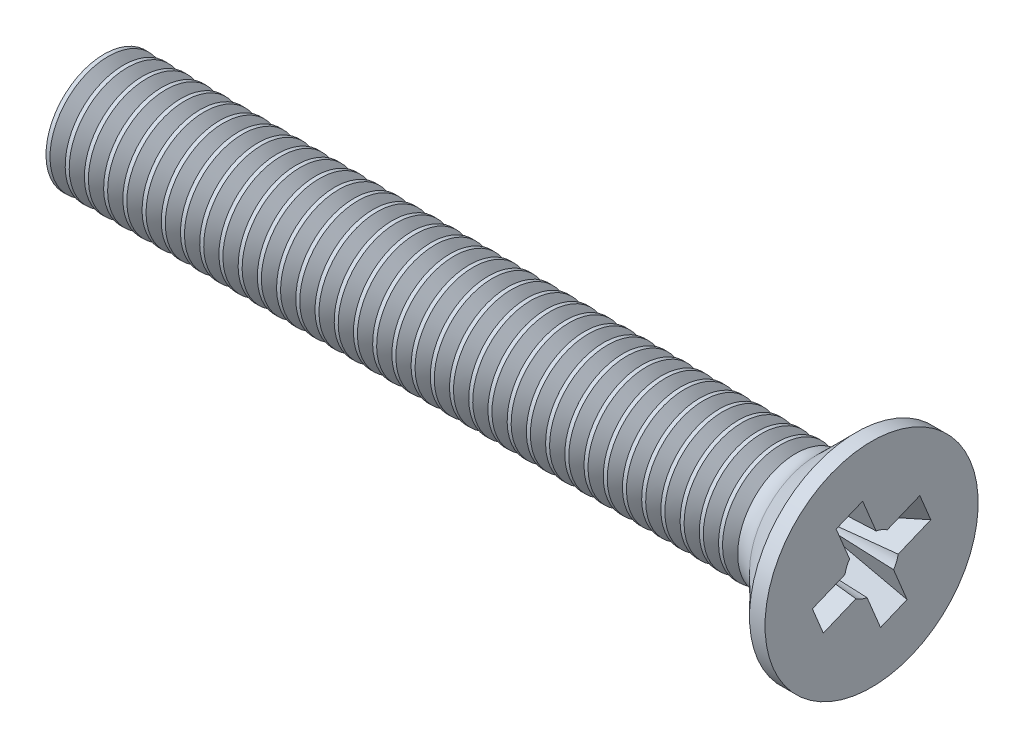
ISO-10303-21;
HEADER;
FILE_DESCRIPTION(('STEP AP214'),'2;1');
FILE_NAME('part.step','',(''),(''),'','','');
FILE_SCHEMA(('AUTOMOTIVE_DESIGN { 1 0 10303 214 1 1 1 1 }'));
ENDSEC;
DATA;
#1=APPLICATION_CONTEXT('core data for automotive mechanical design processes');
#2=APPLICATION_PROTOCOL_DEFINITION('international standard','automotive_design',2000,#1);
#3=PRODUCT_CONTEXT('',#1,'mechanical');
#4=PRODUCT('Part','Part','',(#3));
#5=PRODUCT_RELATED_PRODUCT_CATEGORY('part','',(#4));
#6=PRODUCT_DEFINITION_FORMATION('','',#4);
#7=PRODUCT_DEFINITION_CONTEXT('part definition',#1,'design');
#8=PRODUCT_DEFINITION('design','',#6,#7);
#9=PRODUCT_DEFINITION_SHAPE('','',#8);
#10=(LENGTH_UNIT() NAMED_UNIT(*) SI_UNIT(.MILLI.,.METRE.));
#11=(NAMED_UNIT(*) PLANE_ANGLE_UNIT() SI_UNIT($,.RADIAN.));
#12=(NAMED_UNIT(*) SI_UNIT($,.STERADIAN.) SOLID_ANGLE_UNIT());
#13=UNCERTAINTY_MEASURE_WITH_UNIT(LENGTH_MEASURE(1.E-05),#10,'distance_accuracy_value','');
#14=(GEOMETRIC_REPRESENTATION_CONTEXT(3) GLOBAL_UNCERTAINTY_ASSIGNED_CONTEXT((#13)) GLOBAL_UNIT_ASSIGNED_CONTEXT((#10,
#11,#12)) REPRESENTATION_CONTEXT('',''));
#15=CARTESIAN_POINT('',(0.,0.,0.));
#16=DIRECTION('',(0.,0.,1.));
#17=DIRECTION('',(1.,0.,0.));
#18=AXIS2_PLACEMENT_3D('',#15,#16,#17);
#19=CARTESIAN_POINT('',(-37.9599999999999,294.467932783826,145.818842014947));
#20=DIRECTION('',(0.,0.924224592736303,0.381849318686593));
#21=DIRECTION('',(0.,0.381849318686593,-0.924224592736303));
#22=AXIS2_PLACEMENT_3D('',#19,#20,#21);
#23=PLANE('',#22);
#24=DIRECTION('',(0.,-0.381849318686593,0.924224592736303));
#25=VECTOR('',#24,1.);
#26=CARTESIAN_POINT('',(-35.9499999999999,295.230810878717,143.972378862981));
#27=LINE('',#26,#25);
#28=CARTESIAN_POINT('',(-35.9499999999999,294.432685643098,145.904153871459));
#29=VERTEX_POINT('',#28);
#30=CARTESIAN_POINT('',(-35.9499999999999,294.085262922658,146.74505264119));
#31=VERTEX_POINT('',#30);
#32=EDGE_CURVE('E759',#29,#31,#27,.T.);
#33=ORIENTED_EDGE('',*,*,#32,.F.);
#34=CARTESIAN_POINT('',(-34.9394635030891,294.401395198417,145.979888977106));
#35=CARTESIAN_POINT('',(-35.1502939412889,294.407823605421,145.964329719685));
#36=CARTESIAN_POINT('',(-35.3611137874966,294.414303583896,145.948645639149));
#37=CARTESIAN_POINT('',(-35.7827273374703,294.427405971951,145.916932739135));
#38=CARTESIAN_POINT('',(-35.9935210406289,294.434028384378,145.900903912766));
#39=CARTESIAN_POINT('',(-36.4150688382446,294.447454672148,145.868407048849));
#40=CARTESIAN_POINT('',(-36.6258229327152,294.454258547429,145.85193901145));
#41=CARTESIAN_POINT('',(-37.0472736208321,294.468109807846,145.818413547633));
#42=CARTESIAN_POINT('',(-37.2579702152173,294.475157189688,145.801356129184));
#43=CARTESIAN_POINT('',(-37.6241889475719,294.487706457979,145.770981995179));
#44=CARTESIAN_POINT('',(-37.7797293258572,294.493130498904,145.757853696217));
#45=CARTESIAN_POINT('',(-38.0907477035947,294.504228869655,145.730991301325));
#46=CARTESIAN_POINT('',(-38.246225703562,294.50990319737,145.717257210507));
#47=CARTESIAN_POINT('',(-38.557101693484,294.52160018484,145.688945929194));
#48=CARTESIAN_POINT('',(-38.7124996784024,294.527622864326,145.67436869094));
#49=CARTESIAN_POINT('',(-38.9454907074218,294.537048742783,145.651554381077));
#50=CARTESIAN_POINT('',(-39.0231379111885,294.540256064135,145.64379140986));
#51=CARTESIAN_POINT('',(-39.1783834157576,294.546841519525,145.627852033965));
#52=CARTESIAN_POINT('',(-39.2559817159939,294.550219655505,145.619675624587));
#53=CARTESIAN_POINT('',(-39.3335482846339,294.553703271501,145.611243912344));
#54=B_SPLINE_CURVE_WITH_KNOTS('',3,(#34,#35,#36,#37,#38,#39,#40,#41,#42,#43,#44,#45,#46,#47,#48,
#49,#50,#51,#52,#53),.UNSPECIFIED.,.F.,.F.,(4,2,2,2,2,2,2,2,2,4),(0.,0.634504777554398,
1.26902224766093,1.90353950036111,2.53804817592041,3.00661008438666,3.47516804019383,
3.94375256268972,4.17805198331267,4.41235406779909),.UNSPECIFIED.);
#55=CARTESIAN_POINT('',(-37.9599999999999,294.49956437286,145.742281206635));
#56=VERTEX_POINT('',#55);
#57=EDGE_CURVE('E223',#29,#56,#54,.T.);
#58=ORIENTED_EDGE('',*,*,#57,.T.);
#59=DIRECTION('',(0.,-0.381849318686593,0.924224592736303));
#60=VECTOR('',#59,1.);
#61=CARTESIAN_POINT('',(-37.9599999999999,294.848141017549,144.898589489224));
#62=LINE('',#61,#60);
#63=CARTESIAN_POINT('',(-37.9599999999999,294.467932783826,145.818842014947));
#64=VERTEX_POINT('',#63);
#65=EDGE_CURVE('E783',#56,#64,#62,.T.);
#66=ORIENTED_EDGE('',*,*,#65,.T.);
#67=DIRECTION('',(-0.894934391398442,0.170380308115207,-0.412386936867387));
#68=VECTOR('',#67,1.);
#69=CARTESIAN_POINT('',(-35.9499999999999,294.085262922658,146.74505264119));
#70=LINE('',#69,#68);
#71=EDGE_CURVE('E770',#31,#64,#70,.T.);
#72=ORIENTED_EDGE('',*,*,#71,.F.);
#73=EDGE_LOOP('',(#33,#58,#66,#72));
#74=FACE_BOUND('',#73,.T.);
#75=ADVANCED_FACE('F37',(#74),#23,.T.);
#76=CARTESIAN_POINT('',(-37.9599999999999,294.848141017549,144.898589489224));
#77=VERTEX_POINT('',#76);
#78=CARTESIAN_POINT('',(-37.9599999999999,294.816509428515,144.975150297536));
#79=VERTEX_POINT('',#78);
#80=EDGE_CURVE('E785',#77,#79,#62,.T.);
#81=ORIENTED_EDGE('',*,*,#80,.T.);
#82=CARTESIAN_POINT('',(-34.9394635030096,294.914678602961,144.737542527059));
#83=CARTESIAN_POINT('',(-35.1502939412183,294.908250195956,144.753101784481));
#84=CARTESIAN_POINT('',(-35.3611137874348,294.901770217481,144.768785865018));
#85=CARTESIAN_POINT('',(-35.7827273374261,294.888667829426,144.800498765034));
#86=CARTESIAN_POINT('',(-35.9935210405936,294.882045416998,144.816527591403));
#87=CARTESIAN_POINT('',(-36.4150688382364,294.868619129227,144.849024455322));
#88=CARTESIAN_POINT('',(-36.6258229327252,294.861815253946,144.865492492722));
#89=CARTESIAN_POINT('',(-37.0472736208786,294.847963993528,144.899017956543));
#90=CARTESIAN_POINT('',(-37.257970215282,294.840916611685,144.916075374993));
#91=CARTESIAN_POINT('',(-37.6241889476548,294.828367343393,144.946449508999));
#92=CARTESIAN_POINT('',(-37.7797293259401,294.822943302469,144.959577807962));
#93=CARTESIAN_POINT('',(-38.0907477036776,294.811844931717,144.986440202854));
#94=CARTESIAN_POINT('',(-38.2462257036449,294.806170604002,145.000174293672));
#95=CARTESIAN_POINT('',(-38.5571016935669,294.794473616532,145.028485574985));
#96=CARTESIAN_POINT('',(-38.7124996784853,294.788450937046,145.043062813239));
#97=CARTESIAN_POINT('',(-38.9454907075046,294.779025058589,145.065877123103));
#98=CARTESIAN_POINT('',(-39.0231379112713,294.775817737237,145.07364009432));
#99=CARTESIAN_POINT('',(-39.1783834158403,294.769232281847,145.089579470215));
#100=CARTESIAN_POINT('',(-39.2559817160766,294.765854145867,145.097755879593));
#101=CARTESIAN_POINT('',(-39.3335482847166,294.762370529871,145.106187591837));
#102=B_SPLINE_CURVE_WITH_KNOTS('',3,(#82,#83,#84,#85,#86,#87,#88,#89,#90,#91,#92,#93,#94,#95,
#96,#97,#98,#99,#100,#101),.UNSPECIFIED.,.F.,.F.,(4,2,2,2,2,2,2,2,2,4),(0.,0.634504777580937,
1.26902224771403,1.90353950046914,2.53804817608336,3.00661008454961,3.47516804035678,
3.94375256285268,4.17805198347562,4.41235406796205),.UNSPECIFIED.);
#103=CARTESIAN_POINT('',(-35.9499999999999,294.883388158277,144.813277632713));
#104=VERTEX_POINT('',#103);
#105=EDGE_CURVE('E216',#79,#104,#102,.F.);
#106=ORIENTED_EDGE('',*,*,#105,.T.);
#107=CARTESIAN_POINT('',(-35.9499999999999,295.230810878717,143.972378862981));
#108=VERTEX_POINT('',#107);
#109=EDGE_CURVE('E761',#108,#104,#27,.T.);
#110=ORIENTED_EDGE('',*,*,#109,.F.);
#111=DIRECTION('',(-0.894934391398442,-0.170380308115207,0.412386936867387));
#112=VECTOR('',#111,1.);
#113=CARTESIAN_POINT('',(-35.9499999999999,295.230810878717,143.972378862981));
#114=LINE('',#113,#112);
#115=EDGE_CURVE('E61',#108,#77,#114,.T.);
#116=ORIENTED_EDGE('',*,*,#115,.T.);
#117=EDGE_LOOP('',(#81,#106,#110,#116));
#118=FACE_BOUND('',#117,.T.);
#119=ADVANCED_FACE('F198',(#118),#23,.T.);
#120=CARTESIAN_POINT('',(-37.9599999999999,295.532067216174,145.181157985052));
#121=DIRECTION('',(0.,-0.924224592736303,-0.381849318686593));
#122=DIRECTION('',(-1.,0.,0.));
#123=AXIS2_PLACEMENT_3D('',#120,#121,#122);
#124=PLANE('',#123);
#125=DIRECTION('',(0.,0.381849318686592,-0.924224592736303));
#126=VECTOR('',#125,1.);
#127=CARTESIAN_POINT('',(-37.9599999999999,295.151858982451,146.101410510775));
#128=LINE('',#127,#126);
#129=CARTESIAN_POINT('',(-37.9599999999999,295.151858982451,146.101410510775));
#130=VERTEX_POINT('',#129);
#131=CARTESIAN_POINT('',(-37.9599999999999,295.183490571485,146.024849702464));
#132=VERTEX_POINT('',#131);
#133=EDGE_CURVE('E790',#130,#132,#128,.T.);
#134=ORIENTED_EDGE('',*,*,#133,.T.);
#135=CARTESIAN_POINT('',(-34.9394635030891,295.085321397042,146.262457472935));
#136=CARTESIAN_POINT('',(-35.1502939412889,295.091749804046,146.246898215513));
#137=CARTESIAN_POINT('',(-35.3611137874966,295.098229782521,146.231214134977));
#138=CARTESIAN_POINT('',(-35.7827273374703,295.111332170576,146.199501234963));
#139=CARTESIAN_POINT('',(-35.9935210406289,295.117954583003,146.183472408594));
#140=CARTESIAN_POINT('',(-36.4150688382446,295.131380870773,146.150975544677));
#141=CARTESIAN_POINT('',(-36.6258229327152,295.138184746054,146.134507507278));
#142=CARTESIAN_POINT('',(-37.0472736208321,295.152036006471,146.100982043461));
#143=CARTESIAN_POINT('',(-37.2579702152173,295.159083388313,146.083924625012));
#144=CARTESIAN_POINT('',(-37.6241889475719,295.171632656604,146.053550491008));
#145=CARTESIAN_POINT('',(-37.7797293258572,295.177056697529,146.040422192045));
#146=CARTESIAN_POINT('',(-38.0907477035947,295.18815506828,146.013559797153));
#147=CARTESIAN_POINT('',(-38.246225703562,295.193829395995,145.999825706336));
#148=CARTESIAN_POINT('',(-38.557101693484,295.205526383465,145.971514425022));
#149=CARTESIAN_POINT('',(-38.7124996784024,295.211549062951,145.956937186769));
#150=CARTESIAN_POINT('',(-38.9454907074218,295.220974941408,145.934122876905));
#151=CARTESIAN_POINT('',(-39.0231379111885,295.22418226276,145.926359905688));
#152=CARTESIAN_POINT('',(-39.1783834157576,295.23076771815,145.910420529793));
#153=CARTESIAN_POINT('',(-39.2559817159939,295.234145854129,145.902244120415));
#154=CARTESIAN_POINT('',(-39.3335482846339,295.237629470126,145.893812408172));
#155=B_SPLINE_CURVE_WITH_KNOTS('',3,(#135,#136,#137,#138,#139,#140,#141,#142,#143,#144,#145,
#146,#147,#148,#149,#150,#151,#152,#153,#154),.UNSPECIFIED.,.F.,.F.,(4,2,2,2,2,2,2,2,2,4),(0.,
0.634504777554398,1.26902224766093,1.90353950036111,2.53804817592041,3.00661008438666,
3.47516804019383,3.94375256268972,4.17805198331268,4.41235406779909),.UNSPECIFIED.);
#156=CARTESIAN_POINT('',(-35.9499999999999,295.116611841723,146.186722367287));
#157=VERTEX_POINT('',#156);
#158=EDGE_CURVE('E279',#132,#157,#155,.F.);
#159=ORIENTED_EDGE('',*,*,#158,.T.);
#160=DIRECTION('',(0.,0.381849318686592,-0.924224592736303));
#161=VECTOR('',#160,1.);
#162=CARTESIAN_POINT('',(-35.9499999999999,294.769189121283,147.027621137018));
#163=LINE('',#162,#161);
#164=CARTESIAN_POINT('',(-35.9499999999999,294.769189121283,147.027621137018));
#165=VERTEX_POINT('',#164);
#166=EDGE_CURVE('E760',#165,#157,#163,.T.);
#167=ORIENTED_EDGE('',*,*,#166,.F.);
#168=DIRECTION('',(-0.894934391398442,0.170380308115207,-0.412386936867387));
#169=VECTOR('',#168,1.);
#170=CARTESIAN_POINT('',(-35.9499999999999,294.769189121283,147.027621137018));
#171=LINE('',#170,#169);
#172=EDGE_CURVE('E773',#165,#130,#171,.T.);
#173=ORIENTED_EDGE('',*,*,#172,.T.);
#174=EDGE_LOOP('',(#134,#159,#167,#173));
#175=FACE_BOUND('',#174,.T.);
#176=ADVANCED_FACE('F204',(#175),#124,.T.);
#177=CARTESIAN_POINT('',(-35.9499999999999,295.567314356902,145.095846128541));
#178=VERTEX_POINT('',#177);
#179=CARTESIAN_POINT('',(-35.9499999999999,295.914737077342,144.254947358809));
#180=VERTEX_POINT('',#179);
#181=EDGE_CURVE('E769',#178,#180,#163,.T.);
#182=ORIENTED_EDGE('',*,*,#181,.F.);
#183=CARTESIAN_POINT('',(-34.9394635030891,295.598604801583,145.020111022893));
#184=CARTESIAN_POINT('',(-35.1502939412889,295.592176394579,145.035670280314));
#185=CARTESIAN_POINT('',(-35.3611137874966,295.585696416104,145.05135436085));
#186=CARTESIAN_POINT('',(-35.7827273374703,295.572594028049,145.083067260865));
#187=CARTESIAN_POINT('',(-35.9935210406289,295.565971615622,145.099096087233));
#188=CARTESIAN_POINT('',(-36.4150688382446,295.552545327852,145.131592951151));
#189=CARTESIAN_POINT('',(-36.6258229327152,295.545741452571,145.14806098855));
#190=CARTESIAN_POINT('',(-37.0472736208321,295.531890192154,145.181586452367));
#191=CARTESIAN_POINT('',(-37.2579702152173,295.524842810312,145.198643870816));
#192=CARTESIAN_POINT('',(-37.6241889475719,295.512293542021,145.22901800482));
#193=CARTESIAN_POINT('',(-37.7797293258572,295.506869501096,145.242146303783));
#194=CARTESIAN_POINT('',(-38.0907477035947,295.495771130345,145.269008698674));
#195=CARTESIAN_POINT('',(-38.2462257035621,295.49009680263,145.282742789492));
#196=CARTESIAN_POINT('',(-38.5571016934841,295.47839981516,145.311054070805));
#197=CARTESIAN_POINT('',(-38.7124996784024,295.472377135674,145.325631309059));
#198=CARTESIAN_POINT('',(-38.9454907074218,295.462951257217,145.348445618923));
#199=CARTESIAN_POINT('',(-39.0231379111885,295.459743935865,145.35620859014));
#200=CARTESIAN_POINT('',(-39.1783834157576,295.453158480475,145.372147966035));
#201=CARTESIAN_POINT('',(-39.2559817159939,295.449780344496,145.380324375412));
#202=CARTESIAN_POINT('',(-39.3335482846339,295.446296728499,145.388756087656));
#203=B_SPLINE_CURVE_WITH_KNOTS('',3,(#183,#184,#185,#186,#187,#188,#189,#190,#191,#192,#193,
#194,#195,#196,#197,#198,#199,#200,#201,#202),.UNSPECIFIED.,.F.,.F.,(4,2,2,2,2,2,2,2,2,4),(0.,
0.634504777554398,1.26902224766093,1.90353950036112,2.53804817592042,3.00661008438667,
3.47516804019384,3.94375256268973,4.17805198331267,4.4123540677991),.UNSPECIFIED.);
#204=CARTESIAN_POINT('',(-37.9599999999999,295.50043562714,145.257718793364));
#205=VERTEX_POINT('',#204);
#206=EDGE_CURVE('E273',#178,#205,#203,.T.);
#207=ORIENTED_EDGE('',*,*,#206,.T.);
#208=CARTESIAN_POINT('',(-37.9599999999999,295.532067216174,145.181157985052));
#209=VERTEX_POINT('',#208);
#210=EDGE_CURVE('E727',#205,#209,#128,.T.);
#211=ORIENTED_EDGE('',*,*,#210,.T.);
#212=DIRECTION('',(-0.894934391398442,-0.170380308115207,0.412386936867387));
#213=VECTOR('',#212,1.);
#214=CARTESIAN_POINT('',(-35.9499999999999,295.914737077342,144.254947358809));
#215=LINE('',#214,#213);
#216=EDGE_CURVE('E777',#180,#209,#215,.T.);
#217=ORIENTED_EDGE('',*,*,#216,.F.);
#218=EDGE_LOOP('',(#182,#207,#211,#217));
#219=FACE_BOUND('',#218,.T.);
#220=ADVANCED_FACE('F813',(#219),#124,.T.);
#221=CARTESIAN_POINT('',(-37.9599999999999,295.532067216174,145.181157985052));
#222=DIRECTION('',(-1.,0.,0.));
#223=DIRECTION('',(0.,0.924224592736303,0.381849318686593));
#224=AXIS2_PLACEMENT_3D('',#221,#222,#223);
#225=PLANE('',#224);
#226=CARTESIAN_POINT('',(-37.9599999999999,295.,145.5));
#227=DIRECTION('',(1.,0.,0.));
#228=DIRECTION('',(0.,-0.924224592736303,-0.381849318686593));
#229=AXIS2_PLACEMENT_3D('',#226,#227,#228);
#230=CIRCLE('',#229,0.555999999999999);
#231=CARTESIAN_POINT('',(-37.9599999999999,295.365600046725,145.918894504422));
#232=VERTEX_POINT('',#231);
#233=CARTESIAN_POINT('',(-37.9599999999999,295.242281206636,146.00043562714));
#234=VERTEX_POINT('',#233);
#235=EDGE_CURVE('E841',#232,#234,#230,.T.);
#236=ORIENTED_EDGE('',*,*,#235,.F.);
#237=DIRECTION('',(0.,0.381849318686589,-0.924224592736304));
#238=VECTOR('',#237,1.);
#239=CARTESIAN_POINT('',(-37.9599999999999,295.318842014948,146.032067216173));
#240=LINE('',#239,#238);
#241=CARTESIAN_POINT('',(-37.9599999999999,295.318842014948,146.032067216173));
#242=VERTEX_POINT('',#241);
#243=EDGE_CURVE('E744',#242,#232,#240,.T.);
#244=ORIENTED_EDGE('',*,*,#243,.F.);
#245=DIRECTION('',(0.,0.924224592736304,0.38184931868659));
#246=VECTOR('',#245,1.);
#247=CARTESIAN_POINT('',(-37.9599999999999,294.398589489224,145.651858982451));
#248=LINE('',#247,#246);
#249=EDGE_CURVE('E748',#234,#242,#248,.T.);
#250=ORIENTED_EDGE('',*,*,#249,.F.);
#251=EDGE_LOOP('',(#236,#244,#250));
#252=FACE_BOUND('',#251,.T.);
#253=ADVANCED_FACE('F804',(#252),#225,.F.);
#254=CARTESIAN_POINT('',(-37.9599999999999,295.0386862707,146.054652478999));
#255=VERTEX_POINT('',#254);
#256=EDGE_CURVE('E846',#132,#255,#230,.T.);
#257=ORIENTED_EDGE('',*,*,#256,.F.);
#258=ORIENTED_EDGE('',*,*,#133,.F.);
#259=DIRECTION('',(0.,0.924224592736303,0.381849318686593));
#260=VECTOR('',#259,1.);
#261=CARTESIAN_POINT('',(-37.9599999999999,294.467932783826,145.818842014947));
#262=LINE('',#261,#260);
#263=EDGE_CURVE('E788',#255,#130,#262,.T.);
#264=ORIENTED_EDGE('',*,*,#263,.F.);
#265=EDGE_LOOP('',(#257,#258,#264));
#266=FACE_BOUND('',#265,.T.);
#267=ADVANCED_FACE('F812',(#266),#225,.F.);
#268=CARTESIAN_POINT('',(-37.9599999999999,294.581105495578,145.865600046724));
#269=VERTEX_POINT('',#268);
#270=EDGE_CURVE('E851',#269,#56,#230,.T.);
#271=ORIENTED_EDGE('',*,*,#270,.F.);
#272=EDGE_CURVE('E780',#64,#269,#262,.T.);
#273=ORIENTED_EDGE('',*,*,#272,.F.);
#274=ORIENTED_EDGE('',*,*,#65,.F.);
#275=EDGE_LOOP('',(#271,#273,#274));
#276=FACE_BOUND('',#275,.T.);
#277=ADVANCED_FACE('F955',(#276),#225,.F.);
#278=CARTESIAN_POINT('',(-37.9599999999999,294.475150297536,145.683490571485));
#279=VERTEX_POINT('',#278);
#280=CARTESIAN_POINT('',(-37.9599999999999,294.445347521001,145.5386862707));
#281=VERTEX_POINT('',#280);
#282=EDGE_CURVE('E53',#279,#281,#230,.T.);
#283=ORIENTED_EDGE('',*,*,#282,.F.);
#284=CARTESIAN_POINT('',(-37.9599999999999,294.398589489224,145.651858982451));
#285=VERTEX_POINT('',#284);
#286=EDGE_CURVE('E750',#285,#279,#248,.T.);
#287=ORIENTED_EDGE('',*,*,#286,.F.);
#288=DIRECTION('',(0.,-0.381849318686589,0.924224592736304));
#289=VECTOR('',#288,1.);
#290=CARTESIAN_POINT('',(-37.9599999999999,294.681157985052,144.967932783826));
#291=LINE('',#290,#289);
#292=EDGE_CURVE('E749',#281,#285,#291,.T.);
#293=ORIENTED_EDGE('',*,*,#292,.F.);
#294=EDGE_LOOP('',(#283,#287,#293));
#295=FACE_BOUND('',#294,.T.);
#296=ADVANCED_FACE('F857',(#295),#225,.F.);
#297=CARTESIAN_POINT('',(-37.9599999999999,294.634399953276,145.081105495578));
#298=VERTEX_POINT('',#297);
#299=CARTESIAN_POINT('',(-37.9599999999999,294.757718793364,144.99956437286));
#300=VERTEX_POINT('',#299);
#301=EDGE_CURVE('E332',#298,#300,#230,.T.);
#302=ORIENTED_EDGE('',*,*,#301,.F.);
#303=CARTESIAN_POINT('',(-37.9599999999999,294.681157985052,144.967932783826));
#304=VERTEX_POINT('',#303);
#305=EDGE_CURVE('E745',#304,#298,#291,.T.);
#306=ORIENTED_EDGE('',*,*,#305,.F.);
#307=DIRECTION('',(0.,-0.924224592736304,-0.38184931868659));
#308=VECTOR('',#307,1.);
#309=CARTESIAN_POINT('',(-37.9599999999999,295.601410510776,145.348141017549));
#310=LINE('',#309,#308);
#311=EDGE_CURVE('E230',#300,#304,#310,.T.);
#312=ORIENTED_EDGE('',*,*,#311,.F.);
#313=EDGE_LOOP('',(#302,#306,#312));
#314=FACE_BOUND('',#313,.T.);
#315=ADVANCED_FACE('F823',(#314),#225,.F.);
#316=CARTESIAN_POINT('',(-37.9599999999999,294.9613137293,144.945347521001));
#317=VERTEX_POINT('',#316);
#318=EDGE_CURVE('E339',#79,#317,#230,.T.);
#319=ORIENTED_EDGE('',*,*,#318,.F.);
#320=ORIENTED_EDGE('',*,*,#80,.F.);
#321=DIRECTION('',(0.,-0.924224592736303,-0.381849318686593));
#322=VECTOR('',#321,1.);
#323=CARTESIAN_POINT('',(-37.9599999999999,295.532067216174,145.181157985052));
#324=LINE('',#323,#322);
#325=EDGE_CURVE('E784',#317,#77,#324,.T.);
#326=ORIENTED_EDGE('',*,*,#325,.F.);
#327=EDGE_LOOP('',(#319,#320,#326));
#328=FACE_BOUND('',#327,.T.);
#329=ADVANCED_FACE('F816',(#328),#225,.F.);
#330=CARTESIAN_POINT('',(-37.9599999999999,295.418894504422,145.134399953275));
#331=VERTEX_POINT('',#330);
#332=EDGE_CURVE('E828',#331,#205,#230,.T.);
#333=ORIENTED_EDGE('',*,*,#332,.F.);
#334=EDGE_CURVE('E781',#209,#331,#324,.T.);
#335=ORIENTED_EDGE('',*,*,#334,.F.);
#336=ORIENTED_EDGE('',*,*,#210,.F.);
#337=EDGE_LOOP('',(#333,#335,#336));
#338=FACE_BOUND('',#337,.T.);
#339=ADVANCED_FACE('F805',(#338),#225,.F.);
#340=CARTESIAN_POINT('',(-37.9599999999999,295.151858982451,146.101410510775));
#341=DIRECTION('',(0.446197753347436,0.341730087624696,-0.827120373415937));
#342=DIRECTION('',(0.894934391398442,-0.170380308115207,0.412386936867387));
#343=AXIS2_PLACEMENT_3D('',#340,#341,#342);
#344=PLANE('',#343);
#345=ORIENTED_EDGE('',*,*,#272,.T.);
#346=CARTESIAN_POINT('',(-38.8190291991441,294.97344045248,145.564284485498));
#347=DIRECTION('',(0.446197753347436,0.341730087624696,-0.827120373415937));
#348=DIRECTION('',(0.894934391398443,-0.170380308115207,0.412386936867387));
#349=AXIS2_PLACEMENT_3D('',#346,#347,#348);
#350=ELLIPSE('',#349,1.11145971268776,0.491029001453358);
#351=EDGE_CURVE('E291',#269,#255,#350,.F.);
#352=ORIENTED_EDGE('',*,*,#351,.T.);
#353=ORIENTED_EDGE('',*,*,#263,.T.);
#354=ORIENTED_EDGE('',*,*,#172,.F.);
#355=DIRECTION('',(0.,0.924224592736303,0.381849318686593));
#356=VECTOR('',#355,1.);
#357=CARTESIAN_POINT('',(-35.9499999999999,294.085262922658,146.74505264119));
#358=LINE('',#357,#356);
#359=EDGE_CURVE('E764',#31,#165,#358,.T.);
#360=ORIENTED_EDGE('',*,*,#359,.F.);
#361=ORIENTED_EDGE('',*,*,#71,.T.);
#362=EDGE_LOOP('',(#345,#352,#353,#354,#360,#361));
#363=FACE_BOUND('',#362,.T.);
#364=ADVANCED_FACE('F210',(#363),#344,.T.);
#365=CARTESIAN_POINT('',(-37.9599999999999,294.848141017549,144.898589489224));
#366=DIRECTION('',(0.446197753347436,-0.341730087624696,0.827120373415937));
#367=DIRECTION('',(-0.894934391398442,-0.170380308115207,0.412386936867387));
#368=AXIS2_PLACEMENT_3D('',#365,#366,#367);
#369=PLANE('',#368);
#370=ORIENTED_EDGE('',*,*,#334,.T.);
#371=CARTESIAN_POINT('',(-38.8190291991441,295.02655954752,145.435715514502));
#372=DIRECTION('',(0.446197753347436,-0.341730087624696,0.827120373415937));
#373=DIRECTION('',(0.894934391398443,0.170380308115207,-0.412386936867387));
#374=AXIS2_PLACEMENT_3D('',#371,#372,#373);
#375=ELLIPSE('',#374,1.11145971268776,0.491029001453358);
#376=EDGE_CURVE('E296',#331,#317,#375,.F.);
#377=ORIENTED_EDGE('',*,*,#376,.T.);
#378=ORIENTED_EDGE('',*,*,#325,.T.);
#379=ORIENTED_EDGE('',*,*,#115,.F.);
#380=DIRECTION('',(0.,-0.924224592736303,-0.381849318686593));
#381=VECTOR('',#380,1.);
#382=CARTESIAN_POINT('',(-35.9499999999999,295.914737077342,144.254947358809));
#383=LINE('',#382,#381);
#384=EDGE_CURVE('E756',#180,#108,#383,.T.);
#385=ORIENTED_EDGE('',*,*,#384,.F.);
#386=ORIENTED_EDGE('',*,*,#216,.T.);
#387=EDGE_LOOP('',(#370,#377,#378,#379,#385,#386));
#388=FACE_BOUND('',#387,.T.);
#389=ADVANCED_FACE('F822',(#388),#369,.T.);
#390=CARTESIAN_POINT('',(-37.9599999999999,294.681157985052,144.967932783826));
#391=DIRECTION('',(0.,-0.381849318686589,0.924224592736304));
#392=DIRECTION('',(-1.,0.,0.));
#393=AXIS2_PLACEMENT_3D('',#390,#391,#392);
#394=PLANE('',#393);
#395=CARTESIAN_POINT('',(-37.9599999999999,295.601410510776,145.348141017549));
#396=VERTEX_POINT('',#395);
#397=CARTESIAN_POINT('',(-37.9599999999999,295.524849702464,145.316509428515));
#398=VERTEX_POINT('',#397);
#399=EDGE_CURVE('E754',#396,#398,#310,.T.);
#400=ORIENTED_EDGE('',*,*,#399,.T.);
#401=CARTESIAN_POINT('',(-34.9394635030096,295.762457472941,145.414678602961));
#402=CARTESIAN_POINT('',(-35.1502939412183,295.746898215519,145.408250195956));
#403=CARTESIAN_POINT('',(-35.3611137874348,295.731214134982,145.401770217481));
#404=CARTESIAN_POINT('',(-35.7827273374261,295.699501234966,145.388667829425));
#405=CARTESIAN_POINT('',(-35.9935210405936,295.683472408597,145.382045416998));
#406=CARTESIAN_POINT('',(-36.4150688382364,295.650975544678,145.368619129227));
#407=CARTESIAN_POINT('',(-36.6258229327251,295.634507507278,145.361815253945));
#408=CARTESIAN_POINT('',(-37.0472736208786,295.600982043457,145.347963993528));
#409=CARTESIAN_POINT('',(-37.257970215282,295.583924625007,145.340916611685));
#410=CARTESIAN_POINT('',(-37.6241889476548,295.553550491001,145.328367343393));
#411=CARTESIAN_POINT('',(-37.7797293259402,295.540422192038,145.322943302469));
#412=CARTESIAN_POINT('',(-38.0907477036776,295.513559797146,145.311844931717));
#413=CARTESIAN_POINT('',(-38.2462257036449,295.499825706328,145.306170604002));
#414=CARTESIAN_POINT('',(-38.5571016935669,295.471514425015,145.294473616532));
#415=CARTESIAN_POINT('',(-38.7124996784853,295.456937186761,145.288450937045));
#416=CARTESIAN_POINT('',(-38.9454907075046,295.434122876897,145.279025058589));
#417=CARTESIAN_POINT('',(-39.0231379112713,295.42635990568,145.275817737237));
#418=CARTESIAN_POINT('',(-39.1783834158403,295.410420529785,145.269232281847));
#419=CARTESIAN_POINT('',(-39.2559817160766,295.402244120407,145.265854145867));
#420=CARTESIAN_POINT('',(-39.3335482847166,295.393812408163,145.26237052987));
#421=B_SPLINE_CURVE_WITH_KNOTS('',3,(#401,#402,#403,#404,#405,#406,#407,#408,#409,#410,#411,
#412,#413,#414,#415,#416,#417,#418,#419,#420),.UNSPECIFIED.,.F.,.F.,(4,2,2,2,2,2,2,2,2,4),(0.,
0.63450477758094,1.26902224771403,1.90353950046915,2.53804817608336,3.00661008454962,
3.47516804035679,3.94375256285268,4.17805198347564,4.41235406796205),.UNSPECIFIED.);
#422=CARTESIAN_POINT('',(-35.9499999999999,295.686722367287,145.383388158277));
#423=VERTEX_POINT('',#422);
#424=EDGE_CURVE('E265',#398,#423,#421,.F.);
#425=ORIENTED_EDGE('',*,*,#424,.T.);
#426=DIRECTION('',(0.,-0.924224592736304,-0.38184931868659));
#427=VECTOR('',#426,1.);
#428=CARTESIAN_POINT('',(-35.9499999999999,296.527621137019,145.730810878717));
#429=LINE('',#428,#427);
#430=CARTESIAN_POINT('',(-35.9499999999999,296.527621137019,145.730810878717));
#431=VERTEX_POINT('',#430);
#432=EDGE_CURVE('E730',#431,#423,#429,.T.);
#433=ORIENTED_EDGE('',*,*,#432,.F.);
#434=DIRECTION('',(-0.894934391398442,-0.412386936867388,-0.170380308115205));
#435=VECTOR('',#434,1.);
#436=CARTESIAN_POINT('',(-35.9499999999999,296.527621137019,145.730810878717));
#437=LINE('',#436,#435);
#438=EDGE_CURVE('E736',#431,#396,#437,.T.);
#439=ORIENTED_EDGE('',*,*,#438,.T.);
#440=EDGE_LOOP('',(#400,#425,#433,#439));
#441=FACE_BOUND('',#440,.T.);
#442=ADVANCED_FACE('F888',(#441),#394,.T.);
#443=CARTESIAN_POINT('',(-37.9599999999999,295.318842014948,146.032067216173));
#444=DIRECTION('',(0.,0.381849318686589,-0.924224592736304));
#445=DIRECTION('',(0.,-0.924224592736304,-0.38184931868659));
#446=AXIS2_PLACEMENT_3D('',#443,#444,#445);
#447=PLANE('',#446);
#448=DIRECTION('',(0.,0.924224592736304,0.38184931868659));
#449=VECTOR('',#448,1.);
#450=CARTESIAN_POINT('',(-35.9499999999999,293.472378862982,145.269189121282));
#451=LINE('',#450,#449);
#452=CARTESIAN_POINT('',(-35.9499999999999,295.404153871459,146.067314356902));
#453=VERTEX_POINT('',#452);
#454=CARTESIAN_POINT('',(-35.9499999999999,296.245052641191,146.414737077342));
#455=VERTEX_POINT('',#454);
#456=EDGE_CURVE('E725',#453,#455,#451,.T.);
#457=ORIENTED_EDGE('',*,*,#456,.F.);
#458=CARTESIAN_POINT('',(-34.9394635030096,295.479888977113,146.098604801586));
#459=CARTESIAN_POINT('',(-35.1502939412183,295.464329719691,146.092176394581));
#460=CARTESIAN_POINT('',(-35.3611137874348,295.448645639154,146.085696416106));
#461=CARTESIAN_POINT('',(-35.7827273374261,295.416932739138,146.07259402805));
#462=CARTESIAN_POINT('',(-35.9935210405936,295.400903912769,146.065971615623));
#463=CARTESIAN_POINT('',(-36.4150688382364,295.36840704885,146.052545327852));
#464=CARTESIAN_POINT('',(-36.6258229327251,295.35193901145,146.04574145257));
#465=CARTESIAN_POINT('',(-37.0472736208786,295.318413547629,146.031890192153));
#466=CARTESIAN_POINT('',(-37.257970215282,295.301356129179,146.02484281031));
#467=CARTESIAN_POINT('',(-37.6241889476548,295.270981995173,146.012293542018));
#468=CARTESIAN_POINT('',(-37.7797293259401,295.25785369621,146.006869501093));
#469=CARTESIAN_POINT('',(-38.0907477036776,295.230991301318,145.995771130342));
#470=CARTESIAN_POINT('',(-38.2462257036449,295.2172572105,145.990096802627));
#471=CARTESIAN_POINT('',(-38.5571016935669,295.188945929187,145.978399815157));
#472=CARTESIAN_POINT('',(-38.7124996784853,295.174368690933,145.97237713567));
#473=CARTESIAN_POINT('',(-38.9454907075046,295.151554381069,145.962951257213));
#474=CARTESIAN_POINT('',(-39.0231379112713,295.143791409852,145.959743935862));
#475=CARTESIAN_POINT('',(-39.1783834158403,295.127852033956,145.953158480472));
#476=CARTESIAN_POINT('',(-39.2559817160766,295.119675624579,145.949780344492));
#477=CARTESIAN_POINT('',(-39.3335482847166,295.111243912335,145.946296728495));
#478=B_SPLINE_CURVE_WITH_KNOTS('',3,(#458,#459,#460,#461,#462,#463,#464,#465,#466,#467,#468,
#469,#470,#471,#472,#473,#474,#475,#476,#477),.UNSPECIFIED.,.F.,.F.,(4,2,2,2,2,2,2,2,2,4),(0.,
0.634504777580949,1.26902224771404,1.90353950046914,2.53804817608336,3.00661008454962,
3.47516804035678,3.94375256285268,4.17805198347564,4.41235406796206),.UNSPECIFIED.);
#479=EDGE_CURVE('E258',#453,#234,#478,.T.);
#480=ORIENTED_EDGE('',*,*,#479,.T.);
#481=ORIENTED_EDGE('',*,*,#249,.T.);
#482=DIRECTION('',(-0.894934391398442,-0.412386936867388,-0.170380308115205));
#483=VECTOR('',#482,1.);
#484=CARTESIAN_POINT('',(-35.9499999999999,296.245052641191,146.414737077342));
#485=LINE('',#484,#483);
#486=EDGE_CURVE('E733',#455,#242,#485,.T.);
#487=ORIENTED_EDGE('',*,*,#486,.F.);
#488=EDGE_LOOP('',(#457,#480,#481,#487));
#489=FACE_BOUND('',#488,.T.);
#490=ADVANCED_FACE('F885',(#489),#447,.T.);
#491=CARTESIAN_POINT('',(-37.9599999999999,295.601410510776,145.348141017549));
#492=DIRECTION('',(0.446197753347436,-0.827120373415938,-0.341730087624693));
#493=DIRECTION('',(0.894934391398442,0.412386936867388,0.170380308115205));
#494=AXIS2_PLACEMENT_3D('',#491,#492,#493);
#495=PLANE('',#494);
#496=ORIENTED_EDGE('',*,*,#243,.T.);
#497=CARTESIAN_POINT('',(-38.8190291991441,295.064284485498,145.526559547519));
#498=DIRECTION('',(0.446197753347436,-0.827120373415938,-0.341730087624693));
#499=DIRECTION('',(0.894934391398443,0.412386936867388,0.170380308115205));
#500=AXIS2_PLACEMENT_3D('',#497,#498,#499);
#501=ELLIPSE('',#500,1.11145971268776,0.491029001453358);
#502=CARTESIAN_POINT('',(-37.9599999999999,295.554652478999,145.4613137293));
#503=VERTEX_POINT('',#502);
#504=EDGE_CURVE('E309',#232,#503,#501,.F.);
#505=ORIENTED_EDGE('',*,*,#504,.T.);
#506=EDGE_CURVE('E752',#503,#396,#240,.T.);
#507=ORIENTED_EDGE('',*,*,#506,.T.);
#508=ORIENTED_EDGE('',*,*,#438,.F.);
#509=DIRECTION('',(0.,0.381849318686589,-0.924224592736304));
#510=VECTOR('',#509,1.);
#511=CARTESIAN_POINT('',(-35.9499999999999,296.245052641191,146.414737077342));
#512=LINE('',#511,#510);
#513=EDGE_CURVE('E724',#455,#431,#512,.T.);
#514=ORIENTED_EDGE('',*,*,#513,.F.);
#515=ORIENTED_EDGE('',*,*,#486,.T.);
#516=EDGE_LOOP('',(#496,#505,#507,#508,#514,#515));
#517=FACE_BOUND('',#516,.T.);
#518=ADVANCED_FACE('F235',(#517),#495,.T.);
#519=ORIENTED_EDGE('',*,*,#286,.T.);
#520=CARTESIAN_POINT('',(-34.9394635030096,294.237542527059,145.585321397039));
#521=CARTESIAN_POINT('',(-35.1502939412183,294.253101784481,145.591749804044));
#522=CARTESIAN_POINT('',(-35.3611137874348,294.268785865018,145.598229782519));
#523=CARTESIAN_POINT('',(-35.7827273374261,294.300498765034,145.611332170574));
#524=CARTESIAN_POINT('',(-35.9935210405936,294.316527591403,145.617954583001));
#525=CARTESIAN_POINT('',(-36.4150688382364,294.349024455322,145.631380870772));
#526=CARTESIAN_POINT('',(-36.6258229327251,294.365492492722,145.638184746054));
#527=CARTESIAN_POINT('',(-37.0472736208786,294.399017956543,145.652036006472));
#528=CARTESIAN_POINT('',(-37.257970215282,294.416075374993,145.659083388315));
#529=CARTESIAN_POINT('',(-37.6241889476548,294.446449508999,145.671632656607));
#530=CARTESIAN_POINT('',(-37.7797293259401,294.459577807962,145.677056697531));
#531=CARTESIAN_POINT('',(-38.0907477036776,294.486440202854,145.688155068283));
#532=CARTESIAN_POINT('',(-38.2462257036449,294.500174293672,145.693829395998));
#533=CARTESIAN_POINT('',(-38.5571016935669,294.528485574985,145.705526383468));
#534=CARTESIAN_POINT('',(-38.7124996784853,294.543062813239,145.711549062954));
#535=CARTESIAN_POINT('',(-38.9454907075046,294.565877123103,145.720974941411));
#536=CARTESIAN_POINT('',(-39.0231379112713,294.57364009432,145.724182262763));
#537=CARTESIAN_POINT('',(-39.1783834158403,294.589579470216,145.730767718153));
#538=CARTESIAN_POINT('',(-39.2559817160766,294.597755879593,145.734145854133));
#539=CARTESIAN_POINT('',(-39.3335482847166,294.606187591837,145.737629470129));
#540=B_SPLINE_CURVE_WITH_KNOTS('',3,(#520,#521,#522,#523,#524,#525,#526,#527,#528,#529,#530,
#531,#532,#533,#534,#535,#536,#537,#538,#539),.UNSPECIFIED.,.F.,.F.,(4,2,2,2,2,2,2,2,2,4),(0.,
0.634504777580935,1.26902224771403,1.90353950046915,2.53804817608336,3.00661008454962,
3.47516804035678,3.94375256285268,4.17805198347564,4.41235406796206),.UNSPECIFIED.);
#541=CARTESIAN_POINT('',(-35.9499999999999,294.313277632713,145.616611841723));
#542=VERTEX_POINT('',#541);
#543=EDGE_CURVE('E250',#279,#542,#540,.F.);
#544=ORIENTED_EDGE('',*,*,#543,.T.);
#545=CARTESIAN_POINT('',(-35.9499999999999,293.472378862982,145.269189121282));
#546=VERTEX_POINT('',#545);
#547=EDGE_CURVE('E720',#546,#542,#451,.T.);
#548=ORIENTED_EDGE('',*,*,#547,.F.);
#549=DIRECTION('',(-0.894934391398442,0.412386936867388,0.170380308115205));
#550=VECTOR('',#549,1.);
#551=CARTESIAN_POINT('',(-35.9499999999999,293.472378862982,145.269189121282));
#552=LINE('',#551,#550);
#553=EDGE_CURVE('E739',#546,#285,#552,.T.);
#554=ORIENTED_EDGE('',*,*,#553,.T.);
#555=EDGE_LOOP('',(#519,#544,#548,#554));
#556=FACE_BOUND('',#555,.T.);
#557=ADVANCED_FACE('F858',(#556),#447,.T.);
#558=CARTESIAN_POINT('',(-35.9499999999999,294.595846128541,144.932685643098));
#559=VERTEX_POINT('',#558);
#560=CARTESIAN_POINT('',(-35.9499999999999,293.75494735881,144.585262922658));
#561=VERTEX_POINT('',#560);
#562=EDGE_CURVE('E732',#559,#561,#429,.T.);
#563=ORIENTED_EDGE('',*,*,#562,.F.);
#564=CARTESIAN_POINT('',(-34.9394635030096,294.520111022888,144.901395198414));
#565=CARTESIAN_POINT('',(-35.1502939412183,294.535670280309,144.907823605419));
#566=CARTESIAN_POINT('',(-35.3611137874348,294.551354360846,144.914303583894));
#567=CARTESIAN_POINT('',(-35.7827273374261,294.583067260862,144.92740597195));
#568=CARTESIAN_POINT('',(-35.9935210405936,294.599096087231,144.934028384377));
#569=CARTESIAN_POINT('',(-36.4150688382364,294.63159295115,144.947454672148));
#570=CARTESIAN_POINT('',(-36.6258229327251,294.64806098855,144.954258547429));
#571=CARTESIAN_POINT('',(-37.0472736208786,294.681586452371,144.968109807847));
#572=CARTESIAN_POINT('',(-37.257970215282,294.698643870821,144.97515718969));
#573=CARTESIAN_POINT('',(-37.6241889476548,294.729018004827,144.987706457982));
#574=CARTESIAN_POINT('',(-37.7797293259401,294.74214630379,144.993130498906));
#575=CARTESIAN_POINT('',(-38.0907477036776,294.769008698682,145.004228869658));
#576=CARTESIAN_POINT('',(-38.2462257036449,294.7827427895,145.009903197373));
#577=CARTESIAN_POINT('',(-38.5571016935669,294.811054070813,145.021600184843));
#578=CARTESIAN_POINT('',(-38.7124996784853,294.825631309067,145.027622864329));
#579=CARTESIAN_POINT('',(-38.9454907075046,294.848445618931,145.037048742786));
#580=CARTESIAN_POINT('',(-39.0231379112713,294.856208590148,145.040256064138));
#581=CARTESIAN_POINT('',(-39.1783834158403,294.872147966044,145.046841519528));
#582=CARTESIAN_POINT('',(-39.2559817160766,294.880324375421,145.050219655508));
#583=CARTESIAN_POINT('',(-39.3335482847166,294.888756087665,145.053703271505));
#584=B_SPLINE_CURVE_WITH_KNOTS('',3,(#564,#565,#566,#567,#568,#569,#570,#571,#572,#573,#574,
#575,#576,#577,#578,#579,#580,#581,#582,#583),.UNSPECIFIED.,.F.,.F.,(4,2,2,2,2,2,2,2,2,4),(0.,
0.634504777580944,1.26902224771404,1.90353950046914,2.53804817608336,3.00661008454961,
3.47516804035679,3.94375256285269,4.17805198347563,4.41235406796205),.UNSPECIFIED.);
#585=EDGE_CURVE('E240',#559,#300,#584,.T.);
#586=ORIENTED_EDGE('',*,*,#585,.T.);
#587=ORIENTED_EDGE('',*,*,#311,.T.);
#588=DIRECTION('',(-0.894934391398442,0.412386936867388,0.170380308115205));
#589=VECTOR('',#588,1.);
#590=CARTESIAN_POINT('',(-35.9499999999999,293.75494735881,144.585262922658));
#591=LINE('',#590,#589);
#592=EDGE_CURVE('E741',#561,#304,#591,.T.);
#593=ORIENTED_EDGE('',*,*,#592,.F.);
#594=EDGE_LOOP('',(#563,#586,#587,#593));
#595=FACE_BOUND('',#594,.T.);
#596=ADVANCED_FACE('F713',(#595),#394,.T.);
#597=CARTESIAN_POINT('',(-37.9599999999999,294.398589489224,145.651858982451));
#598=DIRECTION('',(0.446197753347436,0.827120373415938,0.341730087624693));
#599=DIRECTION('',(-0.894934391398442,0.412386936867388,0.170380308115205));
#600=AXIS2_PLACEMENT_3D('',#597,#598,#599);
#601=PLANE('',#600);
#602=ORIENTED_EDGE('',*,*,#305,.T.);
#603=CARTESIAN_POINT('',(-38.8190291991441,294.935715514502,145.47344045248));
#604=DIRECTION('',(0.446197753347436,0.827120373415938,0.341730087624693));
#605=DIRECTION('',(0.894934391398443,-0.412386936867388,-0.170380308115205));
#606=AXIS2_PLACEMENT_3D('',#603,#604,#605);
#607=ELLIPSE('',#606,1.11145971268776,0.491029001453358);
#608=EDGE_CURVE('E11',#298,#281,#607,.F.);
#609=ORIENTED_EDGE('',*,*,#608,.T.);
#610=ORIENTED_EDGE('',*,*,#292,.T.);
#611=ORIENTED_EDGE('',*,*,#553,.F.);
#612=DIRECTION('',(0.,-0.381849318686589,0.924224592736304));
#613=VECTOR('',#612,1.);
#614=CARTESIAN_POINT('',(-35.9499999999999,293.75494735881,144.585262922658));
#615=LINE('',#614,#613);
#616=EDGE_CURVE('E231',#561,#546,#615,.T.);
#617=ORIENTED_EDGE('',*,*,#616,.F.);
#618=ORIENTED_EDGE('',*,*,#592,.T.);
#619=EDGE_LOOP('',(#602,#609,#610,#611,#617,#618));
#620=FACE_BOUND('',#619,.T.);
#621=ADVANCED_FACE('F708',(#620),#601,.T.);
#622=CARTESIAN_POINT('',(-35.9499999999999,295.,145.5));
#623=DIRECTION('',(1.,0.,0.));
#624=DIRECTION('',(0.,-0.924224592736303,-0.381849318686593));
#625=AXIS2_PLACEMENT_3D('',#622,#623,#624);
#626=PLANE('',#625);
#627=CARTESIAN_POINT('',(-35.9499999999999,295.,145.5));
#628=DIRECTION('',(1.,0.,0.));
#629=DIRECTION('',(0.,-0.924224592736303,-0.381849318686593));
#630=AXIS2_PLACEMENT_3D('',#627,#628,#629);
#631=CIRCLE('',#630,2.75);
#632=CARTESIAN_POINT('',(-35.9499999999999,292.458382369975,144.449914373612));
#633=VERTEX_POINT('',#632);
#634=EDGE_CURVE('E718',#633,#633,#631,.T.);
#635=ORIENTED_EDGE('',*,*,#634,.T.);
#636=EDGE_LOOP('',(#635));
#637=FACE_BOUND('',#636,.T.);
#638=ORIENTED_EDGE('',*,*,#547,.T.);
#639=CARTESIAN_POINT('',(-35.9499999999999,295.,145.5));
#640=DIRECTION('',(1.,0.,0.));
#641=DIRECTION('',(0.,-0.924224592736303,-0.381849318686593));
#642=AXIS2_PLACEMENT_3D('',#639,#640,#641);
#643=CIRCLE('',#642,0.696552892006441);
#644=EDGE_CURVE('E327',#29,#542,#643,.T.);
#645=ORIENTED_EDGE('',*,*,#644,.F.);
#646=ORIENTED_EDGE('',*,*,#32,.T.);
#647=ORIENTED_EDGE('',*,*,#359,.T.);
#648=ORIENTED_EDGE('',*,*,#166,.T.);
#649=EDGE_CURVE('E330',#453,#157,#643,.T.);
#650=ORIENTED_EDGE('',*,*,#649,.F.);
#651=ORIENTED_EDGE('',*,*,#456,.T.);
#652=ORIENTED_EDGE('',*,*,#513,.T.);
#653=ORIENTED_EDGE('',*,*,#432,.T.);
#654=EDGE_CURVE('E326',#178,#423,#643,.T.);
#655=ORIENTED_EDGE('',*,*,#654,.F.);
#656=ORIENTED_EDGE('',*,*,#181,.T.);
#657=ORIENTED_EDGE('',*,*,#384,.T.);
#658=ORIENTED_EDGE('',*,*,#109,.T.);
#659=EDGE_CURVE('E322',#559,#104,#643,.T.);
#660=ORIENTED_EDGE('',*,*,#659,.F.);
#661=ORIENTED_EDGE('',*,*,#562,.T.);
#662=ORIENTED_EDGE('',*,*,#616,.T.);
#663=EDGE_LOOP('',(#638,#645,#646,#647,#648,#650,#651,#652,#653,#655,#656,#657,#658,#660,#661,#662));
#664=FACE_BOUND('',#663,.T.);
#665=ADVANCED_FACE('F705',(#637,#664),#626,.T.);
#666=CARTESIAN_POINT('',(-29.5999999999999,295.,145.5));
#667=DIRECTION('',(1.,0.,0.));
#668=DIRECTION('',(0.,-0.924224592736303,-0.381849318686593));
#669=AXIS2_PLACEMENT_3D('',#666,#667,#668);
#670=CYLINDRICAL_SURFACE('',#669,2.75);
#671=CARTESIAN_POINT('',(-36.3499999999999,295.,145.5));
#672=DIRECTION('',(1.,0.,0.));
#673=DIRECTION('',(0.,-0.924224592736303,-0.381849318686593));
#674=AXIS2_PLACEMENT_3D('',#671,#672,#673);
#675=CIRCLE('',#674,2.75);
#676=CARTESIAN_POINT('',(-36.3499999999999,292.458382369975,144.449914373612));
#677=VERTEX_POINT('',#676);
#678=EDGE_CURVE('E767',#677,#677,#675,.T.);
#679=ORIENTED_EDGE('',*,*,#678,.T.);
#680=EDGE_LOOP('',(#679));
#681=FACE_BOUND('',#680,.T.);
#682=ORIENTED_EDGE('',*,*,#634,.F.);
#683=EDGE_LOOP('',(#682));
#684=FACE_BOUND('',#683,.T.);
#685=ADVANCED_FACE('F702',(#681,#684),#670,.T.);
#686=CARTESIAN_POINT('',(-36.3499999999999,295.,145.5));
#687=DIRECTION('',(1.,0.,0.));
#688=DIRECTION('',(0.,-0.924224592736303,-0.381849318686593));
#689=AXIS2_PLACEMENT_3D('',#686,#687,#688);
#690=CONICAL_SURFACE('',#689,2.75,0.78539816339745);
#691=CARTESIAN_POINT('',(-37.3656854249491,295.,145.5));
#692=DIRECTION('',(1.,0.,0.));
#693=DIRECTION('',(0.,-0.924224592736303,-0.381849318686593));
#694=AXIS2_PLACEMENT_3D('',#691,#692,#693);
#695=CIRCLE('',#694,1.73431457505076);
#696=CARTESIAN_POINT('',(-37.3656854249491,293.397103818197,144.837753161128));
#697=VERTEX_POINT('',#696);
#698=EDGE_CURVE('E46',#697,#697,#695,.T.);
#699=ORIENTED_EDGE('',*,*,#698,.T.);
#700=EDGE_LOOP('',(#699));
#701=FACE_BOUND('',#700,.T.);
#702=ORIENTED_EDGE('',*,*,#678,.F.);
#703=EDGE_LOOP('',(#702));
#704=FACE_BOUND('',#703,.T.);
#705=ADVANCED_FACE('F699',(#701,#704),#690,.T.);
#706=CARTESIAN_POINT('',(-37.9313708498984,295.,145.5));
#707=DIRECTION('',(1.,0.,0.));
#708=DIRECTION('',(0.,-0.924224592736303,-0.381849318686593));
#709=AXIS2_PLACEMENT_3D('',#706,#707,#708);
#710=TOROIDAL_SURFACE('',#709,2.3,0.8);
#711=CARTESIAN_POINT('',(-37.9035927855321,295.,145.5));
#712=DIRECTION('',(-1.,0.,0.));
#713=DIRECTION('',(0.,0.381849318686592,-0.924224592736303));
#714=AXIS2_PLACEMENT_3D('',#711,#712,#713);
#715=CIRCLE('',#714,1.50048240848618);
#716=CARTESIAN_POINT('',(-37.9035927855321,295.572958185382,144.113217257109));
#717=VERTEX_POINT('',#716);
#718=EDGE_CURVE('E41',#717,#717,#715,.F.);
#719=ORIENTED_EDGE('',*,*,#718,.T.);
#720=EDGE_LOOP('',(#719));
#721=FACE_BOUND('',#720,.T.);
#722=ORIENTED_EDGE('',*,*,#698,.F.);
#723=EDGE_LOOP('',(#722));
#724=FACE_BOUND('',#723,.T.);
#725=ADVANCED_FACE('F39',(#721,#724),#710,.F.);
#726=EDGE_CURVE('E838',#398,#503,#230,.T.);
#727=ORIENTED_EDGE('',*,*,#726,.F.);
#728=ORIENTED_EDGE('',*,*,#399,.F.);
#729=ORIENTED_EDGE('',*,*,#506,.F.);
#730=EDGE_LOOP('',(#727,#728,#729));
#731=FACE_BOUND('',#730,.T.);
#732=ADVANCED_FACE('F691',(#731),#225,.F.);
#733=CARTESIAN_POINT('',(-37.9599999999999,295.,145.5));
#734=DIRECTION('',(1.,0.,0.));
#735=DIRECTION('',(0.,-0.924224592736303,-0.381849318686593));
#736=AXIS2_PLACEMENT_3D('',#733,#734,#735);
#737=CONICAL_SURFACE('',#736,0.555999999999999,0.0698131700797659);
#738=ORIENTED_EDGE('',*,*,#644,.T.);
#739=ORIENTED_EDGE('',*,*,#543,.F.);
#740=EDGE_CURVE('E341',#56,#279,#230,.T.);
#741=ORIENTED_EDGE('',*,*,#740,.F.);
#742=ORIENTED_EDGE('',*,*,#57,.F.);
#743=EDGE_LOOP('',(#738,#739,#741,#742));
#744=FACE_BOUND('',#743,.T.);
#745=ADVANCED_FACE('F194',(#744),#737,.F.);
#746=EDGE_CURVE('E335',#300,#79,#230,.T.);
#747=ORIENTED_EDGE('',*,*,#746,.F.);
#748=ORIENTED_EDGE('',*,*,#585,.F.);
#749=ORIENTED_EDGE('',*,*,#659,.T.);
#750=ORIENTED_EDGE('',*,*,#105,.F.);
#751=EDGE_LOOP('',(#747,#748,#749,#750));
#752=FACE_BOUND('',#751,.T.);
#753=ADVANCED_FACE('F809',(#752),#737,.F.);
#754=EDGE_CURVE('E844',#234,#132,#230,.T.);
#755=ORIENTED_EDGE('',*,*,#754,.F.);
#756=ORIENTED_EDGE('',*,*,#479,.F.);
#757=ORIENTED_EDGE('',*,*,#649,.T.);
#758=ORIENTED_EDGE('',*,*,#158,.F.);
#759=EDGE_LOOP('',(#755,#756,#757,#758));
#760=FACE_BOUND('',#759,.T.);
#761=ADVANCED_FACE('F874',(#760),#737,.F.);
#762=ORIENTED_EDGE('',*,*,#654,.T.);
#763=ORIENTED_EDGE('',*,*,#424,.F.);
#764=EDGE_CURVE('E832',#205,#398,#230,.T.);
#765=ORIENTED_EDGE('',*,*,#764,.F.);
#766=ORIENTED_EDGE('',*,*,#206,.F.);
#767=EDGE_LOOP('',(#762,#763,#765,#766));
#768=FACE_BOUND('',#767,.T.);
#769=ADVANCED_FACE('F836',(#768),#737,.F.);
#770=EDGE_CURVE('E831',#317,#331,#230,.T.);
#771=ORIENTED_EDGE('',*,*,#770,.F.);
#772=ORIENTED_EDGE('',*,*,#376,.F.);
#773=EDGE_LOOP('',(#771,#772));
#774=FACE_BOUND('',#773,.T.);
#775=ADVANCED_FACE('F866',(#774),#737,.F.);
#776=EDGE_CURVE('E849',#255,#269,#230,.T.);
#777=ORIENTED_EDGE('',*,*,#776,.F.);
#778=ORIENTED_EDGE('',*,*,#351,.F.);
#779=EDGE_LOOP('',(#777,#778));
#780=FACE_BOUND('',#779,.T.);
#781=ADVANCED_FACE('F868',(#780),#737,.F.);
#782=EDGE_CURVE('E839',#503,#232,#230,.T.);
#783=ORIENTED_EDGE('',*,*,#782,.F.);
#784=ORIENTED_EDGE('',*,*,#504,.F.);
#785=EDGE_LOOP('',(#783,#784));
#786=FACE_BOUND('',#785,.T.);
#787=ADVANCED_FACE('F191',(#786),#737,.F.);
#788=EDGE_CURVE('E336',#281,#298,#230,.T.);
#789=ORIENTED_EDGE('',*,*,#788,.F.);
#790=ORIENTED_EDGE('',*,*,#608,.F.);
#791=EDGE_LOOP('',(#789,#790));
#792=FACE_BOUND('',#791,.T.);
#793=ADVANCED_FACE('F182',(#792),#737,.F.);
#794=CARTESIAN_POINT('',(-38.1406553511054,295.,145.5));
#795=DIRECTION('',(1.,0.,0.));
#796=DIRECTION('',(0.,-0.924224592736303,-0.381849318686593));
#797=AXIS2_PLACEMENT_3D('',#794,#795,#796);
#798=CONICAL_SURFACE('',#797,0.,1.25663706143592);
#799=ORIENTED_EDGE('',*,*,#301,.T.);
#800=ORIENTED_EDGE('',*,*,#746,.T.);
#801=ORIENTED_EDGE('',*,*,#318,.T.);
#802=ORIENTED_EDGE('',*,*,#770,.T.);
#803=ORIENTED_EDGE('',*,*,#332,.T.);
#804=ORIENTED_EDGE('',*,*,#764,.T.);
#805=ORIENTED_EDGE('',*,*,#726,.T.);
#806=ORIENTED_EDGE('',*,*,#782,.T.);
#807=ORIENTED_EDGE('',*,*,#235,.T.);
#808=ORIENTED_EDGE('',*,*,#754,.T.);
#809=ORIENTED_EDGE('',*,*,#256,.T.);
#810=ORIENTED_EDGE('',*,*,#776,.T.);
#811=ORIENTED_EDGE('',*,*,#270,.T.);
#812=ORIENTED_EDGE('',*,*,#740,.T.);
#813=ORIENTED_EDGE('',*,*,#282,.T.);
#814=ORIENTED_EDGE('',*,*,#788,.T.);
#815=EDGE_LOOP('',(#799,#800,#801,#802,#803,#804,#805,#806,#807,#808,#809,#810,#811,#812,#813,#814));
#816=FACE_BOUND('',#815,.T.);
#817=CARTESIAN_POINT('',(-38.1406553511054,295.,145.5));
#818=VERTEX_POINT('',#817);
#819=VERTEX_LOOP('',#818);
#820=FACE_BOUND('',#819,.T.);
#821=ADVANCED_FACE('F179',(#816,#820),#798,.F.);
#822=CARTESIAN_POINT('',(-37.9035927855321,294.284032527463,147.23292111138));
#823=DIRECTION('',(1.,0.,0.));
#824=DIRECTION('',(0.,-0.381849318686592,0.924224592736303));
#825=AXIS2_PLACEMENT_3D('',#822,#823,#824);
#826=PLANE('',#825);
#827=CARTESIAN_POINT('',(-37.9035927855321,295.,145.5));
#828=DIRECTION('',(1.,0.,0.));
#829=DIRECTION('',(0.,-0.381849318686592,0.924224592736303));
#830=AXIS2_PLACEMENT_3D('',#827,#828,#829);
#831=CIRCLE('',#830,1.5);
#832=CARTESIAN_POINT('',(-37.9035927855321,294.42722602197,146.886336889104));
#833=VERTEX_POINT('',#832);
#834=EDGE_CURVE('E347',#833,#833,#831,.T.);
#835=ORIENTED_EDGE('',*,*,#834,.T.);
#836=EDGE_LOOP('',(#835));
#837=FACE_BOUND('',#836,.T.);
#838=ORIENTED_EDGE('',*,*,#718,.F.);
#839=EDGE_LOOP('',(#838));
#840=FACE_BOUND('',#839,.T.);
#841=ADVANCED_FACE('F181',(#837,#840),#826,.F.);
#842=CARTESIAN_POINT('',(-38.2964092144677,295.,145.5));
#843=DIRECTION('',(-1.,0.,0.));
#844=DIRECTION('',(0.,0.381849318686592,-0.924224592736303));
#845=AXIS2_PLACEMENT_3D('',#842,#843,#844);
#846=CONICAL_SURFACE('',#845,1.5,0.959931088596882);
#847=CARTESIAN_POINT('',(-38.1000009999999,295.,145.5));
#848=DIRECTION('',(1.,0.,0.));
#849=DIRECTION('',(0.,-0.381849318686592,0.924224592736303));
#850=AXIS2_PLACEMENT_3D('',#847,#848,#849);
#851=CIRCLE('',#850,1.2195);
#852=CARTESIAN_POINT('',(-38.1000009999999,294.534334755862,146.627091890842));
#853=VERTEX_POINT('',#852);
#854=EDGE_CURVE('E351',#853,#853,#851,.T.);
#855=ORIENTED_EDGE('',*,*,#854,.F.);
#856=EDGE_LOOP('',(#855));
#857=FACE_BOUND('',#856,.T.);
#858=CARTESIAN_POINT('',(-38.2964092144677,295.,145.5));
#859=DIRECTION('',(1.,0.,0.));
#860=DIRECTION('',(0.,-0.381849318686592,0.924224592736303));
#861=AXIS2_PLACEMENT_3D('',#858,#859,#860);
#862=CIRCLE('',#861,1.5);
#863=CARTESIAN_POINT('',(-38.2964092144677,294.42722602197,146.886336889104));
#864=VERTEX_POINT('',#863);
#865=EDGE_CURVE('E343',#864,#864,#862,.T.);
#866=ORIENTED_EDGE('',*,*,#865,.T.);
#867=EDGE_LOOP('',(#866));
#868=FACE_BOUND('',#867,.T.);
#869=ADVANCED_FACE('F188',(#857,#868),#846,.T.);
#870=CARTESIAN_POINT('',(-38.1000009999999,295.,145.5));
#871=DIRECTION('',(1.,0.,0.));
#872=DIRECTION('',(0.,-0.381849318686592,0.924224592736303));
#873=AXIS2_PLACEMENT_3D('',#870,#871,#872);
#874=CONICAL_SURFACE('',#873,1.2195,0.959931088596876);
#875=ORIENTED_EDGE('',*,*,#834,.F.);
#876=EDGE_LOOP('',(#875));
#877=FACE_BOUND('',#876,.T.);
#878=ORIENTED_EDGE('',*,*,#854,.T.);
#879=EDGE_LOOP('',(#878));
#880=FACE_BOUND('',#879,.T.);
#881=ADVANCED_FACE('F696',(#877,#880),#874,.T.);
#882=CARTESIAN_POINT('',(-29.5999999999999,295.,145.5));
#883=DIRECTION('',(1.,0.,0.));
#884=DIRECTION('',(0.,-0.924224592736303,-0.381849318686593));
#885=AXIS2_PLACEMENT_3D('',#882,#883,#884);
#886=CYLINDRICAL_SURFACE('',#885,1.5);
#887=CARTESIAN_POINT('',(-38.3994261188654,295.,145.5));
#888=DIRECTION('',(1.,0.,0.));
#889=DIRECTION('',(0.,-0.381849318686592,0.924224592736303));
#890=AXIS2_PLACEMENT_3D('',#887,#888,#889);
#891=CIRCLE('',#890,1.5);
#892=CARTESIAN_POINT('',(-38.3994261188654,294.42722602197,146.886336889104));
#893=VERTEX_POINT('',#892);
#894=EDGE_CURVE('E359',#893,#893,#891,.T.);
#895=ORIENTED_EDGE('',*,*,#894,.T.);
#896=EDGE_LOOP('',(#895));
#897=FACE_BOUND('',#896,.T.);
#898=ORIENTED_EDGE('',*,*,#865,.F.);
#899=EDGE_LOOP('',(#898));
#900=FACE_BOUND('',#899,.T.);
#901=ADVANCED_FACE('F692',(#897,#900),#886,.T.);
#902=CARTESIAN_POINT('',(-38.7922425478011,295.,145.5));
#903=DIRECTION('',(-1.,0.,0.));
#904=DIRECTION('',(0.,0.381849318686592,-0.924224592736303));
#905=AXIS2_PLACEMENT_3D('',#902,#903,#904);
#906=CONICAL_SURFACE('',#905,1.5,0.959931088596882);
#907=CARTESIAN_POINT('',(-38.5958343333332,295.,145.5));
#908=DIRECTION('',(1.,0.,0.));
#909=DIRECTION('',(0.,-0.381849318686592,0.924224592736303));
#910=AXIS2_PLACEMENT_3D('',#907,#908,#909);
#911=CIRCLE('',#910,1.2195);
#912=CARTESIAN_POINT('',(-38.5958343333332,294.534334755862,146.627091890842));
#913=VERTEX_POINT('',#912);
#914=EDGE_CURVE('E362',#913,#913,#911,.T.);
#915=ORIENTED_EDGE('',*,*,#914,.F.);
#916=EDGE_LOOP('',(#915));
#917=FACE_BOUND('',#916,.T.);
#918=CARTESIAN_POINT('',(-38.7922425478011,295.,145.5));
#919=DIRECTION('',(1.,0.,0.));
#920=DIRECTION('',(0.,-0.381849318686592,0.924224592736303));
#921=AXIS2_PLACEMENT_3D('',#918,#919,#920);
#922=CIRCLE('',#921,1.5);
#923=CARTESIAN_POINT('',(-38.7922425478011,294.42722602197,146.886336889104));
#924=VERTEX_POINT('',#923);
#925=EDGE_CURVE('E356',#924,#924,#922,.T.);
#926=ORIENTED_EDGE('',*,*,#925,.T.);
#927=EDGE_LOOP('',(#926));
#928=FACE_BOUND('',#927,.T.);
#929=ADVANCED_FACE('F695',(#917,#928),#906,.T.);
#930=CARTESIAN_POINT('',(-38.5958343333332,295.,145.5));
#931=DIRECTION('',(1.,0.,0.));
#932=DIRECTION('',(0.,-0.381849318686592,0.924224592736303));
#933=AXIS2_PLACEMENT_3D('',#930,#931,#932);
#934=CONICAL_SURFACE('',#933,1.2195,0.959931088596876);
#935=ORIENTED_EDGE('',*,*,#894,.F.);
#936=EDGE_LOOP('',(#935));
#937=FACE_BOUND('',#936,.T.);
#938=ORIENTED_EDGE('',*,*,#914,.T.);
#939=EDGE_LOOP('',(#938));
#940=FACE_BOUND('',#939,.T.);
#941=ADVANCED_FACE('F1141',(#937,#940),#934,.T.);
#942=CARTESIAN_POINT('',(-38.8952594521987,295.,145.5));
#943=DIRECTION('',(1.,0.,0.));
#944=DIRECTION('',(0.,-0.381849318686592,0.924224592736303));
#945=AXIS2_PLACEMENT_3D('',#942,#943,#944);
#946=CIRCLE('',#945,1.5);
#947=CARTESIAN_POINT('',(-38.8952594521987,294.42722602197,146.886336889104));
#948=VERTEX_POINT('',#947);
#949=EDGE_CURVE('E368',#948,#948,#946,.T.);
#950=ORIENTED_EDGE('',*,*,#949,.T.);
#951=EDGE_LOOP('',(#950));
#952=FACE_BOUND('',#951,.T.);
#953=ORIENTED_EDGE('',*,*,#925,.F.);
#954=EDGE_LOOP('',(#953));
#955=FACE_BOUND('',#954,.T.);
#956=ADVANCED_FACE('F698',(#952,#955),#886,.T.);
#957=CARTESIAN_POINT('',(-39.2880758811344,295.,145.5));
#958=DIRECTION('',(-1.,0.,0.));
#959=DIRECTION('',(0.,0.381849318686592,-0.924224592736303));
#960=AXIS2_PLACEMENT_3D('',#957,#958,#959);
#961=CONICAL_SURFACE('',#960,1.5,0.959931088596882);
#962=CARTESIAN_POINT('',(-39.0916676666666,295.,145.5));
#963=DIRECTION('',(1.,0.,0.));
#964=DIRECTION('',(0.,-0.381849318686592,0.924224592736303));
#965=AXIS2_PLACEMENT_3D('',#962,#963,#964);
#966=CIRCLE('',#965,1.2195);
#967=CARTESIAN_POINT('',(-39.0916676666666,294.534334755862,146.627091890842));
#968=VERTEX_POINT('',#967);
#969=EDGE_CURVE('E371',#968,#968,#966,.T.);
#970=ORIENTED_EDGE('',*,*,#969,.F.);
#971=EDGE_LOOP('',(#970));
#972=FACE_BOUND('',#971,.T.);
#973=CARTESIAN_POINT('',(-39.2880758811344,295.,145.5));
#974=DIRECTION('',(1.,0.,0.));
#975=DIRECTION('',(0.,-0.381849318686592,0.924224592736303));
#976=AXIS2_PLACEMENT_3D('',#973,#974,#975);
#977=CIRCLE('',#976,1.5);
#978=CARTESIAN_POINT('',(-39.2880758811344,294.42722602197,146.886336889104));
#979=VERTEX_POINT('',#978);
#980=EDGE_CURVE('E365',#979,#979,#977,.T.);
#981=ORIENTED_EDGE('',*,*,#980,.T.);
#982=EDGE_LOOP('',(#981));
#983=FACE_BOUND('',#982,.T.);
#984=ADVANCED_FACE('F1158',(#972,#983),#961,.T.);
#985=CARTESIAN_POINT('',(-39.0916676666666,295.,145.5));
#986=DIRECTION('',(1.,0.,0.));
#987=DIRECTION('',(0.,-0.381849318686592,0.924224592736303));
#988=AXIS2_PLACEMENT_3D('',#985,#986,#987);
#989=CONICAL_SURFACE('',#988,1.2195,0.959931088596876);
#990=ORIENTED_EDGE('',*,*,#949,.F.);
#991=EDGE_LOOP('',(#990));
#992=FACE_BOUND('',#991,.T.);
#993=ORIENTED_EDGE('',*,*,#969,.T.);
#994=EDGE_LOOP('',(#993));
#995=FACE_BOUND('',#994,.T.);
#996=ADVANCED_FACE('F1167',(#992,#995),#989,.T.);
#997=CARTESIAN_POINT('',(-39.3910927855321,295.,145.5));
#998=DIRECTION('',(1.,0.,0.));
#999=DIRECTION('',(0.,-0.381849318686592,0.924224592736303));
#1000=AXIS2_PLACEMENT_3D('',#997,#998,#999);
#1001=CIRCLE('',#1000,1.5);
#1002=CARTESIAN_POINT('',(-39.3910927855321,294.42722602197,146.886336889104));
#1003=VERTEX_POINT('',#1002);
#1004=EDGE_CURVE('E377',#1003,#1003,#1001,.T.);
#1005=ORIENTED_EDGE('',*,*,#1004,.T.);
#1006=EDGE_LOOP('',(#1005));
#1007=FACE_BOUND('',#1006,.T.);
#1008=ORIENTED_EDGE('',*,*,#980,.F.);
#1009=EDGE_LOOP('',(#1008));
#1010=FACE_BOUND('',#1009,.T.);
#1011=ADVANCED_FACE('F1160',(#1007,#1010),#886,.T.);
#1012=CARTESIAN_POINT('',(-39.7839092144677,295.,145.5));
#1013=DIRECTION('',(-1.,0.,0.));
#1014=DIRECTION('',(0.,0.381849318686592,-0.924224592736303));
#1015=AXIS2_PLACEMENT_3D('',#1012,#1013,#1014);
#1016=CONICAL_SURFACE('',#1015,1.5,0.959931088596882);
#1017=CARTESIAN_POINT('',(-39.5875009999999,295.,145.5));
#1018=DIRECTION('',(1.,0.,0.));
#1019=DIRECTION('',(0.,-0.381849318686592,0.924224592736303));
#1020=AXIS2_PLACEMENT_3D('',#1017,#1018,#1019);
#1021=CIRCLE('',#1020,1.2195);
#1022=CARTESIAN_POINT('',(-39.5875009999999,294.534334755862,146.627091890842));
#1023=VERTEX_POINT('',#1022);
#1024=EDGE_CURVE('E380',#1023,#1023,#1021,.T.);
#1025=ORIENTED_EDGE('',*,*,#1024,.F.);
#1026=EDGE_LOOP('',(#1025));
#1027=FACE_BOUND('',#1026,.T.);
#1028=CARTESIAN_POINT('',(-39.7839092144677,295.,145.5));
#1029=DIRECTION('',(1.,0.,0.));
#1030=DIRECTION('',(0.,-0.381849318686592,0.924224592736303));
#1031=AXIS2_PLACEMENT_3D('',#1028,#1029,#1030);
#1032=CIRCLE('',#1031,1.5);
#1033=CARTESIAN_POINT('',(-39.7839092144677,294.42722602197,146.886336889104));
#1034=VERTEX_POINT('',#1033);
#1035=EDGE_CURVE('E374',#1034,#1034,#1032,.T.);
#1036=ORIENTED_EDGE('',*,*,#1035,.T.);
#1037=EDGE_LOOP('',(#1036));
#1038=FACE_BOUND('',#1037,.T.);
#1039=ADVANCED_FACE('F1184',(#1027,#1038),#1016,.T.);
#1040=CARTESIAN_POINT('',(-39.5875009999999,295.,145.5));
#1041=DIRECTION('',(1.,0.,0.));
#1042=DIRECTION('',(0.,-0.381849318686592,0.924224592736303));
#1043=AXIS2_PLACEMENT_3D('',#1040,#1041,#1042);
#1044=CONICAL_SURFACE('',#1043,1.2195,0.959931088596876);
#1045=ORIENTED_EDGE('',*,*,#1004,.F.);
#1046=EDGE_LOOP('',(#1045));
#1047=FACE_BOUND('',#1046,.T.);
#1048=ORIENTED_EDGE('',*,*,#1024,.T.);
#1049=EDGE_LOOP('',(#1048));
#1050=FACE_BOUND('',#1049,.T.);
#1051=ADVANCED_FACE('F1193',(#1047,#1050),#1044,.T.);
#1052=CARTESIAN_POINT('',(-39.8869261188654,295.,145.5));
#1053=DIRECTION('',(1.,0.,0.));
#1054=DIRECTION('',(0.,-0.381849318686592,0.924224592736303));
#1055=AXIS2_PLACEMENT_3D('',#1052,#1053,#1054);
#1056=CIRCLE('',#1055,1.5);
#1057=CARTESIAN_POINT('',(-39.8869261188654,294.42722602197,146.886336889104));
#1058=VERTEX_POINT('',#1057);
#1059=EDGE_CURVE('E386',#1058,#1058,#1056,.T.);
#1060=ORIENTED_EDGE('',*,*,#1059,.T.);
#1061=EDGE_LOOP('',(#1060));
#1062=FACE_BOUND('',#1061,.T.);
#1063=ORIENTED_EDGE('',*,*,#1035,.F.);
#1064=EDGE_LOOP('',(#1063));
#1065=FACE_BOUND('',#1064,.T.);
#1066=ADVANCED_FACE('F1186',(#1062,#1065),#886,.T.);
#1067=CARTESIAN_POINT('',(-40.2797425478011,295.,145.5));
#1068=DIRECTION('',(-1.,0.,0.));
#1069=DIRECTION('',(0.,0.381849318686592,-0.924224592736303));
#1070=AXIS2_PLACEMENT_3D('',#1067,#1068,#1069);
#1071=CONICAL_SURFACE('',#1070,1.5,0.959931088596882);
#1072=CARTESIAN_POINT('',(-40.0833343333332,295.,145.5));
#1073=DIRECTION('',(1.,0.,0.));
#1074=DIRECTION('',(0.,-0.381849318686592,0.924224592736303));
#1075=AXIS2_PLACEMENT_3D('',#1072,#1073,#1074);
#1076=CIRCLE('',#1075,1.2195);
#1077=CARTESIAN_POINT('',(-40.0833343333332,294.534334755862,146.627091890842));
#1078=VERTEX_POINT('',#1077);
#1079=EDGE_CURVE('E389',#1078,#1078,#1076,.T.);
#1080=ORIENTED_EDGE('',*,*,#1079,.F.);
#1081=EDGE_LOOP('',(#1080));
#1082=FACE_BOUND('',#1081,.T.);
#1083=CARTESIAN_POINT('',(-40.2797425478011,295.,145.5));
#1084=DIRECTION('',(1.,0.,0.));
#1085=DIRECTION('',(0.,-0.381849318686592,0.924224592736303));
#1086=AXIS2_PLACEMENT_3D('',#1083,#1084,#1085);
#1087=CIRCLE('',#1086,1.5);
#1088=CARTESIAN_POINT('',(-40.2797425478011,294.42722602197,146.886336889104));
#1089=VERTEX_POINT('',#1088);
#1090=EDGE_CURVE('E383',#1089,#1089,#1087,.T.);
#1091=ORIENTED_EDGE('',*,*,#1090,.T.);
#1092=EDGE_LOOP('',(#1091));
#1093=FACE_BOUND('',#1092,.T.);
#1094=ADVANCED_FACE('F1210',(#1082,#1093),#1071,.T.);
#1095=CARTESIAN_POINT('',(-40.0833343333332,295.,145.5));
#1096=DIRECTION('',(1.,0.,0.));
#1097=DIRECTION('',(0.,-0.381849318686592,0.924224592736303));
#1098=AXIS2_PLACEMENT_3D('',#1095,#1096,#1097);
#1099=CONICAL_SURFACE('',#1098,1.2195,0.959931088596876);
#1100=ORIENTED_EDGE('',*,*,#1059,.F.);
#1101=EDGE_LOOP('',(#1100));
#1102=FACE_BOUND('',#1101,.T.);
#1103=ORIENTED_EDGE('',*,*,#1079,.T.);
#1104=EDGE_LOOP('',(#1103));
#1105=FACE_BOUND('',#1104,.T.);
#1106=ADVANCED_FACE('F1219',(#1102,#1105),#1099,.T.);
#1107=CARTESIAN_POINT('',(-40.3827594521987,295.,145.5));
#1108=DIRECTION('',(1.,0.,0.));
#1109=DIRECTION('',(0.,-0.381849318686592,0.924224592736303));
#1110=AXIS2_PLACEMENT_3D('',#1107,#1108,#1109);
#1111=CIRCLE('',#1110,1.5);
#1112=CARTESIAN_POINT('',(-40.3827594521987,294.42722602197,146.886336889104));
#1113=VERTEX_POINT('',#1112);
#1114=EDGE_CURVE('E395',#1113,#1113,#1111,.T.);
#1115=ORIENTED_EDGE('',*,*,#1114,.T.);
#1116=EDGE_LOOP('',(#1115));
#1117=FACE_BOUND('',#1116,.T.);
#1118=ORIENTED_EDGE('',*,*,#1090,.F.);
#1119=EDGE_LOOP('',(#1118));
#1120=FACE_BOUND('',#1119,.T.);
#1121=ADVANCED_FACE('F1212',(#1117,#1120),#886,.T.);
#1122=CARTESIAN_POINT('',(-40.7755758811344,295.,145.5));
#1123=DIRECTION('',(-1.,0.,0.));
#1124=DIRECTION('',(0.,0.381849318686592,-0.924224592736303));
#1125=AXIS2_PLACEMENT_3D('',#1122,#1123,#1124);
#1126=CONICAL_SURFACE('',#1125,1.5,0.959931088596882);
#1127=CARTESIAN_POINT('',(-40.5791676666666,295.,145.5));
#1128=DIRECTION('',(1.,0.,0.));
#1129=DIRECTION('',(0.,-0.381849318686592,0.924224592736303));
#1130=AXIS2_PLACEMENT_3D('',#1127,#1128,#1129);
#1131=CIRCLE('',#1130,1.2195);
#1132=CARTESIAN_POINT('',(-40.5791676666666,294.534334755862,146.627091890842));
#1133=VERTEX_POINT('',#1132);
#1134=EDGE_CURVE('E398',#1133,#1133,#1131,.T.);
#1135=ORIENTED_EDGE('',*,*,#1134,.F.);
#1136=EDGE_LOOP('',(#1135));
#1137=FACE_BOUND('',#1136,.T.);
#1138=CARTESIAN_POINT('',(-40.7755758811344,295.,145.5));
#1139=DIRECTION('',(1.,0.,0.));
#1140=DIRECTION('',(0.,-0.381849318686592,0.924224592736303));
#1141=AXIS2_PLACEMENT_3D('',#1138,#1139,#1140);
#1142=CIRCLE('',#1141,1.5);
#1143=CARTESIAN_POINT('',(-40.7755758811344,294.42722602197,146.886336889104));
#1144=VERTEX_POINT('',#1143);
#1145=EDGE_CURVE('E392',#1144,#1144,#1142,.T.);
#1146=ORIENTED_EDGE('',*,*,#1145,.T.);
#1147=EDGE_LOOP('',(#1146));
#1148=FACE_BOUND('',#1147,.T.);
#1149=ADVANCED_FACE('F1236',(#1137,#1148),#1126,.T.);
#1150=CARTESIAN_POINT('',(-40.5791676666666,295.,145.5));
#1151=DIRECTION('',(1.,0.,0.));
#1152=DIRECTION('',(0.,-0.381849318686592,0.924224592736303));
#1153=AXIS2_PLACEMENT_3D('',#1150,#1151,#1152);
#1154=CONICAL_SURFACE('',#1153,1.2195,0.959931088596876);
#1155=ORIENTED_EDGE('',*,*,#1114,.F.);
#1156=EDGE_LOOP('',(#1155));
#1157=FACE_BOUND('',#1156,.T.);
#1158=ORIENTED_EDGE('',*,*,#1134,.T.);
#1159=EDGE_LOOP('',(#1158));
#1160=FACE_BOUND('',#1159,.T.);
#1161=ADVANCED_FACE('F1245',(#1157,#1160),#1154,.T.);
#1162=CARTESIAN_POINT('',(-40.8785927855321,295.,145.5));
#1163=DIRECTION('',(1.,0.,0.));
#1164=DIRECTION('',(0.,-0.381849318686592,0.924224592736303));
#1165=AXIS2_PLACEMENT_3D('',#1162,#1163,#1164);
#1166=CIRCLE('',#1165,1.5);
#1167=CARTESIAN_POINT('',(-40.8785927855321,294.42722602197,146.886336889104));
#1168=VERTEX_POINT('',#1167);
#1169=EDGE_CURVE('E404',#1168,#1168,#1166,.T.);
#1170=ORIENTED_EDGE('',*,*,#1169,.T.);
#1171=EDGE_LOOP('',(#1170));
#1172=FACE_BOUND('',#1171,.T.);
#1173=ORIENTED_EDGE('',*,*,#1145,.F.);
#1174=EDGE_LOOP('',(#1173));
#1175=FACE_BOUND('',#1174,.T.);
#1176=ADVANCED_FACE('F1238',(#1172,#1175),#886,.T.);
#1177=CARTESIAN_POINT('',(-41.2714092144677,295.,145.5));
#1178=DIRECTION('',(-1.,0.,0.));
#1179=DIRECTION('',(0.,0.381849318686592,-0.924224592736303));
#1180=AXIS2_PLACEMENT_3D('',#1177,#1178,#1179);
#1181=CONICAL_SURFACE('',#1180,1.5,0.959931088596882);
#1182=CARTESIAN_POINT('',(-41.0750009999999,295.,145.5));
#1183=DIRECTION('',(1.,0.,0.));
#1184=DIRECTION('',(0.,-0.381849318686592,0.924224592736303));
#1185=AXIS2_PLACEMENT_3D('',#1182,#1183,#1184);
#1186=CIRCLE('',#1185,1.2195);
#1187=CARTESIAN_POINT('',(-41.0750009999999,294.534334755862,146.627091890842));
#1188=VERTEX_POINT('',#1187);
#1189=EDGE_CURVE('E407',#1188,#1188,#1186,.T.);
#1190=ORIENTED_EDGE('',*,*,#1189,.F.);
#1191=EDGE_LOOP('',(#1190));
#1192=FACE_BOUND('',#1191,.T.);
#1193=CARTESIAN_POINT('',(-41.2714092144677,295.,145.5));
#1194=DIRECTION('',(1.,0.,0.));
#1195=DIRECTION('',(0.,-0.381849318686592,0.924224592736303));
#1196=AXIS2_PLACEMENT_3D('',#1193,#1194,#1195);
#1197=CIRCLE('',#1196,1.5);
#1198=CARTESIAN_POINT('',(-41.2714092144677,294.42722602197,146.886336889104));
#1199=VERTEX_POINT('',#1198);
#1200=EDGE_CURVE('E401',#1199,#1199,#1197,.T.);
#1201=ORIENTED_EDGE('',*,*,#1200,.T.);
#1202=EDGE_LOOP('',(#1201));
#1203=FACE_BOUND('',#1202,.T.);
#1204=ADVANCED_FACE('F1262',(#1192,#1203),#1181,.T.);
#1205=CARTESIAN_POINT('',(-41.0750009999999,295.,145.5));
#1206=DIRECTION('',(1.,0.,0.));
#1207=DIRECTION('',(0.,-0.381849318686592,0.924224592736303));
#1208=AXIS2_PLACEMENT_3D('',#1205,#1206,#1207);
#1209=CONICAL_SURFACE('',#1208,1.2195,0.959931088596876);
#1210=ORIENTED_EDGE('',*,*,#1169,.F.);
#1211=EDGE_LOOP('',(#1210));
#1212=FACE_BOUND('',#1211,.T.);
#1213=ORIENTED_EDGE('',*,*,#1189,.T.);
#1214=EDGE_LOOP('',(#1213));
#1215=FACE_BOUND('',#1214,.T.);
#1216=ADVANCED_FACE('F1271',(#1212,#1215),#1209,.T.);
#1217=CARTESIAN_POINT('',(-41.3744261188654,295.,145.5));
#1218=DIRECTION('',(1.,0.,0.));
#1219=DIRECTION('',(0.,-0.381849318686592,0.924224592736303));
#1220=AXIS2_PLACEMENT_3D('',#1217,#1218,#1219);
#1221=CIRCLE('',#1220,1.5);
#1222=CARTESIAN_POINT('',(-41.3744261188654,294.42722602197,146.886336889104));
#1223=VERTEX_POINT('',#1222);
#1224=EDGE_CURVE('E413',#1223,#1223,#1221,.T.);
#1225=ORIENTED_EDGE('',*,*,#1224,.T.);
#1226=EDGE_LOOP('',(#1225));
#1227=FACE_BOUND('',#1226,.T.);
#1228=ORIENTED_EDGE('',*,*,#1200,.F.);
#1229=EDGE_LOOP('',(#1228));
#1230=FACE_BOUND('',#1229,.T.);
#1231=ADVANCED_FACE('F1264',(#1227,#1230),#886,.T.);
#1232=CARTESIAN_POINT('',(-41.7672425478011,295.,145.5));
#1233=DIRECTION('',(-1.,0.,0.));
#1234=DIRECTION('',(0.,0.381849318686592,-0.924224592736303));
#1235=AXIS2_PLACEMENT_3D('',#1232,#1233,#1234);
#1236=CONICAL_SURFACE('',#1235,1.5,0.959931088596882);
#1237=CARTESIAN_POINT('',(-41.5708343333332,295.,145.5));
#1238=DIRECTION('',(1.,0.,0.));
#1239=DIRECTION('',(0.,-0.381849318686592,0.924224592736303));
#1240=AXIS2_PLACEMENT_3D('',#1237,#1238,#1239);
#1241=CIRCLE('',#1240,1.2195);
#1242=CARTESIAN_POINT('',(-41.5708343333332,294.534334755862,146.627091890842));
#1243=VERTEX_POINT('',#1242);
#1244=EDGE_CURVE('E416',#1243,#1243,#1241,.T.);
#1245=ORIENTED_EDGE('',*,*,#1244,.F.);
#1246=EDGE_LOOP('',(#1245));
#1247=FACE_BOUND('',#1246,.T.);
#1248=CARTESIAN_POINT('',(-41.7672425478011,295.,145.5));
#1249=DIRECTION('',(1.,0.,0.));
#1250=DIRECTION('',(0.,-0.381849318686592,0.924224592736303));
#1251=AXIS2_PLACEMENT_3D('',#1248,#1249,#1250);
#1252=CIRCLE('',#1251,1.5);
#1253=CARTESIAN_POINT('',(-41.7672425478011,294.42722602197,146.886336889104));
#1254=VERTEX_POINT('',#1253);
#1255=EDGE_CURVE('E410',#1254,#1254,#1252,.T.);
#1256=ORIENTED_EDGE('',*,*,#1255,.T.);
#1257=EDGE_LOOP('',(#1256));
#1258=FACE_BOUND('',#1257,.T.);
#1259=ADVANCED_FACE('F1288',(#1247,#1258),#1236,.T.);
#1260=CARTESIAN_POINT('',(-41.5708343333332,295.,145.5));
#1261=DIRECTION('',(1.,0.,0.));
#1262=DIRECTION('',(0.,-0.381849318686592,0.924224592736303));
#1263=AXIS2_PLACEMENT_3D('',#1260,#1261,#1262);
#1264=CONICAL_SURFACE('',#1263,1.2195,0.959931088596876);
#1265=ORIENTED_EDGE('',*,*,#1224,.F.);
#1266=EDGE_LOOP('',(#1265));
#1267=FACE_BOUND('',#1266,.T.);
#1268=ORIENTED_EDGE('',*,*,#1244,.T.);
#1269=EDGE_LOOP('',(#1268));
#1270=FACE_BOUND('',#1269,.T.);
#1271=ADVANCED_FACE('F1297',(#1267,#1270),#1264,.T.);
#1272=CARTESIAN_POINT('',(-41.8702594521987,295.,145.5));
#1273=DIRECTION('',(1.,0.,0.));
#1274=DIRECTION('',(0.,-0.381849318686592,0.924224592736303));
#1275=AXIS2_PLACEMENT_3D('',#1272,#1273,#1274);
#1276=CIRCLE('',#1275,1.5);
#1277=CARTESIAN_POINT('',(-41.8702594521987,294.42722602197,146.886336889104));
#1278=VERTEX_POINT('',#1277);
#1279=EDGE_CURVE('E422',#1278,#1278,#1276,.T.);
#1280=ORIENTED_EDGE('',*,*,#1279,.T.);
#1281=EDGE_LOOP('',(#1280));
#1282=FACE_BOUND('',#1281,.T.);
#1283=ORIENTED_EDGE('',*,*,#1255,.F.);
#1284=EDGE_LOOP('',(#1283));
#1285=FACE_BOUND('',#1284,.T.);
#1286=ADVANCED_FACE('F1290',(#1282,#1285),#886,.T.);
#1287=CARTESIAN_POINT('',(-42.2630758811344,295.,145.5));
#1288=DIRECTION('',(-1.,0.,0.));
#1289=DIRECTION('',(0.,0.381849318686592,-0.924224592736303));
#1290=AXIS2_PLACEMENT_3D('',#1287,#1288,#1289);
#1291=CONICAL_SURFACE('',#1290,1.5,0.959931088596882);
#1292=CARTESIAN_POINT('',(-42.0666676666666,295.,145.5));
#1293=DIRECTION('',(1.,0.,0.));
#1294=DIRECTION('',(0.,-0.381849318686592,0.924224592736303));
#1295=AXIS2_PLACEMENT_3D('',#1292,#1293,#1294);
#1296=CIRCLE('',#1295,1.2195);
#1297=CARTESIAN_POINT('',(-42.0666676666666,294.534334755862,146.627091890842));
#1298=VERTEX_POINT('',#1297);
#1299=EDGE_CURVE('E425',#1298,#1298,#1296,.T.);
#1300=ORIENTED_EDGE('',*,*,#1299,.F.);
#1301=EDGE_LOOP('',(#1300));
#1302=FACE_BOUND('',#1301,.T.);
#1303=CARTESIAN_POINT('',(-42.2630758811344,295.,145.5));
#1304=DIRECTION('',(1.,0.,0.));
#1305=DIRECTION('',(0.,-0.381849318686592,0.924224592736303));
#1306=AXIS2_PLACEMENT_3D('',#1303,#1304,#1305);
#1307=CIRCLE('',#1306,1.5);
#1308=CARTESIAN_POINT('',(-42.2630758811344,294.42722602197,146.886336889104));
#1309=VERTEX_POINT('',#1308);
#1310=EDGE_CURVE('E419',#1309,#1309,#1307,.T.);
#1311=ORIENTED_EDGE('',*,*,#1310,.T.);
#1312=EDGE_LOOP('',(#1311));
#1313=FACE_BOUND('',#1312,.T.);
#1314=ADVANCED_FACE('F1314',(#1302,#1313),#1291,.T.);
#1315=CARTESIAN_POINT('',(-42.0666676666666,295.,145.5));
#1316=DIRECTION('',(1.,0.,0.));
#1317=DIRECTION('',(0.,-0.381849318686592,0.924224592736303));
#1318=AXIS2_PLACEMENT_3D('',#1315,#1316,#1317);
#1319=CONICAL_SURFACE('',#1318,1.2195,0.959931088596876);
#1320=ORIENTED_EDGE('',*,*,#1279,.F.);
#1321=EDGE_LOOP('',(#1320));
#1322=FACE_BOUND('',#1321,.T.);
#1323=ORIENTED_EDGE('',*,*,#1299,.T.);
#1324=EDGE_LOOP('',(#1323));
#1325=FACE_BOUND('',#1324,.T.);
#1326=ADVANCED_FACE('F1323',(#1322,#1325),#1319,.T.);
#1327=CARTESIAN_POINT('',(-42.3660927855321,295.,145.5));
#1328=DIRECTION('',(1.,0.,0.));
#1329=DIRECTION('',(0.,-0.381849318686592,0.924224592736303));
#1330=AXIS2_PLACEMENT_3D('',#1327,#1328,#1329);
#1331=CIRCLE('',#1330,1.5);
#1332=CARTESIAN_POINT('',(-42.3660927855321,294.42722602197,146.886336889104));
#1333=VERTEX_POINT('',#1332);
#1334=EDGE_CURVE('E431',#1333,#1333,#1331,.T.);
#1335=ORIENTED_EDGE('',*,*,#1334,.T.);
#1336=EDGE_LOOP('',(#1335));
#1337=FACE_BOUND('',#1336,.T.);
#1338=ORIENTED_EDGE('',*,*,#1310,.F.);
#1339=EDGE_LOOP('',(#1338));
#1340=FACE_BOUND('',#1339,.T.);
#1341=ADVANCED_FACE('F1316',(#1337,#1340),#886,.T.);
#1342=CARTESIAN_POINT('',(-42.7589092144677,295.,145.5));
#1343=DIRECTION('',(-1.,0.,0.));
#1344=DIRECTION('',(0.,0.381849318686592,-0.924224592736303));
#1345=AXIS2_PLACEMENT_3D('',#1342,#1343,#1344);
#1346=CONICAL_SURFACE('',#1345,1.5,0.959931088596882);
#1347=CARTESIAN_POINT('',(-42.5625009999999,295.,145.5));
#1348=DIRECTION('',(1.,0.,0.));
#1349=DIRECTION('',(0.,-0.381849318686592,0.924224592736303));
#1350=AXIS2_PLACEMENT_3D('',#1347,#1348,#1349);
#1351=CIRCLE('',#1350,1.2195);
#1352=CARTESIAN_POINT('',(-42.5625009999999,294.534334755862,146.627091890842));
#1353=VERTEX_POINT('',#1352);
#1354=EDGE_CURVE('E434',#1353,#1353,#1351,.T.);
#1355=ORIENTED_EDGE('',*,*,#1354,.F.);
#1356=EDGE_LOOP('',(#1355));
#1357=FACE_BOUND('',#1356,.T.);
#1358=CARTESIAN_POINT('',(-42.7589092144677,295.,145.5));
#1359=DIRECTION('',(1.,0.,0.));
#1360=DIRECTION('',(0.,-0.381849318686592,0.924224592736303));
#1361=AXIS2_PLACEMENT_3D('',#1358,#1359,#1360);
#1362=CIRCLE('',#1361,1.5);
#1363=CARTESIAN_POINT('',(-42.7589092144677,294.42722602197,146.886336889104));
#1364=VERTEX_POINT('',#1363);
#1365=EDGE_CURVE('E428',#1364,#1364,#1362,.T.);
#1366=ORIENTED_EDGE('',*,*,#1365,.T.);
#1367=EDGE_LOOP('',(#1366));
#1368=FACE_BOUND('',#1367,.T.);
#1369=ADVANCED_FACE('F1340',(#1357,#1368),#1346,.T.);
#1370=CARTESIAN_POINT('',(-42.5625009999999,295.,145.5));
#1371=DIRECTION('',(1.,0.,0.));
#1372=DIRECTION('',(0.,-0.381849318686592,0.924224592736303));
#1373=AXIS2_PLACEMENT_3D('',#1370,#1371,#1372);
#1374=CONICAL_SURFACE('',#1373,1.2195,0.959931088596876);
#1375=ORIENTED_EDGE('',*,*,#1334,.F.);
#1376=EDGE_LOOP('',(#1375));
#1377=FACE_BOUND('',#1376,.T.);
#1378=ORIENTED_EDGE('',*,*,#1354,.T.);
#1379=EDGE_LOOP('',(#1378));
#1380=FACE_BOUND('',#1379,.T.);
#1381=ADVANCED_FACE('F1349',(#1377,#1380),#1374,.T.);
#1382=CARTESIAN_POINT('',(-42.8619261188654,295.,145.5));
#1383=DIRECTION('',(1.,0.,0.));
#1384=DIRECTION('',(0.,-0.381849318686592,0.924224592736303));
#1385=AXIS2_PLACEMENT_3D('',#1382,#1383,#1384);
#1386=CIRCLE('',#1385,1.5);
#1387=CARTESIAN_POINT('',(-42.8619261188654,294.42722602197,146.886336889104));
#1388=VERTEX_POINT('',#1387);
#1389=EDGE_CURVE('E440',#1388,#1388,#1386,.T.);
#1390=ORIENTED_EDGE('',*,*,#1389,.T.);
#1391=EDGE_LOOP('',(#1390));
#1392=FACE_BOUND('',#1391,.T.);
#1393=ORIENTED_EDGE('',*,*,#1365,.F.);
#1394=EDGE_LOOP('',(#1393));
#1395=FACE_BOUND('',#1394,.T.);
#1396=ADVANCED_FACE('F1342',(#1392,#1395),#886,.T.);
#1397=CARTESIAN_POINT('',(-43.2547425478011,295.,145.5));
#1398=DIRECTION('',(-1.,0.,0.));
#1399=DIRECTION('',(0.,0.381849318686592,-0.924224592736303));
#1400=AXIS2_PLACEMENT_3D('',#1397,#1398,#1399);
#1401=CONICAL_SURFACE('',#1400,1.5,0.959931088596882);
#1402=CARTESIAN_POINT('',(-43.0583343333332,295.,145.5));
#1403=DIRECTION('',(1.,0.,0.));
#1404=DIRECTION('',(0.,-0.381849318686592,0.924224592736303));
#1405=AXIS2_PLACEMENT_3D('',#1402,#1403,#1404);
#1406=CIRCLE('',#1405,1.2195);
#1407=CARTESIAN_POINT('',(-43.0583343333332,294.534334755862,146.627091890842));
#1408=VERTEX_POINT('',#1407);
#1409=EDGE_CURVE('E443',#1408,#1408,#1406,.T.);
#1410=ORIENTED_EDGE('',*,*,#1409,.F.);
#1411=EDGE_LOOP('',(#1410));
#1412=FACE_BOUND('',#1411,.T.);
#1413=CARTESIAN_POINT('',(-43.2547425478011,295.,145.5));
#1414=DIRECTION('',(1.,0.,0.));
#1415=DIRECTION('',(0.,-0.381849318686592,0.924224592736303));
#1416=AXIS2_PLACEMENT_3D('',#1413,#1414,#1415);
#1417=CIRCLE('',#1416,1.5);
#1418=CARTESIAN_POINT('',(-43.2547425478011,294.42722602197,146.886336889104));
#1419=VERTEX_POINT('',#1418);
#1420=EDGE_CURVE('E437',#1419,#1419,#1417,.T.);
#1421=ORIENTED_EDGE('',*,*,#1420,.T.);
#1422=EDGE_LOOP('',(#1421));
#1423=FACE_BOUND('',#1422,.T.);
#1424=ADVANCED_FACE('F1366',(#1412,#1423),#1401,.T.);
#1425=CARTESIAN_POINT('',(-43.0583343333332,295.,145.5));
#1426=DIRECTION('',(1.,0.,0.));
#1427=DIRECTION('',(0.,-0.381849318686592,0.924224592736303));
#1428=AXIS2_PLACEMENT_3D('',#1425,#1426,#1427);
#1429=CONICAL_SURFACE('',#1428,1.2195,0.959931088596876);
#1430=ORIENTED_EDGE('',*,*,#1389,.F.);
#1431=EDGE_LOOP('',(#1430));
#1432=FACE_BOUND('',#1431,.T.);
#1433=ORIENTED_EDGE('',*,*,#1409,.T.);
#1434=EDGE_LOOP('',(#1433));
#1435=FACE_BOUND('',#1434,.T.);
#1436=ADVANCED_FACE('F1375',(#1432,#1435),#1429,.T.);
#1437=CARTESIAN_POINT('',(-43.3577594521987,295.,145.5));
#1438=DIRECTION('',(1.,0.,0.));
#1439=DIRECTION('',(0.,-0.381849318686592,0.924224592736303));
#1440=AXIS2_PLACEMENT_3D('',#1437,#1438,#1439);
#1441=CIRCLE('',#1440,1.5);
#1442=CARTESIAN_POINT('',(-43.3577594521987,294.42722602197,146.886336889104));
#1443=VERTEX_POINT('',#1442);
#1444=EDGE_CURVE('E449',#1443,#1443,#1441,.T.);
#1445=ORIENTED_EDGE('',*,*,#1444,.T.);
#1446=EDGE_LOOP('',(#1445));
#1447=FACE_BOUND('',#1446,.T.);
#1448=ORIENTED_EDGE('',*,*,#1420,.F.);
#1449=EDGE_LOOP('',(#1448));
#1450=FACE_BOUND('',#1449,.T.);
#1451=ADVANCED_FACE('F1368',(#1447,#1450),#886,.T.);
#1452=CARTESIAN_POINT('',(-43.7505758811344,295.,145.5));
#1453=DIRECTION('',(-1.,0.,0.));
#1454=DIRECTION('',(0.,0.381849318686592,-0.924224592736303));
#1455=AXIS2_PLACEMENT_3D('',#1452,#1453,#1454);
#1456=CONICAL_SURFACE('',#1455,1.5,0.959931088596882);
#1457=CARTESIAN_POINT('',(-43.5541676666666,295.,145.5));
#1458=DIRECTION('',(1.,0.,0.));
#1459=DIRECTION('',(0.,-0.381849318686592,0.924224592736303));
#1460=AXIS2_PLACEMENT_3D('',#1457,#1458,#1459);
#1461=CIRCLE('',#1460,1.2195);
#1462=CARTESIAN_POINT('',(-43.5541676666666,294.534334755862,146.627091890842));
#1463=VERTEX_POINT('',#1462);
#1464=EDGE_CURVE('E452',#1463,#1463,#1461,.T.);
#1465=ORIENTED_EDGE('',*,*,#1464,.F.);
#1466=EDGE_LOOP('',(#1465));
#1467=FACE_BOUND('',#1466,.T.);
#1468=CARTESIAN_POINT('',(-43.7505758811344,295.,145.5));
#1469=DIRECTION('',(1.,0.,0.));
#1470=DIRECTION('',(0.,-0.381849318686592,0.924224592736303));
#1471=AXIS2_PLACEMENT_3D('',#1468,#1469,#1470);
#1472=CIRCLE('',#1471,1.5);
#1473=CARTESIAN_POINT('',(-43.7505758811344,294.42722602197,146.886336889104));
#1474=VERTEX_POINT('',#1473);
#1475=EDGE_CURVE('E446',#1474,#1474,#1472,.T.);
#1476=ORIENTED_EDGE('',*,*,#1475,.T.);
#1477=EDGE_LOOP('',(#1476));
#1478=FACE_BOUND('',#1477,.T.);
#1479=ADVANCED_FACE('F1392',(#1467,#1478),#1456,.T.);
#1480=CARTESIAN_POINT('',(-43.5541676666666,295.,145.5));
#1481=DIRECTION('',(1.,0.,0.));
#1482=DIRECTION('',(0.,-0.381849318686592,0.924224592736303));
#1483=AXIS2_PLACEMENT_3D('',#1480,#1481,#1482);
#1484=CONICAL_SURFACE('',#1483,1.2195,0.959931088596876);
#1485=ORIENTED_EDGE('',*,*,#1444,.F.);
#1486=EDGE_LOOP('',(#1485));
#1487=FACE_BOUND('',#1486,.T.);
#1488=ORIENTED_EDGE('',*,*,#1464,.T.);
#1489=EDGE_LOOP('',(#1488));
#1490=FACE_BOUND('',#1489,.T.);
#1491=ADVANCED_FACE('F1401',(#1487,#1490),#1484,.T.);
#1492=CARTESIAN_POINT('',(-43.8535927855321,295.,145.5));
#1493=DIRECTION('',(1.,0.,0.));
#1494=DIRECTION('',(0.,-0.381849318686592,0.924224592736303));
#1495=AXIS2_PLACEMENT_3D('',#1492,#1493,#1494);
#1496=CIRCLE('',#1495,1.5);
#1497=CARTESIAN_POINT('',(-43.8535927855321,294.42722602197,146.886336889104));
#1498=VERTEX_POINT('',#1497);
#1499=EDGE_CURVE('E458',#1498,#1498,#1496,.T.);
#1500=ORIENTED_EDGE('',*,*,#1499,.T.);
#1501=EDGE_LOOP('',(#1500));
#1502=FACE_BOUND('',#1501,.T.);
#1503=ORIENTED_EDGE('',*,*,#1475,.F.);
#1504=EDGE_LOOP('',(#1503));
#1505=FACE_BOUND('',#1504,.T.);
#1506=ADVANCED_FACE('F1394',(#1502,#1505),#886,.T.);
#1507=CARTESIAN_POINT('',(-44.2464092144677,295.,145.5));
#1508=DIRECTION('',(-1.,0.,0.));
#1509=DIRECTION('',(0.,0.381849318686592,-0.924224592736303));
#1510=AXIS2_PLACEMENT_3D('',#1507,#1508,#1509);
#1511=CONICAL_SURFACE('',#1510,1.5,0.959931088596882);
#1512=CARTESIAN_POINT('',(-44.0500009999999,295.,145.5));
#1513=DIRECTION('',(1.,0.,0.));
#1514=DIRECTION('',(0.,-0.381849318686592,0.924224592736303));
#1515=AXIS2_PLACEMENT_3D('',#1512,#1513,#1514);
#1516=CIRCLE('',#1515,1.2195);
#1517=CARTESIAN_POINT('',(-44.0500009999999,294.534334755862,146.627091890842));
#1518=VERTEX_POINT('',#1517);
#1519=EDGE_CURVE('E461',#1518,#1518,#1516,.T.);
#1520=ORIENTED_EDGE('',*,*,#1519,.F.);
#1521=EDGE_LOOP('',(#1520));
#1522=FACE_BOUND('',#1521,.T.);
#1523=CARTESIAN_POINT('',(-44.2464092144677,295.,145.5));
#1524=DIRECTION('',(1.,0.,0.));
#1525=DIRECTION('',(0.,-0.381849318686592,0.924224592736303));
#1526=AXIS2_PLACEMENT_3D('',#1523,#1524,#1525);
#1527=CIRCLE('',#1526,1.5);
#1528=CARTESIAN_POINT('',(-44.2464092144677,294.42722602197,146.886336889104));
#1529=VERTEX_POINT('',#1528);
#1530=EDGE_CURVE('E455',#1529,#1529,#1527,.T.);
#1531=ORIENTED_EDGE('',*,*,#1530,.T.);
#1532=EDGE_LOOP('',(#1531));
#1533=FACE_BOUND('',#1532,.T.);
#1534=ADVANCED_FACE('F1418',(#1522,#1533),#1511,.T.);
#1535=CARTESIAN_POINT('',(-44.0500009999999,295.,145.5));
#1536=DIRECTION('',(1.,0.,0.));
#1537=DIRECTION('',(0.,-0.381849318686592,0.924224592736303));
#1538=AXIS2_PLACEMENT_3D('',#1535,#1536,#1537);
#1539=CONICAL_SURFACE('',#1538,1.2195,0.959931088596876);
#1540=ORIENTED_EDGE('',*,*,#1499,.F.);
#1541=EDGE_LOOP('',(#1540));
#1542=FACE_BOUND('',#1541,.T.);
#1543=ORIENTED_EDGE('',*,*,#1519,.T.);
#1544=EDGE_LOOP('',(#1543));
#1545=FACE_BOUND('',#1544,.T.);
#1546=ADVANCED_FACE('F1427',(#1542,#1545),#1539,.T.);
#1547=CARTESIAN_POINT('',(-44.3494261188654,295.,145.5));
#1548=DIRECTION('',(1.,0.,0.));
#1549=DIRECTION('',(0.,-0.381849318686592,0.924224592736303));
#1550=AXIS2_PLACEMENT_3D('',#1547,#1548,#1549);
#1551=CIRCLE('',#1550,1.5);
#1552=CARTESIAN_POINT('',(-44.3494261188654,294.42722602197,146.886336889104));
#1553=VERTEX_POINT('',#1552);
#1554=EDGE_CURVE('E467',#1553,#1553,#1551,.T.);
#1555=ORIENTED_EDGE('',*,*,#1554,.T.);
#1556=EDGE_LOOP('',(#1555));
#1557=FACE_BOUND('',#1556,.T.);
#1558=ORIENTED_EDGE('',*,*,#1530,.F.);
#1559=EDGE_LOOP('',(#1558));
#1560=FACE_BOUND('',#1559,.T.);
#1561=ADVANCED_FACE('F1420',(#1557,#1560),#886,.T.);
#1562=CARTESIAN_POINT('',(-44.7422425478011,295.,145.5));
#1563=DIRECTION('',(-1.,0.,0.));
#1564=DIRECTION('',(0.,0.381849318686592,-0.924224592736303));
#1565=AXIS2_PLACEMENT_3D('',#1562,#1563,#1564);
#1566=CONICAL_SURFACE('',#1565,1.5,0.959931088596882);
#1567=CARTESIAN_POINT('',(-44.5458343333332,295.,145.5));
#1568=DIRECTION('',(1.,0.,0.));
#1569=DIRECTION('',(0.,-0.381849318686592,0.924224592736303));
#1570=AXIS2_PLACEMENT_3D('',#1567,#1568,#1569);
#1571=CIRCLE('',#1570,1.2195);
#1572=CARTESIAN_POINT('',(-44.5458343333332,294.534334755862,146.627091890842));
#1573=VERTEX_POINT('',#1572);
#1574=EDGE_CURVE('E470',#1573,#1573,#1571,.T.);
#1575=ORIENTED_EDGE('',*,*,#1574,.F.);
#1576=EDGE_LOOP('',(#1575));
#1577=FACE_BOUND('',#1576,.T.);
#1578=CARTESIAN_POINT('',(-44.7422425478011,295.,145.5));
#1579=DIRECTION('',(1.,0.,0.));
#1580=DIRECTION('',(0.,-0.381849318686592,0.924224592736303));
#1581=AXIS2_PLACEMENT_3D('',#1578,#1579,#1580);
#1582=CIRCLE('',#1581,1.5);
#1583=CARTESIAN_POINT('',(-44.7422425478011,294.42722602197,146.886336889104));
#1584=VERTEX_POINT('',#1583);
#1585=EDGE_CURVE('E464',#1584,#1584,#1582,.T.);
#1586=ORIENTED_EDGE('',*,*,#1585,.T.);
#1587=EDGE_LOOP('',(#1586));
#1588=FACE_BOUND('',#1587,.T.);
#1589=ADVANCED_FACE('F1444',(#1577,#1588),#1566,.T.);
#1590=CARTESIAN_POINT('',(-44.5458343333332,295.,145.5));
#1591=DIRECTION('',(1.,0.,0.));
#1592=DIRECTION('',(0.,-0.381849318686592,0.924224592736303));
#1593=AXIS2_PLACEMENT_3D('',#1590,#1591,#1592);
#1594=CONICAL_SURFACE('',#1593,1.2195,0.959931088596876);
#1595=ORIENTED_EDGE('',*,*,#1554,.F.);
#1596=EDGE_LOOP('',(#1595));
#1597=FACE_BOUND('',#1596,.T.);
#1598=ORIENTED_EDGE('',*,*,#1574,.T.);
#1599=EDGE_LOOP('',(#1598));
#1600=FACE_BOUND('',#1599,.T.);
#1601=ADVANCED_FACE('F1453',(#1597,#1600),#1594,.T.);
#1602=CARTESIAN_POINT('',(-44.8452594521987,295.,145.5));
#1603=DIRECTION('',(1.,0.,0.));
#1604=DIRECTION('',(0.,-0.381849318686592,0.924224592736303));
#1605=AXIS2_PLACEMENT_3D('',#1602,#1603,#1604);
#1606=CIRCLE('',#1605,1.5);
#1607=CARTESIAN_POINT('',(-44.8452594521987,294.42722602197,146.886336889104));
#1608=VERTEX_POINT('',#1607);
#1609=EDGE_CURVE('E476',#1608,#1608,#1606,.T.);
#1610=ORIENTED_EDGE('',*,*,#1609,.T.);
#1611=EDGE_LOOP('',(#1610));
#1612=FACE_BOUND('',#1611,.T.);
#1613=ORIENTED_EDGE('',*,*,#1585,.F.);
#1614=EDGE_LOOP('',(#1613));
#1615=FACE_BOUND('',#1614,.T.);
#1616=ADVANCED_FACE('F1446',(#1612,#1615),#886,.T.);
#1617=CARTESIAN_POINT('',(-45.2380758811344,295.,145.5));
#1618=DIRECTION('',(-1.,0.,0.));
#1619=DIRECTION('',(0.,0.381849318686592,-0.924224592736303));
#1620=AXIS2_PLACEMENT_3D('',#1617,#1618,#1619);
#1621=CONICAL_SURFACE('',#1620,1.5,0.959931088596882);
#1622=CARTESIAN_POINT('',(-45.0416676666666,295.,145.5));
#1623=DIRECTION('',(1.,0.,0.));
#1624=DIRECTION('',(0.,-0.381849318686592,0.924224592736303));
#1625=AXIS2_PLACEMENT_3D('',#1622,#1623,#1624);
#1626=CIRCLE('',#1625,1.2195);
#1627=CARTESIAN_POINT('',(-45.0416676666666,294.534334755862,146.627091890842));
#1628=VERTEX_POINT('',#1627);
#1629=EDGE_CURVE('E479',#1628,#1628,#1626,.T.);
#1630=ORIENTED_EDGE('',*,*,#1629,.F.);
#1631=EDGE_LOOP('',(#1630));
#1632=FACE_BOUND('',#1631,.T.);
#1633=CARTESIAN_POINT('',(-45.2380758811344,295.,145.5));
#1634=DIRECTION('',(1.,0.,0.));
#1635=DIRECTION('',(0.,-0.381849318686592,0.924224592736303));
#1636=AXIS2_PLACEMENT_3D('',#1633,#1634,#1635);
#1637=CIRCLE('',#1636,1.5);
#1638=CARTESIAN_POINT('',(-45.2380758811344,294.42722602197,146.886336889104));
#1639=VERTEX_POINT('',#1638);
#1640=EDGE_CURVE('E473',#1639,#1639,#1637,.T.);
#1641=ORIENTED_EDGE('',*,*,#1640,.T.);
#1642=EDGE_LOOP('',(#1641));
#1643=FACE_BOUND('',#1642,.T.);
#1644=ADVANCED_FACE('F1470',(#1632,#1643),#1621,.T.);
#1645=CARTESIAN_POINT('',(-45.0416676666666,295.,145.5));
#1646=DIRECTION('',(1.,0.,0.));
#1647=DIRECTION('',(0.,-0.381849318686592,0.924224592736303));
#1648=AXIS2_PLACEMENT_3D('',#1645,#1646,#1647);
#1649=CONICAL_SURFACE('',#1648,1.2195,0.959931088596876);
#1650=ORIENTED_EDGE('',*,*,#1609,.F.);
#1651=EDGE_LOOP('',(#1650));
#1652=FACE_BOUND('',#1651,.T.);
#1653=ORIENTED_EDGE('',*,*,#1629,.T.);
#1654=EDGE_LOOP('',(#1653));
#1655=FACE_BOUND('',#1654,.T.);
#1656=ADVANCED_FACE('F1479',(#1652,#1655),#1649,.T.);
#1657=CARTESIAN_POINT('',(-45.3410927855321,295.,145.5));
#1658=DIRECTION('',(1.,0.,0.));
#1659=DIRECTION('',(0.,-0.381849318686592,0.924224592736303));
#1660=AXIS2_PLACEMENT_3D('',#1657,#1658,#1659);
#1661=CIRCLE('',#1660,1.5);
#1662=CARTESIAN_POINT('',(-45.3410927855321,294.42722602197,146.886336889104));
#1663=VERTEX_POINT('',#1662);
#1664=EDGE_CURVE('E485',#1663,#1663,#1661,.T.);
#1665=ORIENTED_EDGE('',*,*,#1664,.T.);
#1666=EDGE_LOOP('',(#1665));
#1667=FACE_BOUND('',#1666,.T.);
#1668=ORIENTED_EDGE('',*,*,#1640,.F.);
#1669=EDGE_LOOP('',(#1668));
#1670=FACE_BOUND('',#1669,.T.);
#1671=ADVANCED_FACE('F1472',(#1667,#1670),#886,.T.);
#1672=CARTESIAN_POINT('',(-45.7339092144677,295.,145.5));
#1673=DIRECTION('',(-1.,0.,0.));
#1674=DIRECTION('',(0.,0.381849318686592,-0.924224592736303));
#1675=AXIS2_PLACEMENT_3D('',#1672,#1673,#1674);
#1676=CONICAL_SURFACE('',#1675,1.5,0.959931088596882);
#1677=CARTESIAN_POINT('',(-45.5375009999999,295.,145.5));
#1678=DIRECTION('',(1.,0.,0.));
#1679=DIRECTION('',(0.,-0.381849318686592,0.924224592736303));
#1680=AXIS2_PLACEMENT_3D('',#1677,#1678,#1679);
#1681=CIRCLE('',#1680,1.2195);
#1682=CARTESIAN_POINT('',(-45.5375009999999,294.534334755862,146.627091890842));
#1683=VERTEX_POINT('',#1682);
#1684=EDGE_CURVE('E488',#1683,#1683,#1681,.T.);
#1685=ORIENTED_EDGE('',*,*,#1684,.F.);
#1686=EDGE_LOOP('',(#1685));
#1687=FACE_BOUND('',#1686,.T.);
#1688=CARTESIAN_POINT('',(-45.7339092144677,295.,145.5));
#1689=DIRECTION('',(1.,0.,0.));
#1690=DIRECTION('',(0.,-0.381849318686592,0.924224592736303));
#1691=AXIS2_PLACEMENT_3D('',#1688,#1689,#1690);
#1692=CIRCLE('',#1691,1.5);
#1693=CARTESIAN_POINT('',(-45.7339092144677,294.42722602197,146.886336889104));
#1694=VERTEX_POINT('',#1693);
#1695=EDGE_CURVE('E482',#1694,#1694,#1692,.T.);
#1696=ORIENTED_EDGE('',*,*,#1695,.T.);
#1697=EDGE_LOOP('',(#1696));
#1698=FACE_BOUND('',#1697,.T.);
#1699=ADVANCED_FACE('F1496',(#1687,#1698),#1676,.T.);
#1700=CARTESIAN_POINT('',(-45.5375009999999,295.,145.5));
#1701=DIRECTION('',(1.,0.,0.));
#1702=DIRECTION('',(0.,-0.381849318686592,0.924224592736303));
#1703=AXIS2_PLACEMENT_3D('',#1700,#1701,#1702);
#1704=CONICAL_SURFACE('',#1703,1.2195,0.959931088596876);
#1705=ORIENTED_EDGE('',*,*,#1664,.F.);
#1706=EDGE_LOOP('',(#1705));
#1707=FACE_BOUND('',#1706,.T.);
#1708=ORIENTED_EDGE('',*,*,#1684,.T.);
#1709=EDGE_LOOP('',(#1708));
#1710=FACE_BOUND('',#1709,.T.);
#1711=ADVANCED_FACE('F1505',(#1707,#1710),#1704,.T.);
#1712=CARTESIAN_POINT('',(-45.8369261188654,295.,145.5));
#1713=DIRECTION('',(1.,0.,0.));
#1714=DIRECTION('',(0.,-0.381849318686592,0.924224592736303));
#1715=AXIS2_PLACEMENT_3D('',#1712,#1713,#1714);
#1716=CIRCLE('',#1715,1.5);
#1717=CARTESIAN_POINT('',(-45.8369261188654,294.42722602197,146.886336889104));
#1718=VERTEX_POINT('',#1717);
#1719=EDGE_CURVE('E494',#1718,#1718,#1716,.T.);
#1720=ORIENTED_EDGE('',*,*,#1719,.T.);
#1721=EDGE_LOOP('',(#1720));
#1722=FACE_BOUND('',#1721,.T.);
#1723=ORIENTED_EDGE('',*,*,#1695,.F.);
#1724=EDGE_LOOP('',(#1723));
#1725=FACE_BOUND('',#1724,.T.);
#1726=ADVANCED_FACE('F1498',(#1722,#1725),#886,.T.);
#1727=CARTESIAN_POINT('',(-46.2297425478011,295.,145.5));
#1728=DIRECTION('',(-1.,0.,0.));
#1729=DIRECTION('',(0.,0.381849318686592,-0.924224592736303));
#1730=AXIS2_PLACEMENT_3D('',#1727,#1728,#1729);
#1731=CONICAL_SURFACE('',#1730,1.5,0.959931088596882);
#1732=CARTESIAN_POINT('',(-46.0333343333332,295.,145.5));
#1733=DIRECTION('',(1.,0.,0.));
#1734=DIRECTION('',(0.,-0.381849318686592,0.924224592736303));
#1735=AXIS2_PLACEMENT_3D('',#1732,#1733,#1734);
#1736=CIRCLE('',#1735,1.2195);
#1737=CARTESIAN_POINT('',(-46.0333343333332,294.534334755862,146.627091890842));
#1738=VERTEX_POINT('',#1737);
#1739=EDGE_CURVE('E497',#1738,#1738,#1736,.T.);
#1740=ORIENTED_EDGE('',*,*,#1739,.F.);
#1741=EDGE_LOOP('',(#1740));
#1742=FACE_BOUND('',#1741,.T.);
#1743=CARTESIAN_POINT('',(-46.2297425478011,295.,145.5));
#1744=DIRECTION('',(1.,0.,0.));
#1745=DIRECTION('',(0.,-0.381849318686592,0.924224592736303));
#1746=AXIS2_PLACEMENT_3D('',#1743,#1744,#1745);
#1747=CIRCLE('',#1746,1.5);
#1748=CARTESIAN_POINT('',(-46.2297425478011,294.42722602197,146.886336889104));
#1749=VERTEX_POINT('',#1748);
#1750=EDGE_CURVE('E491',#1749,#1749,#1747,.T.);
#1751=ORIENTED_EDGE('',*,*,#1750,.T.);
#1752=EDGE_LOOP('',(#1751));
#1753=FACE_BOUND('',#1752,.T.);
#1754=ADVANCED_FACE('F1522',(#1742,#1753),#1731,.T.);
#1755=CARTESIAN_POINT('',(-46.0333343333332,295.,145.5));
#1756=DIRECTION('',(1.,0.,0.));
#1757=DIRECTION('',(0.,-0.381849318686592,0.924224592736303));
#1758=AXIS2_PLACEMENT_3D('',#1755,#1756,#1757);
#1759=CONICAL_SURFACE('',#1758,1.2195,0.959931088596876);
#1760=ORIENTED_EDGE('',*,*,#1719,.F.);
#1761=EDGE_LOOP('',(#1760));
#1762=FACE_BOUND('',#1761,.T.);
#1763=ORIENTED_EDGE('',*,*,#1739,.T.);
#1764=EDGE_LOOP('',(#1763));
#1765=FACE_BOUND('',#1764,.T.);
#1766=ADVANCED_FACE('F1531',(#1762,#1765),#1759,.T.);
#1767=CARTESIAN_POINT('',(-46.3327594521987,295.,145.5));
#1768=DIRECTION('',(1.,0.,0.));
#1769=DIRECTION('',(0.,-0.381849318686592,0.924224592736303));
#1770=AXIS2_PLACEMENT_3D('',#1767,#1768,#1769);
#1771=CIRCLE('',#1770,1.5);
#1772=CARTESIAN_POINT('',(-46.3327594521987,294.42722602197,146.886336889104));
#1773=VERTEX_POINT('',#1772);
#1774=EDGE_CURVE('E503',#1773,#1773,#1771,.T.);
#1775=ORIENTED_EDGE('',*,*,#1774,.T.);
#1776=EDGE_LOOP('',(#1775));
#1777=FACE_BOUND('',#1776,.T.);
#1778=ORIENTED_EDGE('',*,*,#1750,.F.);
#1779=EDGE_LOOP('',(#1778));
#1780=FACE_BOUND('',#1779,.T.);
#1781=ADVANCED_FACE('F1524',(#1777,#1780),#886,.T.);
#1782=CARTESIAN_POINT('',(-46.7255758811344,295.,145.5));
#1783=DIRECTION('',(-1.,0.,0.));
#1784=DIRECTION('',(0.,0.381849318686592,-0.924224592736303));
#1785=AXIS2_PLACEMENT_3D('',#1782,#1783,#1784);
#1786=CONICAL_SURFACE('',#1785,1.5,0.959931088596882);
#1787=CARTESIAN_POINT('',(-46.5291676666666,295.,145.5));
#1788=DIRECTION('',(1.,0.,0.));
#1789=DIRECTION('',(0.,-0.381849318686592,0.924224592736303));
#1790=AXIS2_PLACEMENT_3D('',#1787,#1788,#1789);
#1791=CIRCLE('',#1790,1.2195);
#1792=CARTESIAN_POINT('',(-46.5291676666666,294.534334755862,146.627091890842));
#1793=VERTEX_POINT('',#1792);
#1794=EDGE_CURVE('E506',#1793,#1793,#1791,.T.);
#1795=ORIENTED_EDGE('',*,*,#1794,.F.);
#1796=EDGE_LOOP('',(#1795));
#1797=FACE_BOUND('',#1796,.T.);
#1798=CARTESIAN_POINT('',(-46.7255758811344,295.,145.5));
#1799=DIRECTION('',(1.,0.,0.));
#1800=DIRECTION('',(0.,-0.381849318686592,0.924224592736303));
#1801=AXIS2_PLACEMENT_3D('',#1798,#1799,#1800);
#1802=CIRCLE('',#1801,1.5);
#1803=CARTESIAN_POINT('',(-46.7255758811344,294.42722602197,146.886336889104));
#1804=VERTEX_POINT('',#1803);
#1805=EDGE_CURVE('E500',#1804,#1804,#1802,.T.);
#1806=ORIENTED_EDGE('',*,*,#1805,.T.);
#1807=EDGE_LOOP('',(#1806));
#1808=FACE_BOUND('',#1807,.T.);
#1809=ADVANCED_FACE('F1548',(#1797,#1808),#1786,.T.);
#1810=CARTESIAN_POINT('',(-46.5291676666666,295.,145.5));
#1811=DIRECTION('',(1.,0.,0.));
#1812=DIRECTION('',(0.,-0.381849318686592,0.924224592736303));
#1813=AXIS2_PLACEMENT_3D('',#1810,#1811,#1812);
#1814=CONICAL_SURFACE('',#1813,1.2195,0.959931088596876);
#1815=ORIENTED_EDGE('',*,*,#1774,.F.);
#1816=EDGE_LOOP('',(#1815));
#1817=FACE_BOUND('',#1816,.T.);
#1818=ORIENTED_EDGE('',*,*,#1794,.T.);
#1819=EDGE_LOOP('',(#1818));
#1820=FACE_BOUND('',#1819,.T.);
#1821=ADVANCED_FACE('F1557',(#1817,#1820),#1814,.T.);
#1822=CARTESIAN_POINT('',(-46.8285927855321,295.,145.5));
#1823=DIRECTION('',(1.,0.,0.));
#1824=DIRECTION('',(0.,-0.381849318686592,0.924224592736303));
#1825=AXIS2_PLACEMENT_3D('',#1822,#1823,#1824);
#1826=CIRCLE('',#1825,1.5);
#1827=CARTESIAN_POINT('',(-46.8285927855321,294.42722602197,146.886336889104));
#1828=VERTEX_POINT('',#1827);
#1829=EDGE_CURVE('E512',#1828,#1828,#1826,.T.);
#1830=ORIENTED_EDGE('',*,*,#1829,.T.);
#1831=EDGE_LOOP('',(#1830));
#1832=FACE_BOUND('',#1831,.T.);
#1833=ORIENTED_EDGE('',*,*,#1805,.F.);
#1834=EDGE_LOOP('',(#1833));
#1835=FACE_BOUND('',#1834,.T.);
#1836=ADVANCED_FACE('F1550',(#1832,#1835),#886,.T.);
#1837=CARTESIAN_POINT('',(-47.2214092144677,295.,145.5));
#1838=DIRECTION('',(-1.,0.,0.));
#1839=DIRECTION('',(0.,0.381849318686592,-0.924224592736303));
#1840=AXIS2_PLACEMENT_3D('',#1837,#1838,#1839);
#1841=CONICAL_SURFACE('',#1840,1.5,0.959931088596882);
#1842=CARTESIAN_POINT('',(-47.0250009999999,295.,145.5));
#1843=DIRECTION('',(1.,0.,0.));
#1844=DIRECTION('',(0.,-0.381849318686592,0.924224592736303));
#1845=AXIS2_PLACEMENT_3D('',#1842,#1843,#1844);
#1846=CIRCLE('',#1845,1.2195);
#1847=CARTESIAN_POINT('',(-47.0250009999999,294.534334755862,146.627091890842));
#1848=VERTEX_POINT('',#1847);
#1849=EDGE_CURVE('E515',#1848,#1848,#1846,.T.);
#1850=ORIENTED_EDGE('',*,*,#1849,.F.);
#1851=EDGE_LOOP('',(#1850));
#1852=FACE_BOUND('',#1851,.T.);
#1853=CARTESIAN_POINT('',(-47.2214092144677,295.,145.5));
#1854=DIRECTION('',(1.,0.,0.));
#1855=DIRECTION('',(0.,-0.381849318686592,0.924224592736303));
#1856=AXIS2_PLACEMENT_3D('',#1853,#1854,#1855);
#1857=CIRCLE('',#1856,1.5);
#1858=CARTESIAN_POINT('',(-47.2214092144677,294.42722602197,146.886336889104));
#1859=VERTEX_POINT('',#1858);
#1860=EDGE_CURVE('E509',#1859,#1859,#1857,.T.);
#1861=ORIENTED_EDGE('',*,*,#1860,.T.);
#1862=EDGE_LOOP('',(#1861));
#1863=FACE_BOUND('',#1862,.T.);
#1864=ADVANCED_FACE('F1574',(#1852,#1863),#1841,.T.);
#1865=CARTESIAN_POINT('',(-47.0250009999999,295.,145.5));
#1866=DIRECTION('',(1.,0.,0.));
#1867=DIRECTION('',(0.,-0.381849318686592,0.924224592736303));
#1868=AXIS2_PLACEMENT_3D('',#1865,#1866,#1867);
#1869=CONICAL_SURFACE('',#1868,1.2195,0.959931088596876);
#1870=ORIENTED_EDGE('',*,*,#1829,.F.);
#1871=EDGE_LOOP('',(#1870));
#1872=FACE_BOUND('',#1871,.T.);
#1873=ORIENTED_EDGE('',*,*,#1849,.T.);
#1874=EDGE_LOOP('',(#1873));
#1875=FACE_BOUND('',#1874,.T.);
#1876=ADVANCED_FACE('F1583',(#1872,#1875),#1869,.T.);
#1877=CARTESIAN_POINT('',(-47.3244261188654,295.,145.5));
#1878=DIRECTION('',(1.,0.,0.));
#1879=DIRECTION('',(0.,-0.381849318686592,0.924224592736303));
#1880=AXIS2_PLACEMENT_3D('',#1877,#1878,#1879);
#1881=CIRCLE('',#1880,1.5);
#1882=CARTESIAN_POINT('',(-47.3244261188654,294.42722602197,146.886336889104));
#1883=VERTEX_POINT('',#1882);
#1884=EDGE_CURVE('E521',#1883,#1883,#1881,.T.);
#1885=ORIENTED_EDGE('',*,*,#1884,.T.);
#1886=EDGE_LOOP('',(#1885));
#1887=FACE_BOUND('',#1886,.T.);
#1888=ORIENTED_EDGE('',*,*,#1860,.F.);
#1889=EDGE_LOOP('',(#1888));
#1890=FACE_BOUND('',#1889,.T.);
#1891=ADVANCED_FACE('F1576',(#1887,#1890),#886,.T.);
#1892=CARTESIAN_POINT('',(-47.717242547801,295.,145.5));
#1893=DIRECTION('',(-1.,0.,0.));
#1894=DIRECTION('',(0.,0.381849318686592,-0.924224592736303));
#1895=AXIS2_PLACEMENT_3D('',#1892,#1893,#1894);
#1896=CONICAL_SURFACE('',#1895,1.5,0.959931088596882);
#1897=CARTESIAN_POINT('',(-47.5208343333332,295.,145.5));
#1898=DIRECTION('',(1.,0.,0.));
#1899=DIRECTION('',(0.,-0.381849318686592,0.924224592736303));
#1900=AXIS2_PLACEMENT_3D('',#1897,#1898,#1899);
#1901=CIRCLE('',#1900,1.2195);
#1902=CARTESIAN_POINT('',(-47.5208343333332,294.534334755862,146.627091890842));
#1903=VERTEX_POINT('',#1902);
#1904=EDGE_CURVE('E524',#1903,#1903,#1901,.T.);
#1905=ORIENTED_EDGE('',*,*,#1904,.F.);
#1906=EDGE_LOOP('',(#1905));
#1907=FACE_BOUND('',#1906,.T.);
#1908=CARTESIAN_POINT('',(-47.717242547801,295.,145.5));
#1909=DIRECTION('',(1.,0.,0.));
#1910=DIRECTION('',(0.,-0.381849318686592,0.924224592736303));
#1911=AXIS2_PLACEMENT_3D('',#1908,#1909,#1910);
#1912=CIRCLE('',#1911,1.5);
#1913=CARTESIAN_POINT('',(-47.717242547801,294.42722602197,146.886336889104));
#1914=VERTEX_POINT('',#1913);
#1915=EDGE_CURVE('E518',#1914,#1914,#1912,.T.);
#1916=ORIENTED_EDGE('',*,*,#1915,.T.);
#1917=EDGE_LOOP('',(#1916));
#1918=FACE_BOUND('',#1917,.T.);
#1919=ADVANCED_FACE('F1600',(#1907,#1918),#1896,.T.);
#1920=CARTESIAN_POINT('',(-47.5208343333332,295.,145.5));
#1921=DIRECTION('',(1.,0.,0.));
#1922=DIRECTION('',(0.,-0.381849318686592,0.924224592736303));
#1923=AXIS2_PLACEMENT_3D('',#1920,#1921,#1922);
#1924=CONICAL_SURFACE('',#1923,1.2195,0.959931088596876);
#1925=ORIENTED_EDGE('',*,*,#1884,.F.);
#1926=EDGE_LOOP('',(#1925));
#1927=FACE_BOUND('',#1926,.T.);
#1928=ORIENTED_EDGE('',*,*,#1904,.T.);
#1929=EDGE_LOOP('',(#1928));
#1930=FACE_BOUND('',#1929,.T.);
#1931=ADVANCED_FACE('F1609',(#1927,#1930),#1924,.T.);
#1932=CARTESIAN_POINT('',(-47.8202594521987,295.,145.5));
#1933=DIRECTION('',(1.,0.,0.));
#1934=DIRECTION('',(0.,-0.381849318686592,0.924224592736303));
#1935=AXIS2_PLACEMENT_3D('',#1932,#1933,#1934);
#1936=CIRCLE('',#1935,1.5);
#1937=CARTESIAN_POINT('',(-47.8202594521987,294.42722602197,146.886336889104));
#1938=VERTEX_POINT('',#1937);
#1939=EDGE_CURVE('E530',#1938,#1938,#1936,.T.);
#1940=ORIENTED_EDGE('',*,*,#1939,.T.);
#1941=EDGE_LOOP('',(#1940));
#1942=FACE_BOUND('',#1941,.T.);
#1943=ORIENTED_EDGE('',*,*,#1915,.F.);
#1944=EDGE_LOOP('',(#1943));
#1945=FACE_BOUND('',#1944,.T.);
#1946=ADVANCED_FACE('F1602',(#1942,#1945),#886,.T.);
#1947=CARTESIAN_POINT('',(-48.2130758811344,295.,145.5));
#1948=DIRECTION('',(-1.,0.,0.));
#1949=DIRECTION('',(0.,0.381849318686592,-0.924224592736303));
#1950=AXIS2_PLACEMENT_3D('',#1947,#1948,#1949);
#1951=CONICAL_SURFACE('',#1950,1.5,0.959931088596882);
#1952=CARTESIAN_POINT('',(-48.0166676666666,295.,145.5));
#1953=DIRECTION('',(1.,0.,0.));
#1954=DIRECTION('',(0.,-0.381849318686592,0.924224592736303));
#1955=AXIS2_PLACEMENT_3D('',#1952,#1953,#1954);
#1956=CIRCLE('',#1955,1.2195);
#1957=CARTESIAN_POINT('',(-48.0166676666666,294.534334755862,146.627091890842));
#1958=VERTEX_POINT('',#1957);
#1959=EDGE_CURVE('E533',#1958,#1958,#1956,.T.);
#1960=ORIENTED_EDGE('',*,*,#1959,.F.);
#1961=EDGE_LOOP('',(#1960));
#1962=FACE_BOUND('',#1961,.T.);
#1963=CARTESIAN_POINT('',(-48.2130758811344,295.,145.5));
#1964=DIRECTION('',(1.,0.,0.));
#1965=DIRECTION('',(0.,-0.381849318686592,0.924224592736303));
#1966=AXIS2_PLACEMENT_3D('',#1963,#1964,#1965);
#1967=CIRCLE('',#1966,1.5);
#1968=CARTESIAN_POINT('',(-48.2130758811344,294.42722602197,146.886336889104));
#1969=VERTEX_POINT('',#1968);
#1970=EDGE_CURVE('E527',#1969,#1969,#1967,.T.);
#1971=ORIENTED_EDGE('',*,*,#1970,.T.);
#1972=EDGE_LOOP('',(#1971));
#1973=FACE_BOUND('',#1972,.T.);
#1974=ADVANCED_FACE('F1626',(#1962,#1973),#1951,.T.);
#1975=CARTESIAN_POINT('',(-48.0166676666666,295.,145.5));
#1976=DIRECTION('',(1.,0.,0.));
#1977=DIRECTION('',(0.,-0.381849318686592,0.924224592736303));
#1978=AXIS2_PLACEMENT_3D('',#1975,#1976,#1977);
#1979=CONICAL_SURFACE('',#1978,1.2195,0.959931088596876);
#1980=ORIENTED_EDGE('',*,*,#1939,.F.);
#1981=EDGE_LOOP('',(#1980));
#1982=FACE_BOUND('',#1981,.T.);
#1983=ORIENTED_EDGE('',*,*,#1959,.T.);
#1984=EDGE_LOOP('',(#1983));
#1985=FACE_BOUND('',#1984,.T.);
#1986=ADVANCED_FACE('F1635',(#1982,#1985),#1979,.T.);
#1987=CARTESIAN_POINT('',(-48.3160927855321,295.,145.5));
#1988=DIRECTION('',(1.,0.,0.));
#1989=DIRECTION('',(0.,-0.381849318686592,0.924224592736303));
#1990=AXIS2_PLACEMENT_3D('',#1987,#1988,#1989);
#1991=CIRCLE('',#1990,1.5);
#1992=CARTESIAN_POINT('',(-48.3160927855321,294.42722602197,146.886336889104));
#1993=VERTEX_POINT('',#1992);
#1994=EDGE_CURVE('E539',#1993,#1993,#1991,.T.);
#1995=ORIENTED_EDGE('',*,*,#1994,.T.);
#1996=EDGE_LOOP('',(#1995));
#1997=FACE_BOUND('',#1996,.T.);
#1998=ORIENTED_EDGE('',*,*,#1970,.F.);
#1999=EDGE_LOOP('',(#1998));
#2000=FACE_BOUND('',#1999,.T.);
#2001=ADVANCED_FACE('F1628',(#1997,#2000),#886,.T.);
#2002=CARTESIAN_POINT('',(-48.7089092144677,295.,145.5));
#2003=DIRECTION('',(-1.,0.,0.));
#2004=DIRECTION('',(0.,0.381849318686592,-0.924224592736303));
#2005=AXIS2_PLACEMENT_3D('',#2002,#2003,#2004);
#2006=CONICAL_SURFACE('',#2005,1.5,0.959931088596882);
#2007=CARTESIAN_POINT('',(-48.5125009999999,295.,145.5));
#2008=DIRECTION('',(1.,0.,0.));
#2009=DIRECTION('',(0.,-0.381849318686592,0.924224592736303));
#2010=AXIS2_PLACEMENT_3D('',#2007,#2008,#2009);
#2011=CIRCLE('',#2010,1.2195);
#2012=CARTESIAN_POINT('',(-48.5125009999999,294.534334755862,146.627091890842));
#2013=VERTEX_POINT('',#2012);
#2014=EDGE_CURVE('E542',#2013,#2013,#2011,.T.);
#2015=ORIENTED_EDGE('',*,*,#2014,.F.);
#2016=EDGE_LOOP('',(#2015));
#2017=FACE_BOUND('',#2016,.T.);
#2018=CARTESIAN_POINT('',(-48.7089092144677,295.,145.5));
#2019=DIRECTION('',(1.,0.,0.));
#2020=DIRECTION('',(0.,-0.381849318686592,0.924224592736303));
#2021=AXIS2_PLACEMENT_3D('',#2018,#2019,#2020);
#2022=CIRCLE('',#2021,1.5);
#2023=CARTESIAN_POINT('',(-48.7089092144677,294.42722602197,146.886336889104));
#2024=VERTEX_POINT('',#2023);
#2025=EDGE_CURVE('E536',#2024,#2024,#2022,.T.);
#2026=ORIENTED_EDGE('',*,*,#2025,.T.);
#2027=EDGE_LOOP('',(#2026));
#2028=FACE_BOUND('',#2027,.T.);
#2029=ADVANCED_FACE('F1652',(#2017,#2028),#2006,.T.);
#2030=CARTESIAN_POINT('',(-48.5125009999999,295.,145.5));
#2031=DIRECTION('',(1.,0.,0.));
#2032=DIRECTION('',(0.,-0.381849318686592,0.924224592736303));
#2033=AXIS2_PLACEMENT_3D('',#2030,#2031,#2032);
#2034=CONICAL_SURFACE('',#2033,1.2195,0.959931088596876);
#2035=ORIENTED_EDGE('',*,*,#1994,.F.);
#2036=EDGE_LOOP('',(#2035));
#2037=FACE_BOUND('',#2036,.T.);
#2038=ORIENTED_EDGE('',*,*,#2014,.T.);
#2039=EDGE_LOOP('',(#2038));
#2040=FACE_BOUND('',#2039,.T.);
#2041=ADVANCED_FACE('F1661',(#2037,#2040),#2034,.T.);
#2042=CARTESIAN_POINT('',(-48.8119261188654,295.,145.5));
#2043=DIRECTION('',(1.,0.,0.));
#2044=DIRECTION('',(0.,-0.381849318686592,0.924224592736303));
#2045=AXIS2_PLACEMENT_3D('',#2042,#2043,#2044);
#2046=CIRCLE('',#2045,1.5);
#2047=CARTESIAN_POINT('',(-48.8119261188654,294.42722602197,146.886336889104));
#2048=VERTEX_POINT('',#2047);
#2049=EDGE_CURVE('E548',#2048,#2048,#2046,.T.);
#2050=ORIENTED_EDGE('',*,*,#2049,.T.);
#2051=EDGE_LOOP('',(#2050));
#2052=FACE_BOUND('',#2051,.T.);
#2053=ORIENTED_EDGE('',*,*,#2025,.F.);
#2054=EDGE_LOOP('',(#2053));
#2055=FACE_BOUND('',#2054,.T.);
#2056=ADVANCED_FACE('F1654',(#2052,#2055),#886,.T.);
#2057=CARTESIAN_POINT('',(-49.204742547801,295.,145.5));
#2058=DIRECTION('',(-1.,0.,0.));
#2059=DIRECTION('',(0.,0.381849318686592,-0.924224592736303));
#2060=AXIS2_PLACEMENT_3D('',#2057,#2058,#2059);
#2061=CONICAL_SURFACE('',#2060,1.5,0.959931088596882);
#2062=CARTESIAN_POINT('',(-49.0083343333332,295.,145.5));
#2063=DIRECTION('',(1.,0.,0.));
#2064=DIRECTION('',(0.,-0.381849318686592,0.924224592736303));
#2065=AXIS2_PLACEMENT_3D('',#2062,#2063,#2064);
#2066=CIRCLE('',#2065,1.2195);
#2067=CARTESIAN_POINT('',(-49.0083343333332,294.534334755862,146.627091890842));
#2068=VERTEX_POINT('',#2067);
#2069=EDGE_CURVE('E551',#2068,#2068,#2066,.T.);
#2070=ORIENTED_EDGE('',*,*,#2069,.F.);
#2071=EDGE_LOOP('',(#2070));
#2072=FACE_BOUND('',#2071,.T.);
#2073=CARTESIAN_POINT('',(-49.204742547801,295.,145.5));
#2074=DIRECTION('',(1.,0.,0.));
#2075=DIRECTION('',(0.,-0.381849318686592,0.924224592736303));
#2076=AXIS2_PLACEMENT_3D('',#2073,#2074,#2075);
#2077=CIRCLE('',#2076,1.5);
#2078=CARTESIAN_POINT('',(-49.204742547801,294.42722602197,146.886336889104));
#2079=VERTEX_POINT('',#2078);
#2080=EDGE_CURVE('E545',#2079,#2079,#2077,.T.);
#2081=ORIENTED_EDGE('',*,*,#2080,.T.);
#2082=EDGE_LOOP('',(#2081));
#2083=FACE_BOUND('',#2082,.T.);
#2084=ADVANCED_FACE('F1678',(#2072,#2083),#2061,.T.);
#2085=CARTESIAN_POINT('',(-49.0083343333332,295.,145.5));
#2086=DIRECTION('',(1.,0.,0.));
#2087=DIRECTION('',(0.,-0.381849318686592,0.924224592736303));
#2088=AXIS2_PLACEMENT_3D('',#2085,#2086,#2087);
#2089=CONICAL_SURFACE('',#2088,1.2195,0.959931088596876);
#2090=ORIENTED_EDGE('',*,*,#2049,.F.);
#2091=EDGE_LOOP('',(#2090));
#2092=FACE_BOUND('',#2091,.T.);
#2093=ORIENTED_EDGE('',*,*,#2069,.T.);
#2094=EDGE_LOOP('',(#2093));
#2095=FACE_BOUND('',#2094,.T.);
#2096=ADVANCED_FACE('F1687',(#2092,#2095),#2089,.T.);
#2097=CARTESIAN_POINT('',(-49.3077594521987,295.,145.5));
#2098=DIRECTION('',(1.,0.,0.));
#2099=DIRECTION('',(0.,-0.381849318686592,0.924224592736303));
#2100=AXIS2_PLACEMENT_3D('',#2097,#2098,#2099);
#2101=CIRCLE('',#2100,1.5);
#2102=CARTESIAN_POINT('',(-49.3077594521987,294.42722602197,146.886336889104));
#2103=VERTEX_POINT('',#2102);
#2104=EDGE_CURVE('E557',#2103,#2103,#2101,.T.);
#2105=ORIENTED_EDGE('',*,*,#2104,.T.);
#2106=EDGE_LOOP('',(#2105));
#2107=FACE_BOUND('',#2106,.T.);
#2108=ORIENTED_EDGE('',*,*,#2080,.F.);
#2109=EDGE_LOOP('',(#2108));
#2110=FACE_BOUND('',#2109,.T.);
#2111=ADVANCED_FACE('F1680',(#2107,#2110),#886,.T.);
#2112=CARTESIAN_POINT('',(-49.7005758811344,295.,145.5));
#2113=DIRECTION('',(-1.,0.,0.));
#2114=DIRECTION('',(0.,0.381849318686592,-0.924224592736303));
#2115=AXIS2_PLACEMENT_3D('',#2112,#2113,#2114);
#2116=CONICAL_SURFACE('',#2115,1.5,0.959931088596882);
#2117=CARTESIAN_POINT('',(-49.5041676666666,295.,145.5));
#2118=DIRECTION('',(1.,0.,0.));
#2119=DIRECTION('',(0.,-0.381849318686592,0.924224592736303));
#2120=AXIS2_PLACEMENT_3D('',#2117,#2118,#2119);
#2121=CIRCLE('',#2120,1.2195);
#2122=CARTESIAN_POINT('',(-49.5041676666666,294.534334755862,146.627091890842));
#2123=VERTEX_POINT('',#2122);
#2124=EDGE_CURVE('E560',#2123,#2123,#2121,.T.);
#2125=ORIENTED_EDGE('',*,*,#2124,.F.);
#2126=EDGE_LOOP('',(#2125));
#2127=FACE_BOUND('',#2126,.T.);
#2128=CARTESIAN_POINT('',(-49.7005758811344,295.,145.5));
#2129=DIRECTION('',(1.,0.,0.));
#2130=DIRECTION('',(0.,-0.381849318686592,0.924224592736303));
#2131=AXIS2_PLACEMENT_3D('',#2128,#2129,#2130);
#2132=CIRCLE('',#2131,1.5);
#2133=CARTESIAN_POINT('',(-49.7005758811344,294.42722602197,146.886336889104));
#2134=VERTEX_POINT('',#2133);
#2135=EDGE_CURVE('E554',#2134,#2134,#2132,.T.);
#2136=ORIENTED_EDGE('',*,*,#2135,.T.);
#2137=EDGE_LOOP('',(#2136));
#2138=FACE_BOUND('',#2137,.T.);
#2139=ADVANCED_FACE('F1704',(#2127,#2138),#2116,.T.);
#2140=CARTESIAN_POINT('',(-49.5041676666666,295.,145.5));
#2141=DIRECTION('',(1.,0.,0.));
#2142=DIRECTION('',(0.,-0.381849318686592,0.924224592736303));
#2143=AXIS2_PLACEMENT_3D('',#2140,#2141,#2142);
#2144=CONICAL_SURFACE('',#2143,1.2195,0.959931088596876);
#2145=ORIENTED_EDGE('',*,*,#2104,.F.);
#2146=EDGE_LOOP('',(#2145));
#2147=FACE_BOUND('',#2146,.T.);
#2148=ORIENTED_EDGE('',*,*,#2124,.T.);
#2149=EDGE_LOOP('',(#2148));
#2150=FACE_BOUND('',#2149,.T.);
#2151=ADVANCED_FACE('F1713',(#2147,#2150),#2144,.T.);
#2152=CARTESIAN_POINT('',(-49.8035927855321,295.,145.5));
#2153=DIRECTION('',(1.,0.,0.));
#2154=DIRECTION('',(0.,-0.381849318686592,0.924224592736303));
#2155=AXIS2_PLACEMENT_3D('',#2152,#2153,#2154);
#2156=CIRCLE('',#2155,1.5);
#2157=CARTESIAN_POINT('',(-49.8035927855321,294.42722602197,146.886336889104));
#2158=VERTEX_POINT('',#2157);
#2159=EDGE_CURVE('E566',#2158,#2158,#2156,.T.);
#2160=ORIENTED_EDGE('',*,*,#2159,.T.);
#2161=EDGE_LOOP('',(#2160));
#2162=FACE_BOUND('',#2161,.T.);
#2163=ORIENTED_EDGE('',*,*,#2135,.F.);
#2164=EDGE_LOOP('',(#2163));
#2165=FACE_BOUND('',#2164,.T.);
#2166=ADVANCED_FACE('F1706',(#2162,#2165),#886,.T.);
#2167=CARTESIAN_POINT('',(-50.1964092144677,295.,145.5));
#2168=DIRECTION('',(-1.,0.,0.));
#2169=DIRECTION('',(0.,0.381849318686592,-0.924224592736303));
#2170=AXIS2_PLACEMENT_3D('',#2167,#2168,#2169);
#2171=CONICAL_SURFACE('',#2170,1.5,0.959931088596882);
#2172=CARTESIAN_POINT('',(-50.0000009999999,295.,145.5));
#2173=DIRECTION('',(1.,0.,0.));
#2174=DIRECTION('',(0.,-0.381849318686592,0.924224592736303));
#2175=AXIS2_PLACEMENT_3D('',#2172,#2173,#2174);
#2176=CIRCLE('',#2175,1.2195);
#2177=CARTESIAN_POINT('',(-50.0000009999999,294.534334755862,146.627091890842));
#2178=VERTEX_POINT('',#2177);
#2179=EDGE_CURVE('E569',#2178,#2178,#2176,.T.);
#2180=ORIENTED_EDGE('',*,*,#2179,.F.);
#2181=EDGE_LOOP('',(#2180));
#2182=FACE_BOUND('',#2181,.T.);
#2183=CARTESIAN_POINT('',(-50.1964092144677,295.,145.5));
#2184=DIRECTION('',(1.,0.,0.));
#2185=DIRECTION('',(0.,-0.381849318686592,0.924224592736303));
#2186=AXIS2_PLACEMENT_3D('',#2183,#2184,#2185);
#2187=CIRCLE('',#2186,1.5);
#2188=CARTESIAN_POINT('',(-50.1964092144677,294.42722602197,146.886336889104));
#2189=VERTEX_POINT('',#2188);
#2190=EDGE_CURVE('E563',#2189,#2189,#2187,.T.);
#2191=ORIENTED_EDGE('',*,*,#2190,.T.);
#2192=EDGE_LOOP('',(#2191));
#2193=FACE_BOUND('',#2192,.T.);
#2194=ADVANCED_FACE('F1730',(#2182,#2193),#2171,.T.);
#2195=CARTESIAN_POINT('',(-50.0000009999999,295.,145.5));
#2196=DIRECTION('',(1.,0.,0.));
#2197=DIRECTION('',(0.,-0.381849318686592,0.924224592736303));
#2198=AXIS2_PLACEMENT_3D('',#2195,#2196,#2197);
#2199=CONICAL_SURFACE('',#2198,1.2195,0.959931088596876);
#2200=ORIENTED_EDGE('',*,*,#2159,.F.);
#2201=EDGE_LOOP('',(#2200));
#2202=FACE_BOUND('',#2201,.T.);
#2203=ORIENTED_EDGE('',*,*,#2179,.T.);
#2204=EDGE_LOOP('',(#2203));
#2205=FACE_BOUND('',#2204,.T.);
#2206=ADVANCED_FACE('F1739',(#2202,#2205),#2199,.T.);
#2207=CARTESIAN_POINT('',(-50.2994261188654,295.,145.5));
#2208=DIRECTION('',(1.,0.,0.));
#2209=DIRECTION('',(0.,-0.381849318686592,0.924224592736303));
#2210=AXIS2_PLACEMENT_3D('',#2207,#2208,#2209);
#2211=CIRCLE('',#2210,1.5);
#2212=CARTESIAN_POINT('',(-50.2994261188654,294.42722602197,146.886336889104));
#2213=VERTEX_POINT('',#2212);
#2214=EDGE_CURVE('E575',#2213,#2213,#2211,.T.);
#2215=ORIENTED_EDGE('',*,*,#2214,.T.);
#2216=EDGE_LOOP('',(#2215));
#2217=FACE_BOUND('',#2216,.T.);
#2218=ORIENTED_EDGE('',*,*,#2190,.F.);
#2219=EDGE_LOOP('',(#2218));
#2220=FACE_BOUND('',#2219,.T.);
#2221=ADVANCED_FACE('F1732',(#2217,#2220),#886,.T.);
#2222=CARTESIAN_POINT('',(-50.6922425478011,295.,145.5));
#2223=DIRECTION('',(-1.,0.,0.));
#2224=DIRECTION('',(0.,0.381849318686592,-0.924224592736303));
#2225=AXIS2_PLACEMENT_3D('',#2222,#2223,#2224);
#2226=CONICAL_SURFACE('',#2225,1.5,0.959931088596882);
#2227=CARTESIAN_POINT('',(-50.4958343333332,295.,145.5));
#2228=DIRECTION('',(1.,0.,0.));
#2229=DIRECTION('',(0.,-0.381849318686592,0.924224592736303));
#2230=AXIS2_PLACEMENT_3D('',#2227,#2228,#2229);
#2231=CIRCLE('',#2230,1.2195);
#2232=CARTESIAN_POINT('',(-50.4958343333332,294.534334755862,146.627091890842));
#2233=VERTEX_POINT('',#2232);
#2234=EDGE_CURVE('E578',#2233,#2233,#2231,.T.);
#2235=ORIENTED_EDGE('',*,*,#2234,.F.);
#2236=EDGE_LOOP('',(#2235));
#2237=FACE_BOUND('',#2236,.T.);
#2238=CARTESIAN_POINT('',(-50.6922425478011,295.,145.5));
#2239=DIRECTION('',(1.,0.,0.));
#2240=DIRECTION('',(0.,-0.381849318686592,0.924224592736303));
#2241=AXIS2_PLACEMENT_3D('',#2238,#2239,#2240);
#2242=CIRCLE('',#2241,1.5);
#2243=CARTESIAN_POINT('',(-50.6922425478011,294.42722602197,146.886336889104));
#2244=VERTEX_POINT('',#2243);
#2245=EDGE_CURVE('E572',#2244,#2244,#2242,.T.);
#2246=ORIENTED_EDGE('',*,*,#2245,.T.);
#2247=EDGE_LOOP('',(#2246));
#2248=FACE_BOUND('',#2247,.T.);
#2249=ADVANCED_FACE('F1756',(#2237,#2248),#2226,.T.);
#2250=CARTESIAN_POINT('',(-50.4958343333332,295.,145.5));
#2251=DIRECTION('',(1.,0.,0.));
#2252=DIRECTION('',(0.,-0.381849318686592,0.924224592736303));
#2253=AXIS2_PLACEMENT_3D('',#2250,#2251,#2252);
#2254=CONICAL_SURFACE('',#2253,1.2195,0.959931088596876);
#2255=ORIENTED_EDGE('',*,*,#2214,.F.);
#2256=EDGE_LOOP('',(#2255));
#2257=FACE_BOUND('',#2256,.T.);
#2258=ORIENTED_EDGE('',*,*,#2234,.T.);
#2259=EDGE_LOOP('',(#2258));
#2260=FACE_BOUND('',#2259,.T.);
#2261=ADVANCED_FACE('F1765',(#2257,#2260),#2254,.T.);
#2262=CARTESIAN_POINT('',(-50.7952594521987,295.,145.5));
#2263=DIRECTION('',(1.,0.,0.));
#2264=DIRECTION('',(0.,-0.381849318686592,0.924224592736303));
#2265=AXIS2_PLACEMENT_3D('',#2262,#2263,#2264);
#2266=CIRCLE('',#2265,1.5);
#2267=CARTESIAN_POINT('',(-50.7952594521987,294.42722602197,146.886336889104));
#2268=VERTEX_POINT('',#2267);
#2269=EDGE_CURVE('E584',#2268,#2268,#2266,.T.);
#2270=ORIENTED_EDGE('',*,*,#2269,.T.);
#2271=EDGE_LOOP('',(#2270));
#2272=FACE_BOUND('',#2271,.T.);
#2273=ORIENTED_EDGE('',*,*,#2245,.F.);
#2274=EDGE_LOOP('',(#2273));
#2275=FACE_BOUND('',#2274,.T.);
#2276=ADVANCED_FACE('F1758',(#2272,#2275),#886,.T.);
#2277=CARTESIAN_POINT('',(-51.1880758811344,295.,145.5));
#2278=DIRECTION('',(-1.,0.,0.));
#2279=DIRECTION('',(0.,0.381849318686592,-0.924224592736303));
#2280=AXIS2_PLACEMENT_3D('',#2277,#2278,#2279);
#2281=CONICAL_SURFACE('',#2280,1.5,0.959931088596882);
#2282=CARTESIAN_POINT('',(-50.9916676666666,295.,145.5));
#2283=DIRECTION('',(1.,0.,0.));
#2284=DIRECTION('',(0.,-0.381849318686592,0.924224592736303));
#2285=AXIS2_PLACEMENT_3D('',#2282,#2283,#2284);
#2286=CIRCLE('',#2285,1.2195);
#2287=CARTESIAN_POINT('',(-50.9916676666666,294.534334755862,146.627091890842));
#2288=VERTEX_POINT('',#2287);
#2289=EDGE_CURVE('E587',#2288,#2288,#2286,.T.);
#2290=ORIENTED_EDGE('',*,*,#2289,.F.);
#2291=EDGE_LOOP('',(#2290));
#2292=FACE_BOUND('',#2291,.T.);
#2293=CARTESIAN_POINT('',(-51.1880758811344,295.,145.5));
#2294=DIRECTION('',(1.,0.,0.));
#2295=DIRECTION('',(0.,-0.381849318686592,0.924224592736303));
#2296=AXIS2_PLACEMENT_3D('',#2293,#2294,#2295);
#2297=CIRCLE('',#2296,1.5);
#2298=CARTESIAN_POINT('',(-51.1880758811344,294.42722602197,146.886336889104));
#2299=VERTEX_POINT('',#2298);
#2300=EDGE_CURVE('E581',#2299,#2299,#2297,.T.);
#2301=ORIENTED_EDGE('',*,*,#2300,.T.);
#2302=EDGE_LOOP('',(#2301));
#2303=FACE_BOUND('',#2302,.T.);
#2304=ADVANCED_FACE('F1782',(#2292,#2303),#2281,.T.);
#2305=CARTESIAN_POINT('',(-50.9916676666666,295.,145.5));
#2306=DIRECTION('',(1.,0.,0.));
#2307=DIRECTION('',(0.,-0.381849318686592,0.924224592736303));
#2308=AXIS2_PLACEMENT_3D('',#2305,#2306,#2307);
#2309=CONICAL_SURFACE('',#2308,1.2195,0.959931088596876);
#2310=ORIENTED_EDGE('',*,*,#2269,.F.);
#2311=EDGE_LOOP('',(#2310));
#2312=FACE_BOUND('',#2311,.T.);
#2313=ORIENTED_EDGE('',*,*,#2289,.T.);
#2314=EDGE_LOOP('',(#2313));
#2315=FACE_BOUND('',#2314,.T.);
#2316=ADVANCED_FACE('F1791',(#2312,#2315),#2309,.T.);
#2317=CARTESIAN_POINT('',(-51.2910927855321,295.,145.5));
#2318=DIRECTION('',(1.,0.,0.));
#2319=DIRECTION('',(0.,-0.381849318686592,0.924224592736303));
#2320=AXIS2_PLACEMENT_3D('',#2317,#2318,#2319);
#2321=CIRCLE('',#2320,1.5);
#2322=CARTESIAN_POINT('',(-51.2910927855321,294.42722602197,146.886336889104));
#2323=VERTEX_POINT('',#2322);
#2324=EDGE_CURVE('E593',#2323,#2323,#2321,.T.);
#2325=ORIENTED_EDGE('',*,*,#2324,.T.);
#2326=EDGE_LOOP('',(#2325));
#2327=FACE_BOUND('',#2326,.T.);
#2328=ORIENTED_EDGE('',*,*,#2300,.F.);
#2329=EDGE_LOOP('',(#2328));
#2330=FACE_BOUND('',#2329,.T.);
#2331=ADVANCED_FACE('F1784',(#2327,#2330),#886,.T.);
#2332=CARTESIAN_POINT('',(-51.6839092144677,295.,145.5));
#2333=DIRECTION('',(-1.,0.,0.));
#2334=DIRECTION('',(0.,0.381849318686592,-0.924224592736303));
#2335=AXIS2_PLACEMENT_3D('',#2332,#2333,#2334);
#2336=CONICAL_SURFACE('',#2335,1.5,0.959931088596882);
#2337=CARTESIAN_POINT('',(-51.4875009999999,295.,145.5));
#2338=DIRECTION('',(1.,0.,0.));
#2339=DIRECTION('',(0.,-0.381849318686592,0.924224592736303));
#2340=AXIS2_PLACEMENT_3D('',#2337,#2338,#2339);
#2341=CIRCLE('',#2340,1.2195);
#2342=CARTESIAN_POINT('',(-51.4875009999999,294.534334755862,146.627091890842));
#2343=VERTEX_POINT('',#2342);
#2344=EDGE_CURVE('E596',#2343,#2343,#2341,.T.);
#2345=ORIENTED_EDGE('',*,*,#2344,.F.);
#2346=EDGE_LOOP('',(#2345));
#2347=FACE_BOUND('',#2346,.T.);
#2348=CARTESIAN_POINT('',(-51.6839092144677,295.,145.5));
#2349=DIRECTION('',(1.,0.,0.));
#2350=DIRECTION('',(0.,-0.381849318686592,0.924224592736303));
#2351=AXIS2_PLACEMENT_3D('',#2348,#2349,#2350);
#2352=CIRCLE('',#2351,1.5);
#2353=CARTESIAN_POINT('',(-51.6839092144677,294.42722602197,146.886336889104));
#2354=VERTEX_POINT('',#2353);
#2355=EDGE_CURVE('E590',#2354,#2354,#2352,.T.);
#2356=ORIENTED_EDGE('',*,*,#2355,.T.);
#2357=EDGE_LOOP('',(#2356));
#2358=FACE_BOUND('',#2357,.T.);
#2359=ADVANCED_FACE('F1808',(#2347,#2358),#2336,.T.);
#2360=CARTESIAN_POINT('',(-51.4875009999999,295.,145.5));
#2361=DIRECTION('',(1.,0.,0.));
#2362=DIRECTION('',(0.,-0.381849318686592,0.924224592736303));
#2363=AXIS2_PLACEMENT_3D('',#2360,#2361,#2362);
#2364=CONICAL_SURFACE('',#2363,1.2195,0.959931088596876);
#2365=ORIENTED_EDGE('',*,*,#2324,.F.);
#2366=EDGE_LOOP('',(#2365));
#2367=FACE_BOUND('',#2366,.T.);
#2368=ORIENTED_EDGE('',*,*,#2344,.T.);
#2369=EDGE_LOOP('',(#2368));
#2370=FACE_BOUND('',#2369,.T.);
#2371=ADVANCED_FACE('F1817',(#2367,#2370),#2364,.T.);
#2372=CARTESIAN_POINT('',(-51.7869261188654,295.,145.5));
#2373=DIRECTION('',(1.,0.,0.));
#2374=DIRECTION('',(0.,-0.381849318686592,0.924224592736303));
#2375=AXIS2_PLACEMENT_3D('',#2372,#2373,#2374);
#2376=CIRCLE('',#2375,1.5);
#2377=CARTESIAN_POINT('',(-51.7869261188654,294.42722602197,146.886336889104));
#2378=VERTEX_POINT('',#2377);
#2379=EDGE_CURVE('E602',#2378,#2378,#2376,.T.);
#2380=ORIENTED_EDGE('',*,*,#2379,.T.);
#2381=EDGE_LOOP('',(#2380));
#2382=FACE_BOUND('',#2381,.T.);
#2383=ORIENTED_EDGE('',*,*,#2355,.F.);
#2384=EDGE_LOOP('',(#2383));
#2385=FACE_BOUND('',#2384,.T.);
#2386=ADVANCED_FACE('F1810',(#2382,#2385),#886,.T.);
#2387=CARTESIAN_POINT('',(-52.1797425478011,295.,145.5));
#2388=DIRECTION('',(-1.,0.,0.));
#2389=DIRECTION('',(0.,0.381849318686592,-0.924224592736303));
#2390=AXIS2_PLACEMENT_3D('',#2387,#2388,#2389);
#2391=CONICAL_SURFACE('',#2390,1.5,0.959931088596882);
#2392=CARTESIAN_POINT('',(-51.9833343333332,295.,145.5));
#2393=DIRECTION('',(1.,0.,0.));
#2394=DIRECTION('',(0.,-0.381849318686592,0.924224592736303));
#2395=AXIS2_PLACEMENT_3D('',#2392,#2393,#2394);
#2396=CIRCLE('',#2395,1.2195);
#2397=CARTESIAN_POINT('',(-51.9833343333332,294.534334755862,146.627091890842));
#2398=VERTEX_POINT('',#2397);
#2399=EDGE_CURVE('E605',#2398,#2398,#2396,.T.);
#2400=ORIENTED_EDGE('',*,*,#2399,.F.);
#2401=EDGE_LOOP('',(#2400));
#2402=FACE_BOUND('',#2401,.T.);
#2403=CARTESIAN_POINT('',(-52.1797425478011,295.,145.5));
#2404=DIRECTION('',(1.,0.,0.));
#2405=DIRECTION('',(0.,-0.381849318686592,0.924224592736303));
#2406=AXIS2_PLACEMENT_3D('',#2403,#2404,#2405);
#2407=CIRCLE('',#2406,1.5);
#2408=CARTESIAN_POINT('',(-52.1797425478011,294.42722602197,146.886336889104));
#2409=VERTEX_POINT('',#2408);
#2410=EDGE_CURVE('E599',#2409,#2409,#2407,.T.);
#2411=ORIENTED_EDGE('',*,*,#2410,.T.);
#2412=EDGE_LOOP('',(#2411));
#2413=FACE_BOUND('',#2412,.T.);
#2414=ADVANCED_FACE('F1834',(#2402,#2413),#2391,.T.);
#2415=CARTESIAN_POINT('',(-51.9833343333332,295.,145.5));
#2416=DIRECTION('',(1.,0.,0.));
#2417=DIRECTION('',(0.,-0.381849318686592,0.924224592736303));
#2418=AXIS2_PLACEMENT_3D('',#2415,#2416,#2417);
#2419=CONICAL_SURFACE('',#2418,1.2195,0.959931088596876);
#2420=ORIENTED_EDGE('',*,*,#2379,.F.);
#2421=EDGE_LOOP('',(#2420));
#2422=FACE_BOUND('',#2421,.T.);
#2423=ORIENTED_EDGE('',*,*,#2399,.T.);
#2424=EDGE_LOOP('',(#2423));
#2425=FACE_BOUND('',#2424,.T.);
#2426=ADVANCED_FACE('F1843',(#2422,#2425),#2419,.T.);
#2427=CARTESIAN_POINT('',(-52.2827594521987,295.,145.5));
#2428=DIRECTION('',(1.,0.,0.));
#2429=DIRECTION('',(0.,-0.381849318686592,0.924224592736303));
#2430=AXIS2_PLACEMENT_3D('',#2427,#2428,#2429);
#2431=CIRCLE('',#2430,1.5);
#2432=CARTESIAN_POINT('',(-52.2827594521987,294.42722602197,146.886336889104));
#2433=VERTEX_POINT('',#2432);
#2434=EDGE_CURVE('E611',#2433,#2433,#2431,.T.);
#2435=ORIENTED_EDGE('',*,*,#2434,.T.);
#2436=EDGE_LOOP('',(#2435));
#2437=FACE_BOUND('',#2436,.T.);
#2438=ORIENTED_EDGE('',*,*,#2410,.F.);
#2439=EDGE_LOOP('',(#2438));
#2440=FACE_BOUND('',#2439,.T.);
#2441=ADVANCED_FACE('F1836',(#2437,#2440),#886,.T.);
#2442=CARTESIAN_POINT('',(-52.6755758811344,295.,145.5));
#2443=DIRECTION('',(-1.,0.,0.));
#2444=DIRECTION('',(0.,0.381849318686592,-0.924224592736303));
#2445=AXIS2_PLACEMENT_3D('',#2442,#2443,#2444);
#2446=CONICAL_SURFACE('',#2445,1.5,0.959931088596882);
#2447=CARTESIAN_POINT('',(-52.4791676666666,295.,145.5));
#2448=DIRECTION('',(1.,0.,0.));
#2449=DIRECTION('',(0.,-0.381849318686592,0.924224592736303));
#2450=AXIS2_PLACEMENT_3D('',#2447,#2448,#2449);
#2451=CIRCLE('',#2450,1.2195);
#2452=CARTESIAN_POINT('',(-52.4791676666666,294.534334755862,146.627091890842));
#2453=VERTEX_POINT('',#2452);
#2454=EDGE_CURVE('E614',#2453,#2453,#2451,.T.);
#2455=ORIENTED_EDGE('',*,*,#2454,.F.);
#2456=EDGE_LOOP('',(#2455));
#2457=FACE_BOUND('',#2456,.T.);
#2458=CARTESIAN_POINT('',(-52.6755758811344,295.,145.5));
#2459=DIRECTION('',(1.,0.,0.));
#2460=DIRECTION('',(0.,-0.381849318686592,0.924224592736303));
#2461=AXIS2_PLACEMENT_3D('',#2458,#2459,#2460);
#2462=CIRCLE('',#2461,1.5);
#2463=CARTESIAN_POINT('',(-52.6755758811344,294.42722602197,146.886336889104));
#2464=VERTEX_POINT('',#2463);
#2465=EDGE_CURVE('E608',#2464,#2464,#2462,.T.);
#2466=ORIENTED_EDGE('',*,*,#2465,.T.);
#2467=EDGE_LOOP('',(#2466));
#2468=FACE_BOUND('',#2467,.T.);
#2469=ADVANCED_FACE('F1860',(#2457,#2468),#2446,.T.);
#2470=CARTESIAN_POINT('',(-52.4791676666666,295.,145.5));
#2471=DIRECTION('',(1.,0.,0.));
#2472=DIRECTION('',(0.,-0.381849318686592,0.924224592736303));
#2473=AXIS2_PLACEMENT_3D('',#2470,#2471,#2472);
#2474=CONICAL_SURFACE('',#2473,1.2195,0.959931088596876);
#2475=ORIENTED_EDGE('',*,*,#2434,.F.);
#2476=EDGE_LOOP('',(#2475));
#2477=FACE_BOUND('',#2476,.T.);
#2478=ORIENTED_EDGE('',*,*,#2454,.T.);
#2479=EDGE_LOOP('',(#2478));
#2480=FACE_BOUND('',#2479,.T.);
#2481=ADVANCED_FACE('F1869',(#2477,#2480),#2474,.T.);
#2482=CARTESIAN_POINT('',(-52.7785927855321,295.,145.5));
#2483=DIRECTION('',(1.,0.,0.));
#2484=DIRECTION('',(0.,-0.381849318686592,0.924224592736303));
#2485=AXIS2_PLACEMENT_3D('',#2482,#2483,#2484);
#2486=CIRCLE('',#2485,1.5);
#2487=CARTESIAN_POINT('',(-52.7785927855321,294.42722602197,146.886336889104));
#2488=VERTEX_POINT('',#2487);
#2489=EDGE_CURVE('E620',#2488,#2488,#2486,.T.);
#2490=ORIENTED_EDGE('',*,*,#2489,.T.);
#2491=EDGE_LOOP('',(#2490));
#2492=FACE_BOUND('',#2491,.T.);
#2493=ORIENTED_EDGE('',*,*,#2465,.F.);
#2494=EDGE_LOOP('',(#2493));
#2495=FACE_BOUND('',#2494,.T.);
#2496=ADVANCED_FACE('F1862',(#2492,#2495),#886,.T.);
#2497=CARTESIAN_POINT('',(-53.1714092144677,295.,145.5));
#2498=DIRECTION('',(-1.,0.,0.));
#2499=DIRECTION('',(0.,0.381849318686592,-0.924224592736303));
#2500=AXIS2_PLACEMENT_3D('',#2497,#2498,#2499);
#2501=CONICAL_SURFACE('',#2500,1.5,0.959931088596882);
#2502=CARTESIAN_POINT('',(-52.9750009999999,295.,145.5));
#2503=DIRECTION('',(1.,0.,0.));
#2504=DIRECTION('',(0.,-0.381849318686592,0.924224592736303));
#2505=AXIS2_PLACEMENT_3D('',#2502,#2503,#2504);
#2506=CIRCLE('',#2505,1.2195);
#2507=CARTESIAN_POINT('',(-52.9750009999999,294.534334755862,146.627091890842));
#2508=VERTEX_POINT('',#2507);
#2509=EDGE_CURVE('E623',#2508,#2508,#2506,.T.);
#2510=ORIENTED_EDGE('',*,*,#2509,.F.);
#2511=EDGE_LOOP('',(#2510));
#2512=FACE_BOUND('',#2511,.T.);
#2513=CARTESIAN_POINT('',(-53.1714092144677,295.,145.5));
#2514=DIRECTION('',(1.,0.,0.));
#2515=DIRECTION('',(0.,-0.381849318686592,0.924224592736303));
#2516=AXIS2_PLACEMENT_3D('',#2513,#2514,#2515);
#2517=CIRCLE('',#2516,1.5);
#2518=CARTESIAN_POINT('',(-53.1714092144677,294.42722602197,146.886336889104));
#2519=VERTEX_POINT('',#2518);
#2520=EDGE_CURVE('E617',#2519,#2519,#2517,.T.);
#2521=ORIENTED_EDGE('',*,*,#2520,.T.);
#2522=EDGE_LOOP('',(#2521));
#2523=FACE_BOUND('',#2522,.T.);
#2524=ADVANCED_FACE('F1886',(#2512,#2523),#2501,.T.);
#2525=CARTESIAN_POINT('',(-52.9750009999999,295.,145.5));
#2526=DIRECTION('',(1.,0.,0.));
#2527=DIRECTION('',(0.,-0.381849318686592,0.924224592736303));
#2528=AXIS2_PLACEMENT_3D('',#2525,#2526,#2527);
#2529=CONICAL_SURFACE('',#2528,1.2195,0.959931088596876);
#2530=ORIENTED_EDGE('',*,*,#2489,.F.);
#2531=EDGE_LOOP('',(#2530));
#2532=FACE_BOUND('',#2531,.T.);
#2533=ORIENTED_EDGE('',*,*,#2509,.T.);
#2534=EDGE_LOOP('',(#2533));
#2535=FACE_BOUND('',#2534,.T.);
#2536=ADVANCED_FACE('F1895',(#2532,#2535),#2529,.T.);
#2537=CARTESIAN_POINT('',(-53.2744261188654,295.,145.5));
#2538=DIRECTION('',(1.,0.,0.));
#2539=DIRECTION('',(0.,-0.381849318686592,0.924224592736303));
#2540=AXIS2_PLACEMENT_3D('',#2537,#2538,#2539);
#2541=CIRCLE('',#2540,1.5);
#2542=CARTESIAN_POINT('',(-53.2744261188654,294.42722602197,146.886336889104));
#2543=VERTEX_POINT('',#2542);
#2544=EDGE_CURVE('E629',#2543,#2543,#2541,.T.);
#2545=ORIENTED_EDGE('',*,*,#2544,.T.);
#2546=EDGE_LOOP('',(#2545));
#2547=FACE_BOUND('',#2546,.T.);
#2548=ORIENTED_EDGE('',*,*,#2520,.F.);
#2549=EDGE_LOOP('',(#2548));
#2550=FACE_BOUND('',#2549,.T.);
#2551=ADVANCED_FACE('F1888',(#2547,#2550),#886,.T.);
#2552=CARTESIAN_POINT('',(-53.6672425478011,295.,145.5));
#2553=DIRECTION('',(-1.,0.,0.));
#2554=DIRECTION('',(0.,0.381849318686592,-0.924224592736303));
#2555=AXIS2_PLACEMENT_3D('',#2552,#2553,#2554);
#2556=CONICAL_SURFACE('',#2555,1.5,0.959931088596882);
#2557=CARTESIAN_POINT('',(-53.4708343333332,295.,145.5));
#2558=DIRECTION('',(1.,0.,0.));
#2559=DIRECTION('',(0.,-0.381849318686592,0.924224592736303));
#2560=AXIS2_PLACEMENT_3D('',#2557,#2558,#2559);
#2561=CIRCLE('',#2560,1.2195);
#2562=CARTESIAN_POINT('',(-53.4708343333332,294.534334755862,146.627091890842));
#2563=VERTEX_POINT('',#2562);
#2564=EDGE_CURVE('E632',#2563,#2563,#2561,.T.);
#2565=ORIENTED_EDGE('',*,*,#2564,.F.);
#2566=EDGE_LOOP('',(#2565));
#2567=FACE_BOUND('',#2566,.T.);
#2568=CARTESIAN_POINT('',(-53.6672425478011,295.,145.5));
#2569=DIRECTION('',(1.,0.,0.));
#2570=DIRECTION('',(0.,-0.381849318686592,0.924224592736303));
#2571=AXIS2_PLACEMENT_3D('',#2568,#2569,#2570);
#2572=CIRCLE('',#2571,1.5);
#2573=CARTESIAN_POINT('',(-53.6672425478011,294.42722602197,146.886336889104));
#2574=VERTEX_POINT('',#2573);
#2575=EDGE_CURVE('E626',#2574,#2574,#2572,.T.);
#2576=ORIENTED_EDGE('',*,*,#2575,.T.);
#2577=EDGE_LOOP('',(#2576));
#2578=FACE_BOUND('',#2577,.T.);
#2579=ADVANCED_FACE('F1912',(#2567,#2578),#2556,.T.);
#2580=CARTESIAN_POINT('',(-53.4708343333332,295.,145.5));
#2581=DIRECTION('',(1.,0.,0.));
#2582=DIRECTION('',(0.,-0.381849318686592,0.924224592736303));
#2583=AXIS2_PLACEMENT_3D('',#2580,#2581,#2582);
#2584=CONICAL_SURFACE('',#2583,1.2195,0.959931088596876);
#2585=ORIENTED_EDGE('',*,*,#2544,.F.);
#2586=EDGE_LOOP('',(#2585));
#2587=FACE_BOUND('',#2586,.T.);
#2588=ORIENTED_EDGE('',*,*,#2564,.T.);
#2589=EDGE_LOOP('',(#2588));
#2590=FACE_BOUND('',#2589,.T.);
#2591=ADVANCED_FACE('F1921',(#2587,#2590),#2584,.T.);
#2592=CARTESIAN_POINT('',(-53.7702594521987,295.,145.5));
#2593=DIRECTION('',(1.,0.,0.));
#2594=DIRECTION('',(0.,-0.381849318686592,0.924224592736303));
#2595=AXIS2_PLACEMENT_3D('',#2592,#2593,#2594);
#2596=CIRCLE('',#2595,1.5);
#2597=CARTESIAN_POINT('',(-53.7702594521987,294.42722602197,146.886336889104));
#2598=VERTEX_POINT('',#2597);
#2599=EDGE_CURVE('E638',#2598,#2598,#2596,.T.);
#2600=ORIENTED_EDGE('',*,*,#2599,.T.);
#2601=EDGE_LOOP('',(#2600));
#2602=FACE_BOUND('',#2601,.T.);
#2603=ORIENTED_EDGE('',*,*,#2575,.F.);
#2604=EDGE_LOOP('',(#2603));
#2605=FACE_BOUND('',#2604,.T.);
#2606=ADVANCED_FACE('F1914',(#2602,#2605),#886,.T.);
#2607=CARTESIAN_POINT('',(-54.1630758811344,295.,145.5));
#2608=DIRECTION('',(-1.,0.,0.));
#2609=DIRECTION('',(0.,0.381849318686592,-0.924224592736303));
#2610=AXIS2_PLACEMENT_3D('',#2607,#2608,#2609);
#2611=CONICAL_SURFACE('',#2610,1.5,0.959931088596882);
#2612=CARTESIAN_POINT('',(-53.9666676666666,295.,145.5));
#2613=DIRECTION('',(1.,0.,0.));
#2614=DIRECTION('',(0.,-0.381849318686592,0.924224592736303));
#2615=AXIS2_PLACEMENT_3D('',#2612,#2613,#2614);
#2616=CIRCLE('',#2615,1.2195);
#2617=CARTESIAN_POINT('',(-53.9666676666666,294.534334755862,146.627091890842));
#2618=VERTEX_POINT('',#2617);
#2619=EDGE_CURVE('E641',#2618,#2618,#2616,.T.);
#2620=ORIENTED_EDGE('',*,*,#2619,.F.);
#2621=EDGE_LOOP('',(#2620));
#2622=FACE_BOUND('',#2621,.T.);
#2623=CARTESIAN_POINT('',(-54.1630758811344,295.,145.5));
#2624=DIRECTION('',(1.,0.,0.));
#2625=DIRECTION('',(0.,-0.381849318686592,0.924224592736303));
#2626=AXIS2_PLACEMENT_3D('',#2623,#2624,#2625);
#2627=CIRCLE('',#2626,1.5);
#2628=CARTESIAN_POINT('',(-54.1630758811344,294.42722602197,146.886336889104));
#2629=VERTEX_POINT('',#2628);
#2630=EDGE_CURVE('E635',#2629,#2629,#2627,.T.);
#2631=ORIENTED_EDGE('',*,*,#2630,.T.);
#2632=EDGE_LOOP('',(#2631));
#2633=FACE_BOUND('',#2632,.T.);
#2634=ADVANCED_FACE('F1938',(#2622,#2633),#2611,.T.);
#2635=CARTESIAN_POINT('',(-53.9666676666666,295.,145.5));
#2636=DIRECTION('',(1.,0.,0.));
#2637=DIRECTION('',(0.,-0.381849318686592,0.924224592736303));
#2638=AXIS2_PLACEMENT_3D('',#2635,#2636,#2637);
#2639=CONICAL_SURFACE('',#2638,1.2195,0.959931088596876);
#2640=ORIENTED_EDGE('',*,*,#2599,.F.);
#2641=EDGE_LOOP('',(#2640));
#2642=FACE_BOUND('',#2641,.T.);
#2643=ORIENTED_EDGE('',*,*,#2619,.T.);
#2644=EDGE_LOOP('',(#2643));
#2645=FACE_BOUND('',#2644,.T.);
#2646=ADVANCED_FACE('F1947',(#2642,#2645),#2639,.T.);
#2647=CARTESIAN_POINT('',(-54.2660927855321,295.,145.5));
#2648=DIRECTION('',(1.,0.,0.));
#2649=DIRECTION('',(0.,-0.381849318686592,0.924224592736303));
#2650=AXIS2_PLACEMENT_3D('',#2647,#2648,#2649);
#2651=CIRCLE('',#2650,1.5);
#2652=CARTESIAN_POINT('',(-54.2660927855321,294.42722602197,146.886336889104));
#2653=VERTEX_POINT('',#2652);
#2654=EDGE_CURVE('E647',#2653,#2653,#2651,.T.);
#2655=ORIENTED_EDGE('',*,*,#2654,.T.);
#2656=EDGE_LOOP('',(#2655));
#2657=FACE_BOUND('',#2656,.T.);
#2658=ORIENTED_EDGE('',*,*,#2630,.F.);
#2659=EDGE_LOOP('',(#2658));
#2660=FACE_BOUND('',#2659,.T.);
#2661=ADVANCED_FACE('F1940',(#2657,#2660),#886,.T.);
#2662=CARTESIAN_POINT('',(-54.6589092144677,295.,145.5));
#2663=DIRECTION('',(-1.,0.,0.));
#2664=DIRECTION('',(0.,0.381849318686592,-0.924224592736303));
#2665=AXIS2_PLACEMENT_3D('',#2662,#2663,#2664);
#2666=CONICAL_SURFACE('',#2665,1.5,0.959931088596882);
#2667=CARTESIAN_POINT('',(-54.4625009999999,295.,145.5));
#2668=DIRECTION('',(1.,0.,0.));
#2669=DIRECTION('',(0.,-0.381849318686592,0.924224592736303));
#2670=AXIS2_PLACEMENT_3D('',#2667,#2668,#2669);
#2671=CIRCLE('',#2670,1.2195);
#2672=CARTESIAN_POINT('',(-54.4625009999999,294.534334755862,146.627091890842));
#2673=VERTEX_POINT('',#2672);
#2674=EDGE_CURVE('E650',#2673,#2673,#2671,.T.);
#2675=ORIENTED_EDGE('',*,*,#2674,.F.);
#2676=EDGE_LOOP('',(#2675));
#2677=FACE_BOUND('',#2676,.T.);
#2678=CARTESIAN_POINT('',(-54.6589092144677,295.,145.5));
#2679=DIRECTION('',(1.,0.,0.));
#2680=DIRECTION('',(0.,-0.381849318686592,0.924224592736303));
#2681=AXIS2_PLACEMENT_3D('',#2678,#2679,#2680);
#2682=CIRCLE('',#2681,1.5);
#2683=CARTESIAN_POINT('',(-54.6589092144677,294.42722602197,146.886336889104));
#2684=VERTEX_POINT('',#2683);
#2685=EDGE_CURVE('E644',#2684,#2684,#2682,.T.);
#2686=ORIENTED_EDGE('',*,*,#2685,.T.);
#2687=EDGE_LOOP('',(#2686));
#2688=FACE_BOUND('',#2687,.T.);
#2689=ADVANCED_FACE('F1964',(#2677,#2688),#2666,.T.);
#2690=CARTESIAN_POINT('',(-54.4625009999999,295.,145.5));
#2691=DIRECTION('',(1.,0.,0.));
#2692=DIRECTION('',(0.,-0.381849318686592,0.924224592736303));
#2693=AXIS2_PLACEMENT_3D('',#2690,#2691,#2692);
#2694=CONICAL_SURFACE('',#2693,1.2195,0.959931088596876);
#2695=ORIENTED_EDGE('',*,*,#2654,.F.);
#2696=EDGE_LOOP('',(#2695));
#2697=FACE_BOUND('',#2696,.T.);
#2698=ORIENTED_EDGE('',*,*,#2674,.T.);
#2699=EDGE_LOOP('',(#2698));
#2700=FACE_BOUND('',#2699,.T.);
#2701=ADVANCED_FACE('F1973',(#2697,#2700),#2694,.T.);
#2702=CARTESIAN_POINT('',(-54.7619261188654,295.,145.5));
#2703=DIRECTION('',(1.,0.,0.));
#2704=DIRECTION('',(0.,-0.381849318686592,0.924224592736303));
#2705=AXIS2_PLACEMENT_3D('',#2702,#2703,#2704);
#2706=CIRCLE('',#2705,1.5);
#2707=CARTESIAN_POINT('',(-54.7619261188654,294.42722602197,146.886336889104));
#2708=VERTEX_POINT('',#2707);
#2709=EDGE_CURVE('E656',#2708,#2708,#2706,.T.);
#2710=ORIENTED_EDGE('',*,*,#2709,.T.);
#2711=EDGE_LOOP('',(#2710));
#2712=FACE_BOUND('',#2711,.T.);
#2713=ORIENTED_EDGE('',*,*,#2685,.F.);
#2714=EDGE_LOOP('',(#2713));
#2715=FACE_BOUND('',#2714,.T.);
#2716=ADVANCED_FACE('F1966',(#2712,#2715),#886,.T.);
#2717=CARTESIAN_POINT('',(-55.1547425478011,295.,145.5));
#2718=DIRECTION('',(-1.,0.,0.));
#2719=DIRECTION('',(0.,0.381849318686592,-0.924224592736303));
#2720=AXIS2_PLACEMENT_3D('',#2717,#2718,#2719);
#2721=CONICAL_SURFACE('',#2720,1.5,0.959931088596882);
#2722=CARTESIAN_POINT('',(-54.9583343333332,295.,145.5));
#2723=DIRECTION('',(1.,0.,0.));
#2724=DIRECTION('',(0.,-0.381849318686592,0.924224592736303));
#2725=AXIS2_PLACEMENT_3D('',#2722,#2723,#2724);
#2726=CIRCLE('',#2725,1.2195);
#2727=CARTESIAN_POINT('',(-54.9583343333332,294.534334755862,146.627091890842));
#2728=VERTEX_POINT('',#2727);
#2729=EDGE_CURVE('E659',#2728,#2728,#2726,.T.);
#2730=ORIENTED_EDGE('',*,*,#2729,.F.);
#2731=EDGE_LOOP('',(#2730));
#2732=FACE_BOUND('',#2731,.T.);
#2733=CARTESIAN_POINT('',(-55.1547425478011,295.,145.5));
#2734=DIRECTION('',(1.,0.,0.));
#2735=DIRECTION('',(0.,-0.381849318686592,0.924224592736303));
#2736=AXIS2_PLACEMENT_3D('',#2733,#2734,#2735);
#2737=CIRCLE('',#2736,1.5);
#2738=CARTESIAN_POINT('',(-55.1547425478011,294.42722602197,146.886336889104));
#2739=VERTEX_POINT('',#2738);
#2740=EDGE_CURVE('E653',#2739,#2739,#2737,.T.);
#2741=ORIENTED_EDGE('',*,*,#2740,.T.);
#2742=EDGE_LOOP('',(#2741));
#2743=FACE_BOUND('',#2742,.T.);
#2744=ADVANCED_FACE('F1990',(#2732,#2743),#2721,.T.);
#2745=CARTESIAN_POINT('',(-54.9583343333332,295.,145.5));
#2746=DIRECTION('',(1.,0.,0.));
#2747=DIRECTION('',(0.,-0.381849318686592,0.924224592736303));
#2748=AXIS2_PLACEMENT_3D('',#2745,#2746,#2747);
#2749=CONICAL_SURFACE('',#2748,1.2195,0.959931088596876);
#2750=ORIENTED_EDGE('',*,*,#2709,.F.);
#2751=EDGE_LOOP('',(#2750));
#2752=FACE_BOUND('',#2751,.T.);
#2753=ORIENTED_EDGE('',*,*,#2729,.T.);
#2754=EDGE_LOOP('',(#2753));
#2755=FACE_BOUND('',#2754,.T.);
#2756=ADVANCED_FACE('F1999',(#2752,#2755),#2749,.T.);
#2757=CARTESIAN_POINT('',(-55.2577594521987,295.,145.5));
#2758=DIRECTION('',(1.,0.,0.));
#2759=DIRECTION('',(0.,-0.381849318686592,0.924224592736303));
#2760=AXIS2_PLACEMENT_3D('',#2757,#2758,#2759);
#2761=CIRCLE('',#2760,1.5);
#2762=CARTESIAN_POINT('',(-55.2577594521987,294.42722602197,146.886336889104));
#2763=VERTEX_POINT('',#2762);
#2764=EDGE_CURVE('E665',#2763,#2763,#2761,.T.);
#2765=ORIENTED_EDGE('',*,*,#2764,.T.);
#2766=EDGE_LOOP('',(#2765));
#2767=FACE_BOUND('',#2766,.T.);
#2768=ORIENTED_EDGE('',*,*,#2740,.F.);
#2769=EDGE_LOOP('',(#2768));
#2770=FACE_BOUND('',#2769,.T.);
#2771=ADVANCED_FACE('F1992',(#2767,#2770),#886,.T.);
#2772=CARTESIAN_POINT('',(-55.6505758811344,295.,145.5));
#2773=DIRECTION('',(-1.,0.,0.));
#2774=DIRECTION('',(0.,0.381849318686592,-0.924224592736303));
#2775=AXIS2_PLACEMENT_3D('',#2772,#2773,#2774);
#2776=CONICAL_SURFACE('',#2775,1.5,0.959931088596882);
#2777=CARTESIAN_POINT('',(-55.4541676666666,295.,145.5));
#2778=DIRECTION('',(1.,0.,0.));
#2779=DIRECTION('',(0.,-0.381849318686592,0.924224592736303));
#2780=AXIS2_PLACEMENT_3D('',#2777,#2778,#2779);
#2781=CIRCLE('',#2780,1.2195);
#2782=CARTESIAN_POINT('',(-55.4541676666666,294.534334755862,146.627091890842));
#2783=VERTEX_POINT('',#2782);
#2784=EDGE_CURVE('E668',#2783,#2783,#2781,.T.);
#2785=ORIENTED_EDGE('',*,*,#2784,.F.);
#2786=EDGE_LOOP('',(#2785));
#2787=FACE_BOUND('',#2786,.T.);
#2788=CARTESIAN_POINT('',(-55.6505758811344,295.,145.5));
#2789=DIRECTION('',(1.,0.,0.));
#2790=DIRECTION('',(0.,-0.381849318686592,0.924224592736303));
#2791=AXIS2_PLACEMENT_3D('',#2788,#2789,#2790);
#2792=CIRCLE('',#2791,1.5);
#2793=CARTESIAN_POINT('',(-55.6505758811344,294.42722602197,146.886336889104));
#2794=VERTEX_POINT('',#2793);
#2795=EDGE_CURVE('E662',#2794,#2794,#2792,.T.);
#2796=ORIENTED_EDGE('',*,*,#2795,.T.);
#2797=EDGE_LOOP('',(#2796));
#2798=FACE_BOUND('',#2797,.T.);
#2799=ADVANCED_FACE('F2016',(#2787,#2798),#2776,.T.);
#2800=CARTESIAN_POINT('',(-55.4541676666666,295.,145.5));
#2801=DIRECTION('',(1.,0.,0.));
#2802=DIRECTION('',(0.,-0.381849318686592,0.924224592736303));
#2803=AXIS2_PLACEMENT_3D('',#2800,#2801,#2802);
#2804=CONICAL_SURFACE('',#2803,1.2195,0.959931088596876);
#2805=ORIENTED_EDGE('',*,*,#2764,.F.);
#2806=EDGE_LOOP('',(#2805));
#2807=FACE_BOUND('',#2806,.T.);
#2808=ORIENTED_EDGE('',*,*,#2784,.T.);
#2809=EDGE_LOOP('',(#2808));
#2810=FACE_BOUND('',#2809,.T.);
#2811=ADVANCED_FACE('F2024',(#2807,#2810),#2804,.T.);
#2812=CARTESIAN_POINT('',(-55.7535927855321,295.,145.5));
#2813=DIRECTION('',(1.,0.,0.));
#2814=DIRECTION('',(0.,-0.381849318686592,0.924224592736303));
#2815=AXIS2_PLACEMENT_3D('',#2812,#2813,#2814);
#2816=CIRCLE('',#2815,1.5);
#2817=CARTESIAN_POINT('',(-55.7535927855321,294.42722602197,146.886336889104));
#2818=VERTEX_POINT('',#2817);
#2819=EDGE_CURVE('E671',#2818,#2818,#2816,.T.);
#2820=ORIENTED_EDGE('',*,*,#2819,.T.);
#2821=EDGE_LOOP('',(#2820));
#2822=FACE_BOUND('',#2821,.T.);
#2823=ORIENTED_EDGE('',*,*,#2795,.F.);
#2824=EDGE_LOOP('',(#2823));
#2825=FACE_BOUND('',#2824,.T.);
#2826=ADVANCED_FACE('F686',(#2822,#2825),#886,.T.);
#2827=CARTESIAN_POINT('',(-55.9500009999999,295.,145.5));
#2828=DIRECTION('',(1.,0.,0.));
#2829=DIRECTION('',(0.,-0.381849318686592,0.924224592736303));
#2830=AXIS2_PLACEMENT_3D('',#2827,#2828,#2829);
#2831=CONICAL_SURFACE('',#2830,1.2195,0.959931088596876);
#2832=ORIENTED_EDGE('',*,*,#2819,.F.);
#2833=EDGE_LOOP('',(#2832));
#2834=FACE_BOUND('',#2833,.T.);
#2835=CARTESIAN_POINT('',(-55.9500009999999,295.,145.5));
#2836=DIRECTION('',(1.,0.,0.));
#2837=DIRECTION('',(0.,-0.381849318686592,0.924224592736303));
#2838=AXIS2_PLACEMENT_3D('',#2835,#2836,#2837);
#2839=CIRCLE('',#2838,1.2195);
#2840=CARTESIAN_POINT('',(-55.9500009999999,294.534334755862,146.627091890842));
#2841=VERTEX_POINT('',#2840);
#2842=EDGE_CURVE('E674',#2841,#2841,#2839,.T.);
#2843=ORIENTED_EDGE('',*,*,#2842,.T.);
#2844=EDGE_LOOP('',(#2843));
#2845=FACE_BOUND('',#2844,.T.);
#2846=ADVANCED_FACE('F678',(#2834,#2845),#2831,.T.);
#2847=CARTESIAN_POINT('',(-55.9499999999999,295.57277397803,144.113663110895));
#2848=DIRECTION('',(-1.,0.,0.));
#2849=DIRECTION('',(0.,0.924224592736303,0.381849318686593));
#2850=AXIS2_PLACEMENT_3D('',#2847,#2848,#2849);
#2851=PLANE('',#2850);
#2852=ORIENTED_EDGE('',*,*,#2842,.F.);
#2853=EDGE_LOOP('',(#2852));
#2854=FACE_BOUND('',#2853,.T.);
#2855=ADVANCED_FACE('F680',(#2854),#2851,.T.);
#2856=CLOSED_SHELL('',(#75,#119,#176,#220,#253,#267,#277,#296,#315,#329,#339,#364,#389,#442,
#490,#518,#557,#596,#621,#665,#685,#705,#725,#732,#745,#753,#761,#769,#775,#781,#787,#793,#821,
#841,#869,#881,#901,#929,#941,#956,#984,#996,#1011,#1039,#1051,#1066,#1094,#1106,#1121,#1149,
#1161,#1176,#1204,#1216,#1231,#1259,#1271,#1286,#1314,#1326,#1341,#1369,#1381,#1396,#1424,#1436,
#1451,#1479,#1491,#1506,#1534,#1546,#1561,#1589,#1601,#1616,#1644,#1656,#1671,#1699,#1711,#1726,
#1754,#1766,#1781,#1809,#1821,#1836,#1864,#1876,#1891,#1919,#1931,#1946,#1974,#1986,#2001,#2029,
#2041,#2056,#2084,#2096,#2111,#2139,#2151,#2166,#2194,#2206,#2221,#2249,#2261,#2276,#2304,#2316,
#2331,#2359,#2371,#2386,#2414,#2426,#2441,#2469,#2481,#2496,#2524,#2536,#2551,#2579,#2591,#2606,
#2634,#2646,#2661,#2689,#2701,#2716,#2744,#2756,#2771,#2799,#2811,#2826,#2846,#2855));
#2857=MANIFOLD_SOLID_BREP('B2',#2856);
#2858=ADVANCED_BREP_SHAPE_REPRESENTATION('',(#18,#2857),#14);
#2859=SHAPE_DEFINITION_REPRESENTATION(#9,#2858);
ENDSEC;
END-ISO-10303-21;
